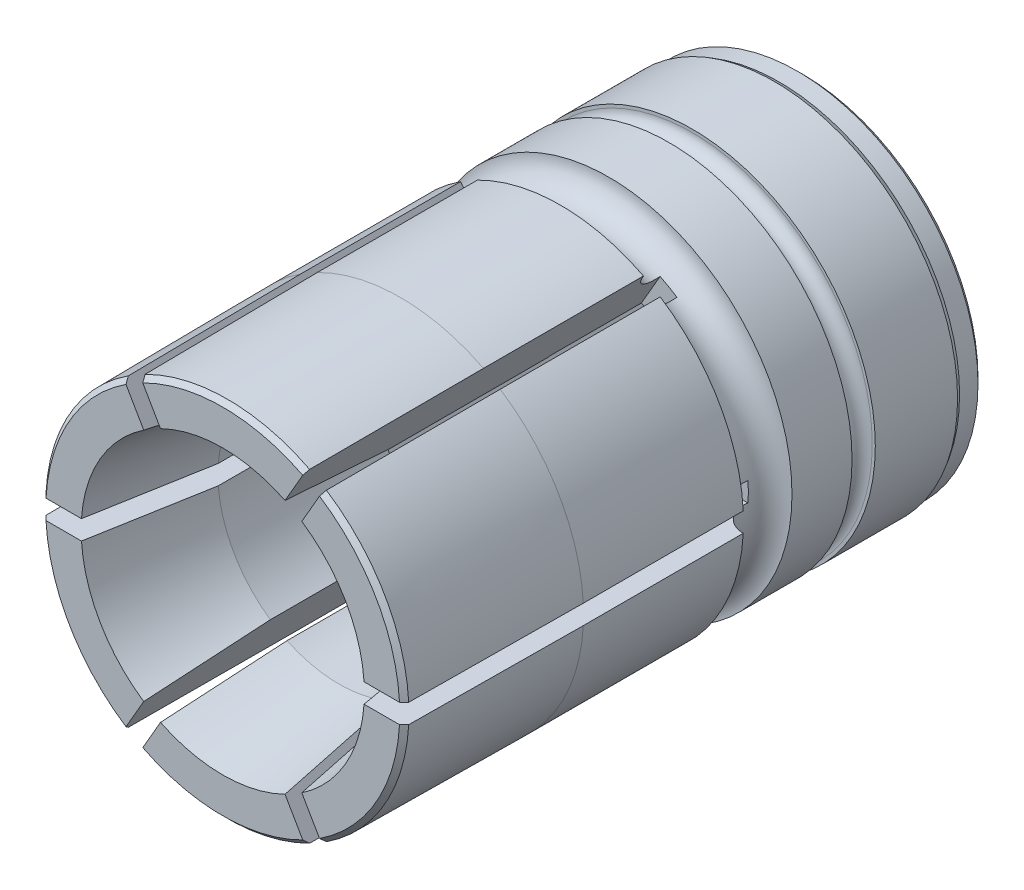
ISO-10303-21;
HEADER;
FILE_DESCRIPTION(('STEP AP214'),'2;1');
FILE_NAME('part.step','',(''),(''),'','','');
FILE_SCHEMA(('AUTOMOTIVE_DESIGN { 1 0 10303 214 1 1 1 1 }'));
ENDSEC;
DATA;
#1=APPLICATION_CONTEXT('core data for automotive mechanical design processes');
#2=APPLICATION_PROTOCOL_DEFINITION('international standard','automotive_design',2000,#1);
#3=PRODUCT_CONTEXT('',#1,'mechanical');
#4=PRODUCT('Part','Part','',(#3));
#5=PRODUCT_RELATED_PRODUCT_CATEGORY('part','',(#4));
#6=PRODUCT_DEFINITION_FORMATION('','',#4);
#7=PRODUCT_DEFINITION_CONTEXT('part definition',#1,'design');
#8=PRODUCT_DEFINITION('design','',#6,#7);
#9=PRODUCT_DEFINITION_SHAPE('','',#8);
#10=(LENGTH_UNIT() NAMED_UNIT(*) SI_UNIT(.MILLI.,.METRE.));
#11=(NAMED_UNIT(*) PLANE_ANGLE_UNIT() SI_UNIT($,.RADIAN.));
#12=(NAMED_UNIT(*) SI_UNIT($,.STERADIAN.) SOLID_ANGLE_UNIT());
#13=UNCERTAINTY_MEASURE_WITH_UNIT(LENGTH_MEASURE(1.E-05),#10,'distance_accuracy_value','');
#14=(GEOMETRIC_REPRESENTATION_CONTEXT(3) GLOBAL_UNCERTAINTY_ASSIGNED_CONTEXT((#13)) GLOBAL_UNIT_ASSIGNED_CONTEXT((#10,
#11,#12)) REPRESENTATION_CONTEXT('',''));
#15=CARTESIAN_POINT('',(0.,0.,0.));
#16=DIRECTION('',(0.,0.,1.));
#17=DIRECTION('',(1.,0.,0.));
#18=AXIS2_PLACEMENT_3D('',#15,#16,#17);
#19=CARTESIAN_POINT('',(0.,0.,19.));
#20=DIRECTION('',(0.,0.,1.));
#21=DIRECTION('',(0.,-1.,0.));
#22=AXIS2_PLACEMENT_3D('',#19,#20,#21);
#23=CYLINDRICAL_SURFACE('',#22,3.96875);
#24=CARTESIAN_POINT('',(0.,0.,10.));
#25=DIRECTION('',(0.,0.,-1.));
#26=DIRECTION('',(-1.,0.,0.));
#27=AXIS2_PLACEMENT_3D('',#24,#25,#26);
#28=CIRCLE('',#27,3.96875);
#29=CARTESIAN_POINT('',(-3.95602961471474,-0.317499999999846,10.));
#30=VERTEX_POINT('',#29);
#31=CARTESIAN_POINT('',(-2.25297787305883,-3.2672721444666,10.));
#32=VERTEX_POINT('',#31);
#33=EDGE_CURVE('E23',#30,#32,#28,.F.);
#34=ORIENTED_EDGE('',*,*,#33,.F.);
#35=DIRECTION('',(0.,0.,1.));
#36=VECTOR('',#35,1.);
#37=CARTESIAN_POINT('',(-3.95602961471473,-0.3175,19.));
#38=LINE('',#37,#36);
#39=CARTESIAN_POINT('',(-3.9560296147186,-0.3175,15.1899999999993));
#40=VERTEX_POINT('',#39);
#41=EDGE_CURVE('E557',#40,#30,#38,.F.);
#42=ORIENTED_EDGE('',*,*,#41,.F.);
#43=CARTESIAN_POINT('',(0.,0.,15.19));
#44=DIRECTION('',(0.,0.,1.));
#45=DIRECTION('',(0.,-1.,0.));
#46=AXIS2_PLACEMENT_3D('',#43,#44,#45);
#47=CIRCLE('',#46,3.96875);
#48=CARTESIAN_POINT('',(-2.25297787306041,-3.26727214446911,15.1899999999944));
#49=VERTEX_POINT('',#48);
#50=EDGE_CURVE('E568',#49,#40,#47,.F.);
#51=ORIENTED_EDGE('',*,*,#50,.F.);
#52=DIRECTION('',(0.,0.,1.));
#53=VECTOR('',#52,1.);
#54=CARTESIAN_POINT('',(-2.25297787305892,-3.26727214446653,19.));
#55=LINE('',#54,#53);
#56=EDGE_CURVE('E574',#32,#49,#55,.T.);
#57=ORIENTED_EDGE('',*,*,#56,.F.);
#58=EDGE_LOOP('',(#34,#42,#51,#57));
#59=FACE_BOUND('',#58,.T.);
#60=ADVANCED_FACE('F14',(#59),#23,.F.);
#61=CARTESIAN_POINT('',(-1.70305174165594,-3.58477214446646,10.));
#62=VERTEX_POINT('',#61);
#63=CARTESIAN_POINT('',(1.70305174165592,-3.58477214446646,10.));
#64=VERTEX_POINT('',#63);
#65=EDGE_CURVE('E1384',#62,#64,#28,.F.);
#66=ORIENTED_EDGE('',*,*,#65,.F.);
#67=DIRECTION('',(0.,0.,1.));
#68=VECTOR('',#67,1.);
#69=CARTESIAN_POINT('',(-1.7030517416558,-3.58477214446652,19.));
#70=LINE('',#69,#68);
#71=CARTESIAN_POINT('',(-1.70305174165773,-3.58477214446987,15.1899999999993));
#72=VERTEX_POINT('',#71);
#73=EDGE_CURVE('E576',#72,#62,#70,.F.);
#74=ORIENTED_EDGE('',*,*,#73,.F.);
#75=CARTESIAN_POINT('',(0.,0.,15.19));
#76=DIRECTION('',(0.,0.,1.));
#77=DIRECTION('',(0.,-1.,0.));
#78=AXIS2_PLACEMENT_3D('',#75,#76,#77);
#79=CIRCLE('',#78,3.96875);
#80=CARTESIAN_POINT('',(1.70305174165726,-3.584772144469,15.1899999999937));
#81=VERTEX_POINT('',#80);
#82=EDGE_CURVE('E478',#81,#72,#79,.F.);
#83=ORIENTED_EDGE('',*,*,#82,.F.);
#84=DIRECTION('',(0.,0.,1.));
#85=VECTOR('',#84,1.);
#86=CARTESIAN_POINT('',(1.70305174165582,-3.58477214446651,19.));
#87=LINE('',#86,#85);
#88=EDGE_CURVE('E39',#64,#81,#87,.T.);
#89=ORIENTED_EDGE('',*,*,#88,.F.);
#90=EDGE_LOOP('',(#66,#74,#83,#89));
#91=FACE_BOUND('',#90,.T.);
#92=ADVANCED_FACE('F1155',(#91),#23,.F.);
#93=CARTESIAN_POINT('',(2.25297787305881,-3.26727214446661,10.));
#94=VERTEX_POINT('',#93);
#95=CARTESIAN_POINT('',(3.95602961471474,-0.317499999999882,10.));
#96=VERTEX_POINT('',#95);
#97=EDGE_CURVE('E1386',#94,#96,#28,.F.);
#98=ORIENTED_EDGE('',*,*,#97,.F.);
#99=DIRECTION('',(0.,0.,1.));
#100=VECTOR('',#99,1.);
#101=CARTESIAN_POINT('',(2.25297787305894,-3.26727214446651,19.));
#102=LINE('',#101,#100);
#103=CARTESIAN_POINT('',(2.25297787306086,-3.26727214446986,15.1899999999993));
#104=VERTEX_POINT('',#103);
#105=EDGE_CURVE('E473',#104,#94,#102,.F.);
#106=ORIENTED_EDGE('',*,*,#105,.F.);
#107=CARTESIAN_POINT('',(0.,0.,15.19));
#108=DIRECTION('',(0.,0.,1.));
#109=DIRECTION('',(0.,-1.,0.));
#110=AXIS2_PLACEMENT_3D('',#107,#108,#109);
#111=CIRCLE('',#110,3.96875);
#112=CARTESIAN_POINT('',(3.95602961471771,-0.3175,15.1899999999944));
#113=VERTEX_POINT('',#112);
#114=EDGE_CURVE('E476',#113,#104,#111,.F.);
#115=ORIENTED_EDGE('',*,*,#114,.F.);
#116=DIRECTION('',(0.,0.,1.));
#117=VECTOR('',#116,1.);
#118=CARTESIAN_POINT('',(3.95602961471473,-0.3175,19.));
#119=LINE('',#118,#117);
#120=EDGE_CURVE('E484',#96,#113,#119,.T.);
#121=ORIENTED_EDGE('',*,*,#120,.F.);
#122=EDGE_LOOP('',(#98,#106,#115,#121));
#123=FACE_BOUND('',#122,.T.);
#124=ADVANCED_FACE('F1163',(#123),#23,.F.);
#125=CARTESIAN_POINT('',(3.95602961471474,0.317499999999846,10.));
#126=VERTEX_POINT('',#125);
#127=CARTESIAN_POINT('',(2.25297787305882,3.2672721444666,10.));
#128=VERTEX_POINT('',#127);
#129=EDGE_CURVE('E1387',#126,#128,#28,.F.);
#130=ORIENTED_EDGE('',*,*,#129,.F.);
#131=DIRECTION('',(0.,0.,1.));
#132=VECTOR('',#131,1.);
#133=CARTESIAN_POINT('',(3.95602961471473,0.3175,19.));
#134=LINE('',#133,#132);
#135=CARTESIAN_POINT('',(3.9560296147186,0.3175,15.1899999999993));
#136=VERTEX_POINT('',#135);
#137=EDGE_CURVE('E486',#136,#126,#134,.F.);
#138=ORIENTED_EDGE('',*,*,#137,.F.);
#139=CARTESIAN_POINT('',(0.,0.,15.19));
#140=DIRECTION('',(0.,0.,1.));
#141=DIRECTION('',(0.,-1.,0.));
#142=AXIS2_PLACEMENT_3D('',#139,#140,#141);
#143=CIRCLE('',#142,3.96875);
#144=CARTESIAN_POINT('',(2.25297787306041,3.26727214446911,15.1899999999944));
#145=VERTEX_POINT('',#144);
#146=EDGE_CURVE('E500',#145,#136,#143,.F.);
#147=ORIENTED_EDGE('',*,*,#146,.F.);
#148=DIRECTION('',(0.,0.,1.));
#149=VECTOR('',#148,1.);
#150=CARTESIAN_POINT('',(2.25297787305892,3.26727214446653,19.));
#151=LINE('',#150,#149);
#152=EDGE_CURVE('E507',#128,#145,#151,.T.);
#153=ORIENTED_EDGE('',*,*,#152,.F.);
#154=EDGE_LOOP('',(#130,#138,#147,#153));
#155=FACE_BOUND('',#154,.T.);
#156=ADVANCED_FACE('F1177',(#155),#23,.F.);
#157=CARTESIAN_POINT('',(1.70305174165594,3.58477214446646,10.));
#158=VERTEX_POINT('',#157);
#159=CARTESIAN_POINT('',(-1.70305174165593,3.58477214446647,10.));
#160=VERTEX_POINT('',#159);
#161=EDGE_CURVE('E1389',#158,#160,#28,.F.);
#162=ORIENTED_EDGE('',*,*,#161,.F.);
#163=DIRECTION('',(0.,0.,1.));
#164=VECTOR('',#163,1.);
#165=CARTESIAN_POINT('',(1.7030517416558,3.58477214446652,19.));
#166=LINE('',#165,#164);
#167=CARTESIAN_POINT('',(1.70305174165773,3.58477214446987,15.1899999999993));
#168=VERTEX_POINT('',#167);
#169=EDGE_CURVE('E509',#168,#158,#166,.F.);
#170=ORIENTED_EDGE('',*,*,#169,.F.);
#171=CARTESIAN_POINT('',(0.,0.,15.19));
#172=DIRECTION('',(0.,0.,1.));
#173=DIRECTION('',(0.,-1.,0.));
#174=AXIS2_PLACEMENT_3D('',#171,#172,#173);
#175=CIRCLE('',#174,3.96875);
#176=CARTESIAN_POINT('',(-1.70305174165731,3.5847721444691,15.1899999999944));
#177=VERTEX_POINT('',#176);
#178=EDGE_CURVE('E523',#177,#168,#175,.F.);
#179=ORIENTED_EDGE('',*,*,#178,.F.);
#180=DIRECTION('',(0.,0.,1.));
#181=VECTOR('',#180,1.);
#182=CARTESIAN_POINT('',(-1.70305174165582,3.58477214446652,19.));
#183=LINE('',#182,#181);
#184=EDGE_CURVE('E530',#160,#177,#183,.T.);
#185=ORIENTED_EDGE('',*,*,#184,.F.);
#186=EDGE_LOOP('',(#162,#170,#179,#185));
#187=FACE_BOUND('',#186,.T.);
#188=ADVANCED_FACE('F1168',(#187),#23,.F.);
#189=CARTESIAN_POINT('',(-2.25297787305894,3.26727214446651,10.));
#190=VERTEX_POINT('',#189);
#191=CARTESIAN_POINT('',(-3.95602961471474,0.317499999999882,10.));
#192=VERTEX_POINT('',#191);
#193=EDGE_CURVE('E429',#190,#192,#28,.F.);
#194=ORIENTED_EDGE('',*,*,#193,.F.);
#195=DIRECTION('',(0.,0.,1.));
#196=VECTOR('',#195,1.);
#197=CARTESIAN_POINT('',(-2.25297787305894,3.26727214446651,19.));
#198=LINE('',#197,#196);
#199=CARTESIAN_POINT('',(-2.25297787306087,3.26727214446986,15.1899999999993));
#200=VERTEX_POINT('',#199);
#201=EDGE_CURVE('E534',#200,#190,#198,.F.);
#202=ORIENTED_EDGE('',*,*,#201,.F.);
#203=CARTESIAN_POINT('',(0.,0.,15.19));
#204=DIRECTION('',(0.,0.,1.));
#205=DIRECTION('',(0.,-1.,0.));
#206=AXIS2_PLACEMENT_3D('',#203,#204,#205);
#207=CIRCLE('',#206,3.96875);
#208=CARTESIAN_POINT('',(-3.95602961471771,0.3175,15.1899999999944));
#209=VERTEX_POINT('',#208);
#210=EDGE_CURVE('E548',#209,#200,#207,.F.);
#211=ORIENTED_EDGE('',*,*,#210,.F.);
#212=DIRECTION('',(0.,0.,1.));
#213=VECTOR('',#212,1.);
#214=CARTESIAN_POINT('',(-3.95602961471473,0.3175,19.));
#215=LINE('',#214,#213);
#216=EDGE_CURVE('E555',#192,#209,#215,.T.);
#217=ORIENTED_EDGE('',*,*,#216,.F.);
#218=EDGE_LOOP('',(#194,#202,#211,#217));
#219=FACE_BOUND('',#218,.T.);
#220=ADVANCED_FACE('F1158',(#219),#23,.F.);
#221=CARTESIAN_POINT('',(0.,-6.9,3.619));
#222=DIRECTION('',(0.,0.,1.));
#223=DIRECTION('',(1.,0.,0.));
#224=AXIS2_PLACEMENT_3D('',#221,#222,#223);
#225=PLANE('',#224);
#226=CARTESIAN_POINT('',(0.,0.,3.619));
#227=DIRECTION('',(0.,0.,1.));
#228=DIRECTION('',(1.,0.,0.));
#229=AXIS2_PLACEMENT_3D('',#226,#227,#228);
#230=CIRCLE('',#229,5.9);
#231=CARTESIAN_POINT('',(-5.9,0.,3.619));
#232=VERTEX_POINT('',#231);
#233=CARTESIAN_POINT('',(5.9,0.,3.619));
#234=VERTEX_POINT('',#233);
#235=EDGE_CURVE('E313',#232,#234,#230,.F.);
#236=ORIENTED_EDGE('',*,*,#235,.T.);
#237=CARTESIAN_POINT('',(0.,0.,3.619));
#238=DIRECTION('',(0.,0.,1.));
#239=DIRECTION('',(-1.,0.,0.));
#240=AXIS2_PLACEMENT_3D('',#237,#238,#239);
#241=CIRCLE('',#240,5.9);
#242=EDGE_CURVE('E317',#234,#232,#241,.F.);
#243=ORIENTED_EDGE('',*,*,#242,.T.);
#244=EDGE_LOOP('',(#236,#243));
#245=FACE_BOUND('',#244,.T.);
#246=CARTESIAN_POINT('',(0.,0.,3.619));
#247=DIRECTION('',(0.,0.,1.));
#248=DIRECTION('',(1.,0.,0.));
#249=AXIS2_PLACEMENT_3D('',#246,#247,#248);
#250=CIRCLE('',#249,6.);
#251=CARTESIAN_POINT('',(6.,0.,3.619));
#252=VERTEX_POINT('',#251);
#253=EDGE_CURVE('E1241',#252,#252,#250,.F.);
#254=ORIENTED_EDGE('',*,*,#253,.F.);
#255=EDGE_LOOP('',(#254));
#256=FACE_BOUND('',#255,.T.);
#257=ADVANCED_FACE('F16',(#245,#256),#225,.T.);
#258=CARTESIAN_POINT('',(0.,0.,4.));
#259=DIRECTION('',(0.,0.,-1.));
#260=DIRECTION('',(-1.,0.,0.));
#261=AXIS2_PLACEMENT_3D('',#258,#259,#260);
#262=TOROIDAL_SURFACE('',#261,5.9,0.381);
#263=ORIENTED_EDGE('',*,*,#242,.F.);
#264=ORIENTED_EDGE('',*,*,#235,.F.);
#265=EDGE_LOOP('',(#263,#264));
#266=FACE_BOUND('',#265,.T.);
#267=CARTESIAN_POINT('',(0.,0.,4.381));
#268=DIRECTION('',(0.,0.,-1.));
#269=DIRECTION('',(1.,0.,0.));
#270=AXIS2_PLACEMENT_3D('',#267,#268,#269);
#271=CIRCLE('',#270,5.9);
#272=CARTESIAN_POINT('',(-5.9,0.,4.381));
#273=VERTEX_POINT('',#272);
#274=CARTESIAN_POINT('',(5.9,0.,4.381));
#275=VERTEX_POINT('',#274);
#276=EDGE_CURVE('E1269',#273,#275,#271,.F.);
#277=ORIENTED_EDGE('',*,*,#276,.F.);
#278=CARTESIAN_POINT('',(0.,0.,4.381));
#279=DIRECTION('',(0.,0.,-1.));
#280=DIRECTION('',(-1.,0.,0.));
#281=AXIS2_PLACEMENT_3D('',#278,#279,#280);
#282=CIRCLE('',#281,5.9);
#283=EDGE_CURVE('E303',#275,#273,#282,.F.);
#284=ORIENTED_EDGE('',*,*,#283,.F.);
#285=EDGE_LOOP('',(#277,#284));
#286=FACE_BOUND('',#285,.T.);
#287=ADVANCED_FACE('F1176',(#266,#286),#262,.F.);
#288=CARTESIAN_POINT('',(0.,0.,0.));
#289=DIRECTION('',(0.,0.,1.));
#290=DIRECTION('',(1.,0.,0.));
#291=AXIS2_PLACEMENT_3D('',#288,#289,#290);
#292=CYLINDRICAL_SURFACE('',#291,6.);
#293=ORIENTED_EDGE('',*,*,#253,.T.);
#294=EDGE_LOOP('',(#293));
#295=FACE_BOUND('',#294,.T.);
#296=CARTESIAN_POINT('',(0.,0.,0.923205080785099));
#297=DIRECTION('',(0.,0.,1.));
#298=DIRECTION('',(1.,0.,0.));
#299=AXIS2_PLACEMENT_3D('',#296,#297,#298);
#300=CIRCLE('',#299,5.99999999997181);
#301=CARTESIAN_POINT('',(5.99999999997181,0.,0.923205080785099));
#302=VERTEX_POINT('',#301);
#303=EDGE_CURVE('E1240',#302,#302,#300,.F.);
#304=ORIENTED_EDGE('',*,*,#303,.F.);
#305=EDGE_LOOP('',(#304));
#306=FACE_BOUND('',#305,.T.);
#307=ADVANCED_FACE('F1259',(#295,#306),#292,.T.);
#308=CARTESIAN_POINT('',(0.,-6.9,4.381));
#309=DIRECTION('',(0.,0.,-1.));
#310=DIRECTION('',(-1.,0.,0.));
#311=AXIS2_PLACEMENT_3D('',#308,#309,#310);
#312=PLANE('',#311);
#313=ORIENTED_EDGE('',*,*,#283,.T.);
#314=ORIENTED_EDGE('',*,*,#276,.T.);
#315=EDGE_LOOP('',(#313,#314));
#316=FACE_BOUND('',#315,.T.);
#317=CARTESIAN_POINT('',(0.,0.,4.381));
#318=DIRECTION('',(0.,0.,1.));
#319=DIRECTION('',(1.,0.,0.));
#320=AXIS2_PLACEMENT_3D('',#317,#318,#319);
#321=CIRCLE('',#320,6.);
#322=CARTESIAN_POINT('',(6.,0.,4.381));
#323=VERTEX_POINT('',#322);
#324=EDGE_CURVE('E1237',#323,#323,#321,.T.);
#325=ORIENTED_EDGE('',*,*,#324,.F.);
#326=EDGE_LOOP('',(#325));
#327=FACE_BOUND('',#326,.T.);
#328=ADVANCED_FACE('F1300',(#316,#327),#312,.T.);
#329=CARTESIAN_POINT('',(0.,0.,0.923205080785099));
#330=DIRECTION('',(0.,0.,1.));
#331=DIRECTION('',(1.,0.,0.));
#332=AXIS2_PLACEMENT_3D('',#329,#330,#331);
#333=CONICAL_SURFACE('',#332,5.99999999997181,0.523598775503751);
#334=ORIENTED_EDGE('',*,*,#303,.T.);
#335=EDGE_LOOP('',(#334));
#336=FACE_BOUND('',#335,.T.);
#337=CARTESIAN_POINT('',(0.,0.,0.769225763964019));
#338=DIRECTION('',(0.,0.,-1.));
#339=DIRECTION('',(-1.,0.,0.));
#340=AXIS2_PLACEMENT_3D('',#337,#338,#339);
#341=CIRCLE('',#340,5.9111);
#342=CARTESIAN_POINT('',(-5.9111,0.,0.769225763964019));
#343=VERTEX_POINT('',#342);
#344=EDGE_CURVE('E1236',#343,#343,#341,.T.);
#345=ORIENTED_EDGE('',*,*,#344,.F.);
#346=EDGE_LOOP('',(#345));
#347=FACE_BOUND('',#346,.T.);
#348=ADVANCED_FACE('F1296',(#336,#347),#333,.T.);
#349=CARTESIAN_POINT('',(0.,0.,0.));
#350=DIRECTION('',(0.,0.,1.));
#351=DIRECTION('',(1.,0.,0.));
#352=AXIS2_PLACEMENT_3D('',#349,#350,#351);
#353=CYLINDRICAL_SURFACE('',#352,6.);
#354=ORIENTED_EDGE('',*,*,#324,.T.);
#355=EDGE_LOOP('',(#354));
#356=FACE_BOUND('',#355,.T.);
#357=CARTESIAN_POINT('',(0.,0.,6.349125));
#358=DIRECTION('',(0.,0.,-1.));
#359=DIRECTION('',(-1.,0.,0.));
#360=AXIS2_PLACEMENT_3D('',#357,#358,#359);
#361=CIRCLE('',#360,6.);
#362=CARTESIAN_POINT('',(-6.,0.,6.349125));
#363=VERTEX_POINT('',#362);
#364=EDGE_CURVE('E1224',#363,#363,#361,.T.);
#365=ORIENTED_EDGE('',*,*,#364,.T.);
#366=EDGE_LOOP('',(#365));
#367=FACE_BOUND('',#366,.T.);
#368=ADVANCED_FACE('F1312',(#356,#367),#353,.T.);
#369=CARTESIAN_POINT('',(0.,0.,0.75));
#370=DIRECTION('',(0.,0.,-1.));
#371=DIRECTION('',(-1.,0.,0.));
#372=AXIS2_PLACEMENT_3D('',#369,#370,#371);
#373=CYLINDRICAL_SURFACE('',#372,5.9111);
#374=CARTESIAN_POINT('',(0.,0.,0.16510000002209));
#375=DIRECTION('',(0.,0.,1.));
#376=DIRECTION('',(1.,0.,0.));
#377=AXIS2_PLACEMENT_3D('',#374,#375,#376);
#378=CIRCLE('',#377,5.91109999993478);
#379=CARTESIAN_POINT('',(5.91109999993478,0.,0.16510000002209));
#380=VERTEX_POINT('',#379);
#381=EDGE_CURVE('E679',#380,#380,#378,.F.);
#382=ORIENTED_EDGE('',*,*,#381,.F.);
#383=EDGE_LOOP('',(#382));
#384=FACE_BOUND('',#383,.T.);
#385=ORIENTED_EDGE('',*,*,#344,.T.);
#386=EDGE_LOOP('',(#385));
#387=FACE_BOUND('',#386,.T.);
#388=ADVANCED_FACE('F1334',(#384,#387),#373,.T.);
#389=CARTESIAN_POINT('',(0.,0.,0.165099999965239));
#390=DIRECTION('',(0.,0.,1.));
#391=DIRECTION('',(1.,0.,0.));
#392=AXIS2_PLACEMENT_3D('',#389,#390,#391);
#393=CONICAL_SURFACE('',#392,5.91109999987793,0.785398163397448);
#394=ORIENTED_EDGE('',*,*,#381,.T.);
#395=EDGE_LOOP('',(#394));
#396=FACE_BOUND('',#395,.T.);
#397=CARTESIAN_POINT('',(0.,0.,7.51195980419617E-11));
#398=DIRECTION('',(0.,0.,1.));
#399=DIRECTION('',(1.,0.,0.));
#400=AXIS2_PLACEMENT_3D('',#397,#398,#399);
#401=CIRCLE('',#400,5.74599999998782);
#402=CARTESIAN_POINT('',(5.74599999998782,0.,7.51195980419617E-11));
#403=VERTEX_POINT('',#402);
#404=EDGE_CURVE('E1354',#403,#403,#401,.F.);
#405=ORIENTED_EDGE('',*,*,#404,.F.);
#406=EDGE_LOOP('',(#405));
#407=FACE_BOUND('',#406,.T.);
#408=ADVANCED_FACE('F1340',(#396,#407),#393,.T.);
#409=CARTESIAN_POINT('',(0.,0.,18.8494864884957));
#410=DIRECTION('',(0.,0.,-1.));
#411=DIRECTION('',(0.,1.,0.));
#412=AXIS2_PLACEMENT_3D('',#409,#410,#411);
#413=CONICAL_SURFACE('',#412,5.95051351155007,0.785398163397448);
#414=CARTESIAN_POINT('',(-3.24598161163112,-4.98720507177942,18.849486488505));
#415=CARTESIAN_POINT('',(-3.233420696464,-4.96544892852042,18.8745725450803));
#416=CARTESIAN_POINT('',(-3.22085966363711,-4.9436925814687,18.8996583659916));
#417=CARTESIAN_POINT('',(-3.19573736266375,-4.9001794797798,18.9498295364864));
#418=CARTESIAN_POINT('',(-3.18317609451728,-4.87842272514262,18.9749148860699));
#419=CARTESIAN_POINT('',(-3.17061470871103,-4.85666576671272,18.9999999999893));
#420=B_SPLINE_CURVE_WITH_KNOTS('',3,(#414,#415,#416,#417,#418,#419),.UNSPECIFIED.,.F.,.F.,(4,2,
4),(0.,0.106507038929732,0.213014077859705),.UNSPECIFIED.);
#421=CARTESIAN_POINT('',(-3.24598161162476,-4.98720507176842,18.8494864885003));
#422=VERTEX_POINT('',#421);
#423=CARTESIAN_POINT('',(-3.17061470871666,-4.85666576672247,18.9999999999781));
#424=VERTEX_POINT('',#423);
#425=EDGE_CURVE('E999',#422,#424,#420,.T.);
#426=ORIENTED_EDGE('',*,*,#425,.T.);
#427=CARTESIAN_POINT('',(0.,0.,18.9999999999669));
#428=DIRECTION('',(0.,0.,-1.));
#429=DIRECTION('',(0.,1.,0.));
#430=AXIS2_PLACEMENT_3D('',#427,#428,#429);
#431=CIRCLE('',#430,5.80000000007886);
#432=CARTESIAN_POINT('',(-5.79130328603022,-0.3175,18.9999999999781));
#433=VERTEX_POINT('',#432);
#434=EDGE_CURVE('E669',#424,#433,#431,.T.);
#435=ORIENTED_EDGE('',*,*,#434,.T.);
#436=CARTESIAN_POINT('',(-5.79130328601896,-0.3175,18.9999999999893));
#437=CARTESIAN_POINT('',(-5.81642605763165,-0.3175,18.9749148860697));
#438=CARTESIAN_POINT('',(-5.84154859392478,-0.3175,18.949829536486));
#439=CARTESIAN_POINT('',(-5.89179319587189,-0.3175,18.8996583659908));
#440=CARTESIAN_POINT('',(-5.91691526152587,-0.3175,18.8745725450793));
#441=CARTESIAN_POINT('',(-5.94203709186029,-0.3175,18.8494864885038));
#442=B_SPLINE_CURVE_WITH_KNOTS('',3,(#436,#437,#438,#439,#440,#441),.UNSPECIFIED.,.F.,.F.,(4,2,
4),(0.,0.106507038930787,0.213014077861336),.UNSPECIFIED.);
#443=CARTESIAN_POINT('',(-5.942037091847,-0.3175,18.8494864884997));
#444=VERTEX_POINT('',#443);
#445=EDGE_CURVE('E1003',#433,#444,#442,.T.);
#446=ORIENTED_EDGE('',*,*,#445,.T.);
#447=CARTESIAN_POINT('',(0.,0.,18.8494864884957));
#448=DIRECTION('',(0.,0.,-1.));
#449=DIRECTION('',(1.,0.,0.));
#450=AXIS2_PLACEMENT_3D('',#447,#448,#449);
#451=CIRCLE('',#450,5.95051351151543);
#452=EDGE_CURVE('E663',#422,#444,#451,.T.);
#453=ORIENTED_EDGE('',*,*,#452,.F.);
#454=EDGE_LOOP('',(#426,#435,#446,#453));
#455=FACE_BOUND('',#454,.T.);
#456=ADVANCED_FACE('F1018',(#455),#413,.T.);
#457=CARTESIAN_POINT('',(0.,0.,18.8494864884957));
#458=DIRECTION('',(0.,0.,-1.));
#459=DIRECTION('',(0.,1.,0.));
#460=AXIS2_PLACEMENT_3D('',#457,#458,#459);
#461=CONICAL_SURFACE('',#460,5.95051351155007,0.785398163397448);
#462=CARTESIAN_POINT('',(-5.94203709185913,0.3175,18.849486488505));
#463=CARTESIAN_POINT('',(-5.9169152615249,0.3175,18.8745725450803));
#464=CARTESIAN_POINT('',(-5.89179319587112,0.3175,18.8996583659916));
#465=CARTESIAN_POINT('',(-5.8415485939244,0.3175,18.9498295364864));
#466=CARTESIAN_POINT('',(-5.81642605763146,0.3175,18.9749148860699));
#467=CARTESIAN_POINT('',(-5.79130328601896,0.3175,18.9999999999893));
#468=B_SPLINE_CURVE_WITH_KNOTS('',3,(#462,#463,#464,#465,#466,#467),.UNSPECIFIED.,.F.,.F.,(4,2,
4),(0.,0.106507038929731,0.213014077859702),.UNSPECIFIED.);
#469=CARTESIAN_POINT('',(-5.94203709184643,0.317499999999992,18.8494864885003));
#470=VERTEX_POINT('',#469);
#471=CARTESIAN_POINT('',(-5.79130328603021,0.3175,18.9999999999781));
#472=VERTEX_POINT('',#471);
#473=EDGE_CURVE('E986',#470,#472,#468,.T.);
#474=ORIENTED_EDGE('',*,*,#473,.T.);
#475=CARTESIAN_POINT('',(0.,0.,18.9999999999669));
#476=DIRECTION('',(0.,0.,-1.));
#477=DIRECTION('',(0.,1.,0.));
#478=AXIS2_PLACEMENT_3D('',#475,#476,#477);
#479=CIRCLE('',#478,5.80000000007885);
#480=CARTESIAN_POINT('',(-3.17061470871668,4.85666576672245,18.9999999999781));
#481=VERTEX_POINT('',#480);
#482=EDGE_CURVE('E655',#472,#481,#479,.T.);
#483=ORIENTED_EDGE('',*,*,#482,.T.);
#484=CARTESIAN_POINT('',(-3.17061470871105,4.85666576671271,18.9999999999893));
#485=CARTESIAN_POINT('',(-3.18317609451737,4.87842272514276,18.9749148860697));
#486=CARTESIAN_POINT('',(-3.19573736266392,4.90017947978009,18.9498295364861));
#487=CARTESIAN_POINT('',(-3.22085966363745,4.94369258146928,18.8996583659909));
#488=CARTESIAN_POINT('',(-3.23342069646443,4.96544892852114,18.8745725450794));
#489=CARTESIAN_POINT('',(-3.24598161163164,4.98720507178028,18.849486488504));
#490=B_SPLINE_CURVE_WITH_KNOTS('',3,(#484,#485,#486,#487,#488,#489),.UNSPECIFIED.,.F.,.F.,(4,2,
4),(0.,0.10650703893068,0.21301407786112),.UNSPECIFIED.);
#491=CARTESIAN_POINT('',(-3.24598161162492,4.98720507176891,18.8494864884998));
#492=VERTEX_POINT('',#491);
#493=EDGE_CURVE('E958',#481,#492,#490,.T.);
#494=ORIENTED_EDGE('',*,*,#493,.T.);
#495=CARTESIAN_POINT('',(0.,0.,18.8494864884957));
#496=DIRECTION('',(0.,0.,-1.));
#497=DIRECTION('',(1.,0.,0.));
#498=AXIS2_PLACEMENT_3D('',#495,#496,#497);
#499=CIRCLE('',#498,5.95051351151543);
#500=EDGE_CURVE('E647',#470,#492,#499,.T.);
#501=ORIENTED_EDGE('',*,*,#500,.F.);
#502=EDGE_LOOP('',(#474,#483,#494,#501));
#503=FACE_BOUND('',#502,.T.);
#504=ADVANCED_FACE('F884',(#503),#461,.T.);
#505=CARTESIAN_POINT('',(0.,0.,18.8494864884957));
#506=DIRECTION('',(0.,0.,-1.));
#507=DIRECTION('',(0.,1.,0.));
#508=AXIS2_PLACEMENT_3D('',#505,#506,#507);
#509=CONICAL_SURFACE('',#508,5.95051351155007,0.785398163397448);
#510=CARTESIAN_POINT('',(-2.69605548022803,5.30470507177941,18.849486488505));
#511=CARTESIAN_POINT('',(-2.68349456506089,5.28294892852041,18.8745725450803));
#512=CARTESIAN_POINT('',(-2.67093353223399,5.2611925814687,18.8996583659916));
#513=CARTESIAN_POINT('',(-2.64581123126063,5.2176794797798,18.9498295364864));
#514=CARTESIAN_POINT('',(-2.63324996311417,5.19592272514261,18.9749148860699));
#515=CARTESIAN_POINT('',(-2.62068857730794,5.17416576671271,18.9999999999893));
#516=B_SPLINE_CURVE_WITH_KNOTS('',3,(#510,#511,#512,#513,#514,#515),.UNSPECIFIED.,.F.,.F.,(4,2,
4),(0.,0.106507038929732,0.213014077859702),.UNSPECIFIED.);
#517=CARTESIAN_POINT('',(-2.69605548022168,5.30470507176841,18.8494864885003));
#518=VERTEX_POINT('',#517);
#519=CARTESIAN_POINT('',(-2.62068857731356,5.17416576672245,18.9999999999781));
#520=VERTEX_POINT('',#519);
#521=EDGE_CURVE('E889',#518,#520,#516,.T.);
#522=ORIENTED_EDGE('',*,*,#521,.T.);
#523=CARTESIAN_POINT('',(0.,0.,18.9999999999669));
#524=DIRECTION('',(0.,0.,-1.));
#525=DIRECTION('',(0.,1.,0.));
#526=AXIS2_PLACEMENT_3D('',#523,#524,#525);
#527=CIRCLE('',#526,5.80000000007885);
#528=CARTESIAN_POINT('',(2.62068857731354,5.17416576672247,18.9999999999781));
#529=VERTEX_POINT('',#528);
#530=EDGE_CURVE('E643',#520,#529,#527,.T.);
#531=ORIENTED_EDGE('',*,*,#530,.T.);
#532=CARTESIAN_POINT('',(2.62068857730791,5.17416576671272,18.9999999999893));
#533=CARTESIAN_POINT('',(2.63324996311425,5.19592272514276,18.9749148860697));
#534=CARTESIAN_POINT('',(2.64581123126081,5.21767947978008,18.9498295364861));
#535=CARTESIAN_POINT('',(2.67093353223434,5.26119258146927,18.8996583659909));
#536=CARTESIAN_POINT('',(2.68349456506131,5.28294892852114,18.8745725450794));
#537=CARTESIAN_POINT('',(2.6960554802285,5.30470507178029,18.849486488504));
#538=B_SPLINE_CURVE_WITH_KNOTS('',3,(#532,#533,#534,#535,#536,#537),.UNSPECIFIED.,.F.,.F.,(4,2,
4),(0.,0.106507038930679,0.213014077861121),.UNSPECIFIED.);
#539=CARTESIAN_POINT('',(2.69605548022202,5.30470507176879,18.8494864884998));
#540=VERTEX_POINT('',#539);
#541=EDGE_CURVE('E894',#529,#540,#538,.T.);
#542=ORIENTED_EDGE('',*,*,#541,.T.);
#543=CARTESIAN_POINT('',(0.,0.,18.8494864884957));
#544=DIRECTION('',(0.,0.,-1.));
#545=DIRECTION('',(1.,0.,0.));
#546=AXIS2_PLACEMENT_3D('',#543,#544,#545);
#547=CIRCLE('',#546,5.95051351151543);
#548=EDGE_CURVE('E635',#518,#540,#547,.T.);
#549=ORIENTED_EDGE('',*,*,#548,.F.);
#550=EDGE_LOOP('',(#522,#531,#542,#549));
#551=FACE_BOUND('',#550,.T.);
#552=ADVANCED_FACE('F878',(#551),#509,.T.);
#553=CARTESIAN_POINT('',(0.,0.,18.8494864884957));
#554=DIRECTION('',(0.,0.,-1.));
#555=DIRECTION('',(0.,1.,0.));
#556=AXIS2_PLACEMENT_3D('',#553,#554,#555);
#557=CONICAL_SURFACE('',#556,5.95051351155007,0.785398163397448);
#558=CARTESIAN_POINT('',(3.24598161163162,4.98720507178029,18.849486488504));
#559=CARTESIAN_POINT('',(3.23342069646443,4.96544892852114,18.8745725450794));
#560=CARTESIAN_POINT('',(3.22085966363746,4.94369258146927,18.8996583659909));
#561=CARTESIAN_POINT('',(3.19573736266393,4.90017947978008,18.9498295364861));
#562=CARTESIAN_POINT('',(3.18317609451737,4.87842272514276,18.9749148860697));
#563=CARTESIAN_POINT('',(3.17061470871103,4.85666576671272,18.9999999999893));
#564=B_SPLINE_CURVE_WITH_KNOTS('',3,(#558,#559,#560,#561,#562,#563),.UNSPECIFIED.,.F.,.F.,(4,2,
4),(0.,0.106507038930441,0.213014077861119),.UNSPECIFIED.);
#565=CARTESIAN_POINT('',(3.24598161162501,4.98720507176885,18.8494864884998));
#566=VERTEX_POINT('',#565);
#567=CARTESIAN_POINT('',(3.17061470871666,4.85666576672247,18.9999999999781));
#568=VERTEX_POINT('',#567);
#569=EDGE_CURVE('E856',#566,#568,#564,.T.);
#570=ORIENTED_EDGE('',*,*,#569,.T.);
#571=CARTESIAN_POINT('',(0.,0.,18.9999999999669));
#572=DIRECTION('',(0.,0.,-1.));
#573=DIRECTION('',(0.,1.,0.));
#574=AXIS2_PLACEMENT_3D('',#571,#572,#573);
#575=CIRCLE('',#574,5.80000000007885);
#576=CARTESIAN_POINT('',(5.79130328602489,0.3175,18.9999999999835));
#577=VERTEX_POINT('',#576);
#578=EDGE_CURVE('E628',#568,#577,#575,.T.);
#579=ORIENTED_EDGE('',*,*,#578,.T.);
#580=CARTESIAN_POINT('',(5.79130328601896,0.3175,18.9999999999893));
#581=CARTESIAN_POINT('',(5.81642605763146,0.3175,18.9749148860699));
#582=CARTESIAN_POINT('',(5.8415485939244,0.3175,18.9498295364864));
#583=CARTESIAN_POINT('',(5.89179319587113,0.3175,18.8996583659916));
#584=CARTESIAN_POINT('',(5.91691526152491,0.3175,18.8745725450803));
#585=CARTESIAN_POINT('',(5.94203709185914,0.3175,18.849486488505));
#586=B_SPLINE_CURVE_WITH_KNOTS('',3,(#580,#581,#582,#583,#584,#585),.UNSPECIFIED.,.F.,.F.,(4,2,
4),(0.,0.106507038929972,0.213014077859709),.UNSPECIFIED.);
#587=CARTESIAN_POINT('',(5.94203709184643,0.317499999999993,18.8494864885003));
#588=VERTEX_POINT('',#587);
#589=EDGE_CURVE('E865',#577,#588,#586,.T.);
#590=ORIENTED_EDGE('',*,*,#589,.T.);
#591=CARTESIAN_POINT('',(0.,0.,18.8494864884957));
#592=DIRECTION('',(0.,0.,-1.));
#593=DIRECTION('',(1.,0.,0.));
#594=AXIS2_PLACEMENT_3D('',#591,#592,#593);
#595=CIRCLE('',#594,5.95051351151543);
#596=EDGE_CURVE('E622',#566,#588,#595,.T.);
#597=ORIENTED_EDGE('',*,*,#596,.F.);
#598=EDGE_LOOP('',(#570,#579,#590,#597));
#599=FACE_BOUND('',#598,.T.);
#600=ADVANCED_FACE('F874',(#599),#557,.T.);
#601=CARTESIAN_POINT('',(0.,0.,18.8494864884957));
#602=DIRECTION('',(0.,0.,-1.));
#603=DIRECTION('',(0.,1.,0.));
#604=AXIS2_PLACEMENT_3D('',#601,#602,#603);
#605=CONICAL_SURFACE('',#604,5.95051351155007,0.785398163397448);
#606=CARTESIAN_POINT('',(5.94203709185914,-0.3175,18.849486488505));
#607=CARTESIAN_POINT('',(5.91691526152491,-0.3175,18.8745725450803));
#608=CARTESIAN_POINT('',(5.89179319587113,-0.3175,18.8996583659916));
#609=CARTESIAN_POINT('',(5.8415485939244,-0.3175,18.9498295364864));
#610=CARTESIAN_POINT('',(5.81642605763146,-0.3175,18.9749148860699));
#611=CARTESIAN_POINT('',(5.79130328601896,-0.3175,18.9999999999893));
#612=B_SPLINE_CURVE_WITH_KNOTS('',3,(#606,#607,#608,#609,#610,#611),.UNSPECIFIED.,.F.,.F.,(4,2,
4),(0.,0.106507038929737,0.213014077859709),.UNSPECIFIED.);
#613=CARTESIAN_POINT('',(5.94203709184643,-0.3175,18.8494864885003));
#614=VERTEX_POINT('',#613);
#615=CARTESIAN_POINT('',(5.79130328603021,-0.3175,18.9999999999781));
#616=VERTEX_POINT('',#615);
#617=EDGE_CURVE('E855',#614,#616,#612,.T.);
#618=ORIENTED_EDGE('',*,*,#617,.T.);
#619=CARTESIAN_POINT('',(0.,0.,18.9999999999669));
#620=DIRECTION('',(0.,0.,-1.));
#621=DIRECTION('',(0.,1.,0.));
#622=AXIS2_PLACEMENT_3D('',#619,#620,#621);
#623=CIRCLE('',#622,5.80000000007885);
#624=CARTESIAN_POINT('',(3.17061470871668,-4.85666576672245,18.9999999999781));
#625=VERTEX_POINT('',#624);
#626=EDGE_CURVE('E618',#616,#625,#623,.T.);
#627=ORIENTED_EDGE('',*,*,#626,.T.);
#628=CARTESIAN_POINT('',(3.17061470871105,-4.85666576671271,18.9999999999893));
#629=CARTESIAN_POINT('',(3.1831760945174,-4.87842272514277,18.9749148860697));
#630=CARTESIAN_POINT('',(3.19573736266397,-4.90017947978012,18.949829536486));
#631=CARTESIAN_POINT('',(3.22085966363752,-4.94369258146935,18.8996583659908));
#632=CARTESIAN_POINT('',(3.23342069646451,-4.96544892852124,18.8745725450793));
#633=CARTESIAN_POINT('',(3.24598161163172,-4.98720507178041,18.8494864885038));
#634=B_SPLINE_CURVE_WITH_KNOTS('',3,(#628,#629,#630,#631,#632,#633),.UNSPECIFIED.,.F.,.F.,(4,2,
4),(0.,0.106507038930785,0.213014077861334),.UNSPECIFIED.);
#635=CARTESIAN_POINT('',(3.24598161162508,-4.9872050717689,18.8494864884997));
#636=VERTEX_POINT('',#635);
#637=EDGE_CURVE('E848',#625,#636,#634,.T.);
#638=ORIENTED_EDGE('',*,*,#637,.T.);
#639=CARTESIAN_POINT('',(0.,0.,18.8494864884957));
#640=DIRECTION('',(0.,0.,-1.));
#641=DIRECTION('',(1.,0.,0.));
#642=AXIS2_PLACEMENT_3D('',#639,#640,#641);
#643=CIRCLE('',#642,5.95051351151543);
#644=EDGE_CURVE('E612',#614,#636,#643,.T.);
#645=ORIENTED_EDGE('',*,*,#644,.F.);
#646=EDGE_LOOP('',(#618,#627,#638,#645));
#647=FACE_BOUND('',#646,.T.);
#648=ADVANCED_FACE('F688',(#647),#605,.T.);
#649=CARTESIAN_POINT('',(0.,0.,7.142875));
#650=DIRECTION('',(0.,0.,-1.));
#651=DIRECTION('',(-1.,0.,0.));
#652=AXIS2_PLACEMENT_3D('',#649,#650,#651);
#653=TOROIDAL_SURFACE('',#652,6.,0.79375);
#654=ORIENTED_EDGE('',*,*,#364,.F.);
#655=EDGE_LOOP('',(#654));
#656=FACE_BOUND('',#655,.T.);
#657=CARTESIAN_POINT('',(2.72083372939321,-5.34762225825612,7.936625));
#658=CARTESIAN_POINT('',(2.69844698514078,-5.30884727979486,7.93666265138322));
#659=CARTESIAN_POINT('',(2.67606584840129,-5.27008201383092,7.93284950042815));
#660=CARTESIAN_POINT('',(2.63195127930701,-5.1936733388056,7.91780025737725));
#661=CARTESIAN_POINT('',(2.61021741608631,-5.1560291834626,7.90656922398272));
#662=CARTESIAN_POINT('',(2.56799148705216,-5.08289172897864,7.87695502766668));
#663=CARTESIAN_POINT('',(2.54750002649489,-5.04739947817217,7.85856841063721));
#664=CARTESIAN_POINT('',(2.50835700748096,-4.97960178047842,7.81517983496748));
#665=CARTESIAN_POINT('',(2.48970499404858,-4.94729554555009,7.79017951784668));
#666=CARTESIAN_POINT('',(2.45477300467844,-4.88679156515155,7.73427357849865));
#667=CARTESIAN_POINT('',(2.43849221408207,-4.85859240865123,7.70336999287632));
#668=CARTESIAN_POINT('',(2.40876019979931,-4.80709504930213,7.63652955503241));
#669=CARTESIAN_POINT('',(2.39530898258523,-4.78379685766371,7.60059269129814));
#670=CARTESIAN_POINT('',(2.37163421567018,-4.74279095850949,7.52473403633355));
#671=CARTESIAN_POINT('',(2.36140750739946,-4.7250777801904,7.48481619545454));
#672=CARTESIAN_POINT('',(2.34446524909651,-4.69573292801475,7.40217501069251));
#673=CARTESIAN_POINT('',(2.33774626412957,-4.68409530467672,7.35945445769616));
#674=CARTESIAN_POINT('',(2.32653490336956,-4.6646766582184,7.25914146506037));
#675=CARTESIAN_POINT('',(2.32332134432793,-4.65911061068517,7.20094287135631));
#676=CARTESIAN_POINT('',(2.32331490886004,-4.6590994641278,7.11890917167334));
#677=CARTESIAN_POINT('',(2.32385964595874,-4.66004297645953,7.09496561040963));
#678=CARTESIAN_POINT('',(2.32602925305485,-4.66380084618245,7.04729010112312));
#679=CARTESIAN_POINT('',(2.3276534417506,-4.66661402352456,7.02355802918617));
#680=CARTESIAN_POINT('',(2.32981116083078,-4.6703513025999,7.));
#681=B_SPLINE_CURVE_WITH_KNOTS('',3,(#657,#658,#659,#660,#661,#662,#663,#664,#665,#666,#667,
#668,#669,#670,#671,#672,#673,#674,#675,#676,#677,#678,#679,#680),.UNSPECIFIED.,.F.,.F.,(4,2,2,
2,2,2,2,2,2,2,2,4),(0.,0.134142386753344,0.268193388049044,0.402309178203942,0.536391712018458,
0.67042807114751,0.804464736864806,0.938369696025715,1.07214328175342,1.24617974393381,
1.31800824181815,1.38979144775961),.UNSPECIFIED.);
#682=CARTESIAN_POINT('',(2.72083372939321,-5.34762225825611,7.936625));
#683=VERTEX_POINT('',#682);
#684=CARTESIAN_POINT('',(2.32981116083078,-4.6703513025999,7.));
#685=VERTEX_POINT('',#684);
#686=EDGE_CURVE('E697',#683,#685,#681,.T.);
#687=ORIENTED_EDGE('',*,*,#686,.F.);
#688=CARTESIAN_POINT('',(0.,0.,7.936625));
#689=DIRECTION('',(0.,0.,1.));
#690=DIRECTION('',(1.,0.,0.));
#691=AXIS2_PLACEMENT_3D('',#688,#689,#690);
#692=CIRCLE('',#691,6.);
#693=CARTESIAN_POINT('',(-2.72083372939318,-5.34762225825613,7.936625));
#694=VERTEX_POINT('',#693);
#695=EDGE_CURVE('E603',#694,#683,#692,.T.);
#696=ORIENTED_EDGE('',*,*,#695,.F.);
#697=CARTESIAN_POINT('',(-2.32981116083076,-4.67035130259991,7.));
#698=CARTESIAN_POINT('',(-2.32765341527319,-4.66661397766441,7.0235372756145));
#699=CARTESIAN_POINT('',(-2.32603049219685,-4.66380299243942,7.04725909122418));
#700=CARTESIAN_POINT('',(-2.32386091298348,-4.66004517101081,7.09494151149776));
#701=CARTESIAN_POINT('',(-2.32331618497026,-4.6591016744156,7.11890246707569));
#702=CARTESIAN_POINT('',(-2.32331791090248,-4.65910466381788,7.18740556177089));
#703=CARTESIAN_POINT('',(-2.3252007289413,-4.66236580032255,7.23197607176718));
#704=CARTESIAN_POINT('',(-2.33268362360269,-4.67532655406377,7.31986657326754));
#705=CARTESIAN_POINT('',(-2.33828671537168,-4.68503139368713,7.36318552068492));
#706=CARTESIAN_POINT('',(-2.35304100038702,-4.71058656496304,7.44727699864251));
#707=CARTESIAN_POINT('',(-2.36218758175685,-4.72642890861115,7.48805275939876));
#708=CARTESIAN_POINT('',(-2.38378652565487,-4.76383937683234,7.56602667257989));
#709=CARTESIAN_POINT('',(-2.39624449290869,-4.78541720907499,7.60321861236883));
#710=CARTESIAN_POINT('',(-2.42411519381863,-4.83369067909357,7.6729278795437));
#711=CARTESIAN_POINT('',(-2.43953055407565,-4.86039086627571,7.7054410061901));
#712=CARTESIAN_POINT('',(-2.47284181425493,-4.91808766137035,7.76478529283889));
#713=CARTESIAN_POINT('',(-2.49073351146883,-4.94907698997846,7.7916258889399));
#714=CARTESIAN_POINT('',(-2.52856105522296,-5.01459621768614,7.83900704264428));
#715=CARTESIAN_POINT('',(-2.54850247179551,-5.0491357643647,7.85952979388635));
#716=CARTESIAN_POINT('',(-2.58982126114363,-5.1207020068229,7.89358929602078));
#717=CARTESIAN_POINT('',(-2.611197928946,-5.15772748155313,7.9071294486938));
#718=CARTESIAN_POINT('',(-2.64739122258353,-5.22041610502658,7.92351487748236));
#719=CARTESIAN_POINT('',(-2.66198221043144,-5.24568843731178,7.92842829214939));
#720=CARTESIAN_POINT('',(-2.69132469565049,-5.29651111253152,7.93498284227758));
#721=CARTESIAN_POINT('',(-2.70607592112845,-5.32206098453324,7.93662884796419));
#722=CARTESIAN_POINT('',(-2.72083372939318,-5.34762225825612,7.936625));
#723=B_SPLINE_CURVE_WITH_KNOTS('',3,(#697,#698,#699,#700,#701,#702,#703,#704,#705,#706,#707,
#708,#709,#710,#711,#712,#713,#714,#715,#716,#717,#718,#719,#720,#721,#722),.UNSPECIFIED.,.F.,
.F.,(4,2,2,2,2,2,2,2,2,2,2,2,4),(0.,0.0717417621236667,0.143611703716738,0.277114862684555,
0.41072635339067,0.544164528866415,0.677830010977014,0.811614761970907,0.945175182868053,
1.07910865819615,1.21297682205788,1.30158438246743,1.39005976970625),.UNSPECIFIED.);
#724=CARTESIAN_POINT('',(-2.32981116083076,-4.67035130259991,7.));
#725=VERTEX_POINT('',#724);
#726=EDGE_CURVE('E792',#725,#694,#723,.T.);
#727=ORIENTED_EDGE('',*,*,#726,.F.);
#728=CARTESIAN_POINT('',(0.,0.,7.));
#729=DIRECTION('',(0.,0.,-1.));
#730=DIRECTION('',(-1.,0.,0.));
#731=AXIS2_PLACEMENT_3D('',#728,#729,#730);
#732=CIRCLE('',#731,5.21921462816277);
#733=CARTESIAN_POINT('',(-2.87973729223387,-4.35285130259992,7.));
#734=VERTEX_POINT('',#733);
#735=EDGE_CURVE('E1222',#734,#725,#732,.F.);
#736=ORIENTED_EDGE('',*,*,#735,.F.);
#737=CARTESIAN_POINT('',(-3.2707598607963,-5.03012225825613,7.936625));
#738=CARTESIAN_POINT('',(-3.24837311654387,-4.99134727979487,7.93666265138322));
#739=CARTESIAN_POINT('',(-3.22599197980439,-4.95258201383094,7.93284950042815));
#740=CARTESIAN_POINT('',(-3.1818774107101,-4.87617333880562,7.91780025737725));
#741=CARTESIAN_POINT('',(-3.16014354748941,-4.83852918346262,7.90656922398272));
#742=CARTESIAN_POINT('',(-3.11791761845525,-4.76539172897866,7.87695502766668));
#743=CARTESIAN_POINT('',(-3.09742615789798,-4.72989947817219,7.85856841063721));
#744=CARTESIAN_POINT('',(-3.05828313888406,-4.66210178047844,7.81517983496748));
#745=CARTESIAN_POINT('',(-3.03963112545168,-4.6297955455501,7.79017951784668));
#746=CARTESIAN_POINT('',(-3.00469913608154,-4.56929156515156,7.73427357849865));
#747=CARTESIAN_POINT('',(-2.98841834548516,-4.54109240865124,7.70336999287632));
#748=CARTESIAN_POINT('',(-2.9586863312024,-4.48959504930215,7.63652955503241));
#749=CARTESIAN_POINT('',(-2.94523511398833,-4.46629685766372,7.60059269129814));
#750=CARTESIAN_POINT('',(-2.92156034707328,-4.4252909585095,7.52473403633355));
#751=CARTESIAN_POINT('',(-2.91133363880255,-4.40757778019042,7.48481619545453));
#752=CARTESIAN_POINT('',(-2.89439138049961,-4.37823292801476,7.40217501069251));
#753=CARTESIAN_POINT('',(-2.88767239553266,-4.36659530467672,7.35945445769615));
#754=CARTESIAN_POINT('',(-2.87646103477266,-4.34717665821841,7.25914146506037));
#755=CARTESIAN_POINT('',(-2.87324747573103,-4.34161061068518,7.20094287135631));
#756=CARTESIAN_POINT('',(-2.87324104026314,-4.34159946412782,7.11890917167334));
#757=CARTESIAN_POINT('',(-2.87378577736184,-4.34254297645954,7.09496561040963));
#758=CARTESIAN_POINT('',(-2.87595538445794,-4.34630084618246,7.04729010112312));
#759=CARTESIAN_POINT('',(-2.87757957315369,-4.34911402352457,7.02355802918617));
#760=CARTESIAN_POINT('',(-2.87973729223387,-4.35285130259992,7.));
#761=B_SPLINE_CURVE_WITH_KNOTS('',3,(#737,#738,#739,#740,#741,#742,#743,#744,#745,#746,#747,
#748,#749,#750,#751,#752,#753,#754,#755,#756,#757,#758,#759,#760),.UNSPECIFIED.,.F.,.F.,(4,2,2,
2,2,2,2,2,2,2,2,4),(0.,0.134142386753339,0.268193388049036,0.402309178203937,0.536391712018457,
0.670428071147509,0.804464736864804,0.938369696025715,1.07214328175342,1.2461797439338,
1.31800824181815,1.38979144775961),.UNSPECIFIED.);
#762=CARTESIAN_POINT('',(-3.2707598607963,-5.03012225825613,7.936625));
#763=VERTEX_POINT('',#762);
#764=EDGE_CURVE('E770',#763,#734,#761,.T.);
#765=ORIENTED_EDGE('',*,*,#764,.F.);
#766=CARTESIAN_POINT('',(0.,0.,7.936625));
#767=DIRECTION('',(0.,0.,1.));
#768=DIRECTION('',(1.,0.,0.));
#769=AXIS2_PLACEMENT_3D('',#766,#767,#768);
#770=CIRCLE('',#769,6.);
#771=CARTESIAN_POINT('',(-5.99159359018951,-0.3175,7.936625));
#772=VERTEX_POINT('',#771);
#773=EDGE_CURVE('E659',#772,#763,#770,.T.);
#774=ORIENTED_EDGE('',*,*,#773,.F.);
#775=CARTESIAN_POINT('',(-5.20954845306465,-0.3175,7.));
#776=CARTESIAN_POINT('',(-5.20523296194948,-0.3175,7.02353727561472));
#777=CARTESIAN_POINT('',(-5.20198711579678,-0.3175,7.04725909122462));
#778=CARTESIAN_POINT('',(-5.19764795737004,-0.3175,7.09494151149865));
#779=CARTESIAN_POINT('',(-5.19655850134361,-0.3175,7.11890246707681));
#780=CARTESIAN_POINT('',(-5.19656195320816,-0.3175,7.18740556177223));
#781=CARTESIAN_POINT('',(-5.2003275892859,-0.317499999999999,7.23197607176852));
#782=CARTESIAN_POINT('',(-5.21529337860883,-0.317500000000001,7.31986657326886));
#783=CARTESIAN_POINT('',(-5.22649956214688,-0.317500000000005,7.36318552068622));
#784=CARTESIAN_POINT('',(-5.2560081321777,-0.317500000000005,7.44727699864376));
#785=CARTESIAN_POINT('',(-5.27430129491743,-0.317500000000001,7.48805275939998));
#786=CARTESIAN_POINT('',(-5.31749918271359,-0.317499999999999,7.56602667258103));
#787=CARTESIAN_POINT('',(-5.3424151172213,-0.3175,7.60321861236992));
#788=CARTESIAN_POINT('',(-5.3981565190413,-0.3175,7.6729278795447));
#789=CARTESIAN_POINT('',(-5.4289872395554,-0.3175,7.70544100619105));
#790=CARTESIAN_POINT('',(-5.49560975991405,-0.3175,7.76478529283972));
#791=CARTESIAN_POINT('',(-5.53139315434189,-0.3175,7.79162588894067));
#792=CARTESIAN_POINT('',(-5.60704824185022,-0.3175,7.83900704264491));
#793=CARTESIAN_POINT('',(-5.64693107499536,-0.3175,7.85952979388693));
#794=CARTESIAN_POINT('',(-5.72956865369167,-0.3175,7.89358929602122));
#795=CARTESIAN_POINT('',(-5.77232198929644,-0.3175,7.90712944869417));
#796=CARTESIAN_POINT('',(-5.8447085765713,-0.3175,7.92351487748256));
#797=CARTESIAN_POINT('',(-5.87389055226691,-0.3175,7.92842829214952));
#798=CARTESIAN_POINT('',(-5.93257552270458,-0.3175,7.93498284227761));
#799=CARTESIAN_POINT('',(-5.96207797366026,-0.3175,7.93662884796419));
#800=CARTESIAN_POINT('',(-5.9915935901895,-0.3175,7.936625));
#801=B_SPLINE_CURVE_WITH_KNOTS('',3,(#775,#776,#777,#778,#779,#780,#781,#782,#783,#784,#785,
#786,#787,#788,#789,#790,#791,#792,#793,#794,#795,#796,#797,#798,#799,#800),.UNSPECIFIED.,.F.,
.F.,(4,2,2,2,2,2,2,2,2,2,2,2,4),(0.,0.0717417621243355,0.143611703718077,0.277114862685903,
0.410726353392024,0.544164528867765,0.677830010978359,0.811614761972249,0.945175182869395,
1.07910865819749,1.21297682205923,1.30158438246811,1.39005976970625),.UNSPECIFIED.);
#802=CARTESIAN_POINT('',(-5.20954845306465,-0.3175,7.));
#803=VERTEX_POINT('',#802);
#804=EDGE_CURVE('E762',#803,#772,#801,.T.);
#805=ORIENTED_EDGE('',*,*,#804,.F.);
#806=CARTESIAN_POINT('',(0.,0.,7.));
#807=DIRECTION('',(0.,0.,-1.));
#808=DIRECTION('',(-1.,0.,0.));
#809=AXIS2_PLACEMENT_3D('',#806,#807,#808);
#810=CIRCLE('',#809,5.21921462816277);
#811=CARTESIAN_POINT('',(-5.20954845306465,0.3175,7.));
#812=VERTEX_POINT('',#811);
#813=EDGE_CURVE('E295',#812,#803,#810,.F.);
#814=ORIENTED_EDGE('',*,*,#813,.F.);
#815=CARTESIAN_POINT('',(-5.99159359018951,0.3175,7.936625));
#816=CARTESIAN_POINT('',(-5.94682010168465,0.3175,7.93666265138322));
#817=CARTESIAN_POINT('',(-5.90205782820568,0.3175,7.93284950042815));
#818=CARTESIAN_POINT('',(-5.8138286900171,0.3175,7.91780025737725));
#819=CARTESIAN_POINT('',(-5.77036096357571,0.3175,7.90656922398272));
#820=CARTESIAN_POINT('',(-5.68590910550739,0.3175,7.87695502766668));
#821=CARTESIAN_POINT('',(-5.64492618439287,0.3175,7.85856841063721));
#822=CARTESIAN_POINT('',(-5.56664014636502,0.3175,7.81517983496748));
#823=CARTESIAN_POINT('',(-5.52933611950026,0.3175,7.79017951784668));
#824=CARTESIAN_POINT('',(-5.45947214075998,0.3175,7.73427357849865));
#825=CARTESIAN_POINT('',(-5.42691055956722,0.3175,7.70336999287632));
#826=CARTESIAN_POINT('',(-5.36744653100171,0.3175,7.63652955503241));
#827=CARTESIAN_POINT('',(-5.34054409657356,0.3175,7.60059269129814));
#828=CARTESIAN_POINT('',(-5.29319456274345,0.3175,7.52473403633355));
#829=CARTESIAN_POINT('',(-5.272741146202,0.3175,7.48481619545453));
#830=CARTESIAN_POINT('',(-5.23885662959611,0.3175,7.40217501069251));
#831=CARTESIAN_POINT('',(-5.22541865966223,0.3175,7.35945445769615));
#832=CARTESIAN_POINT('',(-5.20299593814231,0.3175,7.25914146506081));
#833=CARTESIAN_POINT('',(-5.19656882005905,0.3175,7.2009428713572));
#834=CARTESIAN_POINT('',(-5.19655594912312,0.3175,7.11890917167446));
#835=CARTESIAN_POINT('',(-5.19764542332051,0.3175,7.09496561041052));
#836=CARTESIAN_POINT('',(-5.20198463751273,0.3175,7.04729010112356));
#837=CARTESIAN_POINT('',(-5.20523301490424,0.3175,7.02355802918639));
#838=CARTESIAN_POINT('',(-5.20954845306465,0.3175,7.));
#839=B_SPLINE_CURVE_WITH_KNOTS('',3,(#815,#816,#817,#818,#819,#820,#821,#822,#823,#824,#825,
#826,#827,#828,#829,#830,#831,#832,#833,#834,#835,#836,#837,#838),.UNSPECIFIED.,.F.,.F.,(4,2,2,
2,2,2,2,2,2,2,2,4),(0.,0.13414238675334,0.268193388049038,0.402309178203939,0.536391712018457,
0.670428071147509,0.804464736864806,0.938369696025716,1.07214328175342,1.24617974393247,
1.31800824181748,1.38979144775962),.UNSPECIFIED.);
#840=CARTESIAN_POINT('',(-5.99159359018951,0.3175,7.936625));
#841=VERTEX_POINT('',#840);
#842=EDGE_CURVE('E717',#841,#812,#839,.T.);
#843=ORIENTED_EDGE('',*,*,#842,.F.);
#844=CARTESIAN_POINT('',(0.,0.,7.936625));
#845=DIRECTION('',(0.,0.,1.));
#846=DIRECTION('',(1.,0.,0.));
#847=AXIS2_PLACEMENT_3D('',#844,#845,#846);
#848=CIRCLE('',#847,6.);
#849=CARTESIAN_POINT('',(-3.27075986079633,5.03012225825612,7.936625));
#850=VERTEX_POINT('',#849);
#851=EDGE_CURVE('E650',#850,#841,#848,.T.);
#852=ORIENTED_EDGE('',*,*,#851,.F.);
#853=CARTESIAN_POINT('',(-2.87973729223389,4.3528513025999,7.));
#854=CARTESIAN_POINT('',(-2.87757954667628,4.34911397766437,7.02353727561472));
#855=CARTESIAN_POINT('',(-2.87595662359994,4.34630299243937,7.04725909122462));
#856=CARTESIAN_POINT('',(-2.87378704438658,4.34254517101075,7.09494151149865));
#857=CARTESIAN_POINT('',(-2.87324231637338,4.34160167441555,7.11890246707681));
#858=CARTESIAN_POINT('',(-2.87324404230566,4.34160466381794,7.18740556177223));
#859=CARTESIAN_POINT('',(-2.8751268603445,4.34486580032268,7.23197607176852));
#860=CARTESIAN_POINT('',(-2.88260975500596,4.35782655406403,7.31986657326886));
#861=CARTESIAN_POINT('',(-2.88821284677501,4.36753139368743,7.36318552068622));
#862=CARTESIAN_POINT('',(-2.90296713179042,4.39308656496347,7.44727699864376));
#863=CARTESIAN_POINT('',(-2.91211371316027,4.40892890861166,7.48805275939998));
#864=CARTESIAN_POINT('',(-2.93371265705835,4.44633937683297,7.56602667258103));
#865=CARTESIAN_POINT('',(-2.94617062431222,4.46791720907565,7.60321861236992));
#866=CARTESIAN_POINT('',(-2.97404132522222,4.51619067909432,7.6729278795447));
#867=CARTESIAN_POINT('',(-2.98945668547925,4.54289086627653,7.70544100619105));
#868=CARTESIAN_POINT('',(-3.02276794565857,4.60058766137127,7.76478529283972));
#869=CARTESIAN_POINT('',(-3.04065964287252,4.6315769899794,7.79162588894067));
#870=CARTESIAN_POINT('',(-3.07848718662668,4.69709621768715,7.83900704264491));
#871=CARTESIAN_POINT('',(-3.09842860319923,4.73163576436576,7.85952979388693));
#872=CARTESIAN_POINT('',(-3.13974739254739,4.80320200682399,7.89358929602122));
#873=CARTESIAN_POINT('',(-3.1611240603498,4.84022748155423,7.90712944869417));
#874=CARTESIAN_POINT('',(-3.19731735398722,4.90291610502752,7.92351487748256));
#875=CARTESIAN_POINT('',(-3.21190834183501,4.92818843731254,7.92842829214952));
#876=CARTESIAN_POINT('',(-3.24125082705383,4.97901111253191,7.93498284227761));
#877=CARTESIAN_POINT('',(-3.25600205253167,5.00456098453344,7.93662884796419));
#878=CARTESIAN_POINT('',(-3.27075986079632,5.0301222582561,7.936625));
#879=B_SPLINE_CURVE_WITH_KNOTS('',3,(#853,#854,#855,#856,#857,#858,#859,#860,#861,#862,#863,
#864,#865,#866,#867,#868,#869,#870,#871,#872,#873,#874,#875,#876,#877,#878),.UNSPECIFIED.,.F.,
.F.,(4,2,2,2,2,2,2,2,2,2,2,2,4),(0.,0.0717417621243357,0.143611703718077,0.277114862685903,
0.410726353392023,0.544164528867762,0.677830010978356,0.811614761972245,0.945175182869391,
1.07910865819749,1.21297682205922,1.3015843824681,1.39005976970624),.UNSPECIFIED.);
#880=CARTESIAN_POINT('',(-2.8797372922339,4.3528513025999,7.));
#881=VERTEX_POINT('',#880);
#882=EDGE_CURVE('E708',#881,#850,#879,.T.);
#883=ORIENTED_EDGE('',*,*,#882,.F.);
#884=CARTESIAN_POINT('',(0.,0.,7.));
#885=DIRECTION('',(0.,0.,-1.));
#886=DIRECTION('',(-1.,0.,0.));
#887=AXIS2_PLACEMENT_3D('',#884,#885,#886);
#888=CIRCLE('',#887,5.21921462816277);
#889=CARTESIAN_POINT('',(-2.32981116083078,4.6703513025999,7.));
#890=VERTEX_POINT('',#889);
#891=EDGE_CURVE('E1230',#890,#881,#888,.F.);
#892=ORIENTED_EDGE('',*,*,#891,.F.);
#893=CARTESIAN_POINT('',(-2.72083372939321,5.34762225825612,7.936625));
#894=CARTESIAN_POINT('',(-2.69844698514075,5.30884727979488,7.93666265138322));
#895=CARTESIAN_POINT('',(-2.67606584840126,5.27008201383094,7.93284950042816));
#896=CARTESIAN_POINT('',(-2.63195127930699,5.19367333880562,7.91780025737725));
#897=CARTESIAN_POINT('',(-2.61021741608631,5.15602918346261,7.90656922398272));
#898=CARTESIAN_POINT('',(-2.56799148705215,5.08289172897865,7.87695502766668));
#899=CARTESIAN_POINT('',(-2.54750002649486,5.04739947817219,7.85856841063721));
#900=CARTESIAN_POINT('',(-2.50835700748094,4.97960178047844,7.81517983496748));
#901=CARTESIAN_POINT('',(-2.48970499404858,4.94729554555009,7.79017951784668));
#902=CARTESIAN_POINT('',(-2.45477300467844,4.88679156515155,7.73427357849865));
#903=CARTESIAN_POINT('',(-2.43849221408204,4.85859240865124,7.70336999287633));
#904=CARTESIAN_POINT('',(-2.40876019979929,4.80709504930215,7.63652955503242));
#905=CARTESIAN_POINT('',(-2.39530898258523,4.78379685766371,7.60059269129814));
#906=CARTESIAN_POINT('',(-2.37163421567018,4.74279095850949,7.52473403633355));
#907=CARTESIAN_POINT('',(-2.36140750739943,4.72507778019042,7.48481619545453));
#908=CARTESIAN_POINT('',(-2.34446524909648,4.69573292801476,7.40217501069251));
#909=CARTESIAN_POINT('',(-2.33774626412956,4.68409530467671,7.35945445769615));
#910=CARTESIAN_POINT('',(-2.32653490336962,4.66467665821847,7.25914146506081));
#911=CARTESIAN_POINT('',(-2.32332134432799,4.65911061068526,7.2009428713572));
#912=CARTESIAN_POINT('',(-2.32331490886,4.65909946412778,7.11890917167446));
#913=CARTESIAN_POINT('',(-2.32385964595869,4.66004297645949,7.09496561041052));
#914=CARTESIAN_POINT('',(-2.32602925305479,4.66380084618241,7.04729010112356));
#915=CARTESIAN_POINT('',(-2.32765344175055,4.66661402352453,7.02355802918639));
#916=CARTESIAN_POINT('',(-2.32981116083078,4.6703513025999,7.));
#917=B_SPLINE_CURVE_WITH_KNOTS('',3,(#893,#894,#895,#896,#897,#898,#899,#900,#901,#902,#903,
#904,#905,#906,#907,#908,#909,#910,#911,#912,#913,#914,#915,#916),.UNSPECIFIED.,.F.,.F.,(4,2,2,
2,2,2,2,2,2,2,2,4),(0.,0.134142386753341,0.268193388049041,0.402309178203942,0.53639171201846,
0.670428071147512,0.804464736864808,0.938369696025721,1.07214328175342,1.24617974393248,
1.31800824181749,1.38979144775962),.UNSPECIFIED.);
#918=CARTESIAN_POINT('',(-2.72083372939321,5.34762225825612,7.936625));
#919=VERTEX_POINT('',#918);
#920=EDGE_CURVE('E735',#919,#890,#917,.T.);
#921=ORIENTED_EDGE('',*,*,#920,.F.);
#922=CARTESIAN_POINT('',(0.,0.,7.936625));
#923=DIRECTION('',(0.,0.,1.));
#924=DIRECTION('',(1.,0.,0.));
#925=AXIS2_PLACEMENT_3D('',#922,#923,#924);
#926=CIRCLE('',#925,6.);
#927=CARTESIAN_POINT('',(2.72083372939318,5.34762225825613,7.936625));
#928=VERTEX_POINT('',#927);
#929=EDGE_CURVE('E638',#928,#919,#926,.T.);
#930=ORIENTED_EDGE('',*,*,#929,.F.);
#931=CARTESIAN_POINT('',(2.32981116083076,4.67035130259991,7.));
#932=CARTESIAN_POINT('',(2.32765341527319,4.66661397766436,7.02353727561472));
#933=CARTESIAN_POINT('',(2.32603049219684,4.66380299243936,7.04725909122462));
#934=CARTESIAN_POINT('',(2.32386091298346,4.66004517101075,7.09494151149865));
#935=CARTESIAN_POINT('',(2.32331618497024,4.65910167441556,7.11890246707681));
#936=CARTESIAN_POINT('',(2.32331791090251,4.65910466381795,7.18740556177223));
#937=CARTESIAN_POINT('',(2.32520072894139,4.66236580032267,7.23197607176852));
#938=CARTESIAN_POINT('',(2.33268362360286,4.67532655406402,7.31986657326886));
#939=CARTESIAN_POINT('',(2.33828671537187,4.68503139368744,7.36318552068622));
#940=CARTESIAN_POINT('',(2.35304100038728,4.71058656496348,7.44727699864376));
#941=CARTESIAN_POINT('',(2.36218758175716,4.72642890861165,7.48805275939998));
#942=CARTESIAN_POINT('',(2.38378652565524,4.76383937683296,7.56602667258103));
#943=CARTESIAN_POINT('',(2.39624449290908,4.78541720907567,7.60321861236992));
#944=CARTESIAN_POINT('',(2.42411519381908,4.83369067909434,7.6729278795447));
#945=CARTESIAN_POINT('',(2.43953055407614,4.86039086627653,7.70544100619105));
#946=CARTESIAN_POINT('',(2.47284181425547,4.91808766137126,7.76478529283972));
#947=CARTESIAN_POINT('',(2.49073351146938,4.94907698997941,7.79162588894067));
#948=CARTESIAN_POINT('',(2.52856105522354,5.01459621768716,7.83900704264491));
#949=CARTESIAN_POINT('',(2.54850247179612,5.04913576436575,7.85952979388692));
#950=CARTESIAN_POINT('',(2.58982126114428,5.12070200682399,7.89358929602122));
#951=CARTESIAN_POINT('',(2.61119792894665,5.15772748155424,7.90712944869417));
#952=CARTESIAN_POINT('',(2.64739122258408,5.22041610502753,7.92351487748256));
#953=CARTESIAN_POINT('',(2.66198221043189,5.24568843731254,7.92842829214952));
#954=CARTESIAN_POINT('',(2.69132469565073,5.2965111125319,7.93498284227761));
#955=CARTESIAN_POINT('',(2.70607592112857,5.32206098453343,7.93662884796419));
#956=CARTESIAN_POINT('',(2.72083372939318,5.34762225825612,7.936625));
#957=B_SPLINE_CURVE_WITH_KNOTS('',3,(#931,#932,#933,#934,#935,#936,#937,#938,#939,#940,#941,
#942,#943,#944,#945,#946,#947,#948,#949,#950,#951,#952,#953,#954,#955,#956),.UNSPECIFIED.,.F.,
.F.,(4,2,2,2,2,2,2,2,2,2,2,2,4),(0.,0.0717417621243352,0.143611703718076,0.277114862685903,
0.410726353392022,0.544164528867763,0.677830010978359,0.811614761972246,0.945175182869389,
1.07910865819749,1.21297682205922,1.3015843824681,1.39005976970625),.UNSPECIFIED.);
#958=CARTESIAN_POINT('',(2.32981116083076,4.67035130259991,7.));
#959=VERTEX_POINT('',#958);
#960=EDGE_CURVE('E726',#959,#928,#957,.T.);
#961=ORIENTED_EDGE('',*,*,#960,.F.);
#962=CARTESIAN_POINT('',(0.,0.,7.));
#963=DIRECTION('',(0.,0.,-1.));
#964=DIRECTION('',(-1.,0.,0.));
#965=AXIS2_PLACEMENT_3D('',#962,#963,#964);
#966=CIRCLE('',#965,5.21921462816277);
#967=CARTESIAN_POINT('',(2.87973729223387,4.35285130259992,7.));
#968=VERTEX_POINT('',#967);
#969=EDGE_CURVE('E1233',#968,#959,#966,.F.);
#970=ORIENTED_EDGE('',*,*,#969,.F.);
#971=CARTESIAN_POINT('',(3.27075986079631,5.03012225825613,7.936625));
#972=CARTESIAN_POINT('',(3.2483731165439,4.99134727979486,7.93666265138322));
#973=CARTESIAN_POINT('',(3.22599197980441,4.95258201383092,7.93284950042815));
#974=CARTESIAN_POINT('',(3.18187741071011,4.87617333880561,7.91780025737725));
#975=CARTESIAN_POINT('',(3.1601435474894,4.83852918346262,7.90656922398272));
#976=CARTESIAN_POINT('',(3.11791761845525,4.76539172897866,7.87695502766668));
#977=CARTESIAN_POINT('',(3.097426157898,4.72989947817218,7.85856841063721));
#978=CARTESIAN_POINT('',(3.05828313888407,4.66210178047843,7.81517983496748));
#979=CARTESIAN_POINT('',(3.03963112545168,4.6297955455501,7.79017951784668));
#980=CARTESIAN_POINT('',(3.00469913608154,4.56929156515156,7.73427357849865));
#981=CARTESIAN_POINT('',(2.98841834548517,4.54109240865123,7.70336999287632));
#982=CARTESIAN_POINT('',(2.95868633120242,4.48959504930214,7.63652955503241));
#983=CARTESIAN_POINT('',(2.94523511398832,4.46629685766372,7.60059269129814));
#984=CARTESIAN_POINT('',(2.92156034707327,4.4252909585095,7.52473403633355));
#985=CARTESIAN_POINT('',(2.91133363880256,4.40757778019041,7.48481619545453));
#986=CARTESIAN_POINT('',(2.89439138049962,4.37823292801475,7.40217501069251));
#987=CARTESIAN_POINT('',(2.88767239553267,4.36659530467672,7.35945445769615));
#988=CARTESIAN_POINT('',(2.8764610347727,4.34717665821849,7.25914146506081));
#989=CARTESIAN_POINT('',(2.87324747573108,4.34161061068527,7.2009428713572));
#990=CARTESIAN_POINT('',(2.87324104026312,4.34159946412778,7.11890917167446));
#991=CARTESIAN_POINT('',(2.87378577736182,4.34254297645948,7.09496561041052));
#992=CARTESIAN_POINT('',(2.87595538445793,4.3463008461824,7.04729010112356));
#993=CARTESIAN_POINT('',(2.87757957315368,4.34911402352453,7.02355802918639));
#994=CARTESIAN_POINT('',(2.87973729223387,4.35285130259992,7.));
#995=B_SPLINE_CURVE_WITH_KNOTS('',3,(#971,#972,#973,#974,#975,#976,#977,#978,#979,#980,#981,
#982,#983,#984,#985,#986,#987,#988,#989,#990,#991,#992,#993,#994),.UNSPECIFIED.,.F.,.F.,(4,2,2,
2,2,2,2,2,2,2,2,4),(0.,0.134142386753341,0.268193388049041,0.402309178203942,0.53639171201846,
0.670428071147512,0.804464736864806,0.938369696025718,1.07214328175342,1.24617974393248,
1.31800824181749,1.38979144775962),.UNSPECIFIED.);
#996=CARTESIAN_POINT('',(3.2707598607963,5.03012225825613,7.936625));
#997=VERTEX_POINT('',#996);
#998=EDGE_CURVE('E753',#997,#968,#995,.T.);
#999=ORIENTED_EDGE('',*,*,#998,.F.);
#1000=CARTESIAN_POINT('',(0.,0.,7.936625));
#1001=DIRECTION('',(0.,0.,1.));
#1002=DIRECTION('',(1.,0.,0.));
#1003=AXIS2_PLACEMENT_3D('',#1000,#1001,#1002);
#1004=CIRCLE('',#1003,6.);
#1005=CARTESIAN_POINT('',(5.99159359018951,0.3175,7.936625));
#1006=VERTEX_POINT('',#1005);
#1007=EDGE_CURVE('E623',#1006,#997,#1004,.T.);
#1008=ORIENTED_EDGE('',*,*,#1007,.F.);
#1009=CARTESIAN_POINT('',(5.20954845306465,0.3175,7.));
#1010=CARTESIAN_POINT('',(5.20523296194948,0.3175,7.02353727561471));
#1011=CARTESIAN_POINT('',(5.20198711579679,0.3175,7.04725909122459));
#1012=CARTESIAN_POINT('',(5.19764795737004,0.3175,7.0949415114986));
#1013=CARTESIAN_POINT('',(5.19655850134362,0.3175,7.11890246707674));
#1014=CARTESIAN_POINT('',(5.19656195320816,0.3175,7.18740556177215));
#1015=CARTESIAN_POINT('',(5.20032758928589,0.3175,7.23197607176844));
#1016=CARTESIAN_POINT('',(5.21529337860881,0.3175,7.31986657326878));
#1017=CARTESIAN_POINT('',(5.22649956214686,0.3175,7.36318552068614));
#1018=CARTESIAN_POINT('',(5.25600813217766,0.3175,7.44727699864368));
#1019=CARTESIAN_POINT('',(5.27430129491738,0.3175,7.4880527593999));
#1020=CARTESIAN_POINT('',(5.31749918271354,0.3175,7.56602667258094));
#1021=CARTESIAN_POINT('',(5.34241511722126,0.3175,7.60321861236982));
#1022=CARTESIAN_POINT('',(5.39815651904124,0.3175,7.67292787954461));
#1023=CARTESIAN_POINT('',(5.42898723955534,0.3175,7.70544100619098));
#1024=CARTESIAN_POINT('',(5.49560975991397,0.3175,7.76478529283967));
#1025=CARTESIAN_POINT('',(5.53139315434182,0.3175,7.79162588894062));
#1026=CARTESIAN_POINT('',(5.60704824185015,0.3175,7.83900704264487));
#1027=CARTESIAN_POINT('',(5.64693107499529,0.3175,7.85952979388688));
#1028=CARTESIAN_POINT('',(5.7295686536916,0.3175,7.8935892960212));
#1029=CARTESIAN_POINT('',(5.77232198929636,0.3175,7.90712944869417));
#1030=CARTESIAN_POINT('',(5.84470857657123,0.3175,7.92351487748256));
#1031=CARTESIAN_POINT('',(5.87389055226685,0.3175,7.92842829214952));
#1032=CARTESIAN_POINT('',(5.93257552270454,0.3175,7.9349828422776));
#1033=CARTESIAN_POINT('',(5.96207797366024,0.3175,7.93662884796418));
#1034=CARTESIAN_POINT('',(5.99159359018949,0.3175,7.936625));
#1035=B_SPLINE_CURVE_WITH_KNOTS('',3,(#1009,#1010,#1011,#1012,#1013,#1014,#1015,#1016,#1017,
#1018,#1019,#1020,#1021,#1022,#1023,#1024,#1025,#1026,#1027,#1028,#1029,#1030,#1031,#1032,#1033,
#1034),.UNSPECIFIED.,.F.,.F.,(4,2,2,2,2,2,2,2,2,2,2,2,4),(0.,0.0717417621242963,
0.143611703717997,0.277114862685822,0.410726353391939,0.544164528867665,0.677830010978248,
0.81161476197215,0.945175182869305,1.07910865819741,1.21297682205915,1.30158438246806,
1.39005976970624),.UNSPECIFIED.);
#1036=CARTESIAN_POINT('',(5.20954845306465,0.3175,7.));
#1037=VERTEX_POINT('',#1036);
#1038=EDGE_CURVE('E744',#1037,#1006,#1035,.T.);
#1039=ORIENTED_EDGE('',*,*,#1038,.F.);
#1040=CARTESIAN_POINT('',(0.,0.,7.));
#1041=DIRECTION('',(0.,0.,-1.));
#1042=DIRECTION('',(-1.,0.,0.));
#1043=AXIS2_PLACEMENT_3D('',#1040,#1041,#1042);
#1044=CIRCLE('',#1043,5.21921462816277);
#1045=CARTESIAN_POINT('',(5.20954845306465,-0.3175,7.));
#1046=VERTEX_POINT('',#1045);
#1047=EDGE_CURVE('E1227',#1046,#1037,#1044,.F.);
#1048=ORIENTED_EDGE('',*,*,#1047,.F.);
#1049=CARTESIAN_POINT('',(5.99159359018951,-0.3175,7.936625));
#1050=CARTESIAN_POINT('',(5.94682010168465,-0.3175,7.93666265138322));
#1051=CARTESIAN_POINT('',(5.90205782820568,-0.3175,7.93284950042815));
#1052=CARTESIAN_POINT('',(5.8138286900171,-0.3175,7.91780025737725));
#1053=CARTESIAN_POINT('',(5.77036096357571,-0.3175,7.90656922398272));
#1054=CARTESIAN_POINT('',(5.68590910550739,-0.3175,7.87695502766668));
#1055=CARTESIAN_POINT('',(5.64492618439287,-0.3175,7.85856841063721));
#1056=CARTESIAN_POINT('',(5.56664014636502,-0.3175,7.81517983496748));
#1057=CARTESIAN_POINT('',(5.52933611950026,-0.3175,7.79017951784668));
#1058=CARTESIAN_POINT('',(5.45947214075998,-0.3175,7.73427357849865));
#1059=CARTESIAN_POINT('',(5.42691055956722,-0.3175,7.70336999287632));
#1060=CARTESIAN_POINT('',(5.36744653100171,-0.3175,7.63652955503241));
#1061=CARTESIAN_POINT('',(5.34054409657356,-0.3175,7.60059269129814));
#1062=CARTESIAN_POINT('',(5.29319456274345,-0.3175,7.52473403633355));
#1063=CARTESIAN_POINT('',(5.272741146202,-0.3175,7.48481619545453));
#1064=CARTESIAN_POINT('',(5.23885662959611,-0.3175,7.40217501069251));
#1065=CARTESIAN_POINT('',(5.22541865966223,-0.317499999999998,7.35945445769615));
#1066=CARTESIAN_POINT('',(5.2029959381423,-0.317500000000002,7.25914146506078));
#1067=CARTESIAN_POINT('',(5.19656882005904,-0.317500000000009,7.20094287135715));
#1068=CARTESIAN_POINT('',(5.19655594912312,-0.317500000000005,7.11890917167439));
#1069=CARTESIAN_POINT('',(5.19764542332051,-0.317500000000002,7.09496561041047));
#1070=CARTESIAN_POINT('',(5.20198463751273,-0.317499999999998,7.04729010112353));
#1071=CARTESIAN_POINT('',(5.20523301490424,-0.317499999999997,7.02355802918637));
#1072=CARTESIAN_POINT('',(5.20954845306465,-0.3175,7.));
#1073=B_SPLINE_CURVE_WITH_KNOTS('',3,(#1049,#1050,#1051,#1052,#1053,#1054,#1055,#1056,#1057,
#1058,#1059,#1060,#1061,#1062,#1063,#1064,#1065,#1066,#1067,#1068,#1069,#1070,#1071,#1072),
.UNSPECIFIED.,.F.,.F.,(4,2,2,2,2,2,2,2,2,2,2,4),(0.,0.13414238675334,0.268193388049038,
0.402309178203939,0.536391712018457,0.670428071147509,0.804464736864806,0.938369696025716,
1.07214328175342,1.24617974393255,1.31800824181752,1.38979144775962),.UNSPECIFIED.);
#1074=CARTESIAN_POINT('',(5.99159359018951,-0.3175,7.936625));
#1075=VERTEX_POINT('',#1074);
#1076=EDGE_CURVE('E785',#1075,#1046,#1073,.T.);
#1077=ORIENTED_EDGE('',*,*,#1076,.F.);
#1078=CARTESIAN_POINT('',(0.,0.,7.936625));
#1079=DIRECTION('',(0.,0.,1.));
#1080=DIRECTION('',(1.,0.,0.));
#1081=AXIS2_PLACEMENT_3D('',#1078,#1079,#1080);
#1082=CIRCLE('',#1081,6.);
#1083=CARTESIAN_POINT('',(3.27075986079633,-5.03012225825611,7.936625));
#1084=VERTEX_POINT('',#1083);
#1085=EDGE_CURVE('E609',#1084,#1075,#1082,.T.);
#1086=ORIENTED_EDGE('',*,*,#1085,.F.);
#1087=CARTESIAN_POINT('',(2.8797372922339,-4.3528513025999,7.));
#1088=CARTESIAN_POINT('',(2.87757954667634,-4.34911397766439,7.0235372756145));
#1089=CARTESIAN_POINT('',(2.8759566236,-4.3463029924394,7.04725909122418));
#1090=CARTESIAN_POINT('',(2.87378704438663,-4.34254517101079,7.09494151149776));
#1091=CARTESIAN_POINT('',(2.8732423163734,-4.34160167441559,7.11890246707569));
#1092=CARTESIAN_POINT('',(2.87324404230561,-4.34160466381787,7.18740556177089));
#1093=CARTESIAN_POINT('',(2.87512686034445,-4.34486580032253,7.23197607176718));
#1094=CARTESIAN_POINT('',(2.88260975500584,-4.35782655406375,7.31986657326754));
#1095=CARTESIAN_POINT('',(2.88821284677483,-4.36753139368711,7.36318552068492));
#1096=CARTESIAN_POINT('',(2.90296713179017,-4.39308656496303,7.44727699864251));
#1097=CARTESIAN_POINT('',(2.91211371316,-4.40892890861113,7.48805275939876));
#1098=CARTESIAN_POINT('',(2.93371265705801,-4.44633937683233,7.56602667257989));
#1099=CARTESIAN_POINT('',(2.94617062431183,-4.46791720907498,7.60321861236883));
#1100=CARTESIAN_POINT('',(2.97404132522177,-4.51619067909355,7.6729278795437));
#1101=CARTESIAN_POINT('',(2.9894566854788,-4.5428908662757,7.7054410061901));
#1102=CARTESIAN_POINT('',(3.02276794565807,-4.60058766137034,7.76478529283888));
#1103=CARTESIAN_POINT('',(3.04065964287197,-4.63157698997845,7.7916258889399));
#1104=CARTESIAN_POINT('',(3.07848718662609,-4.69709621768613,7.83900704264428));
#1105=CARTESIAN_POINT('',(3.09842860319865,-4.73163576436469,7.85952979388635));
#1106=CARTESIAN_POINT('',(3.13974739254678,-4.80320200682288,7.89358929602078));
#1107=CARTESIAN_POINT('',(3.16112406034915,-4.84022748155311,7.9071294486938));
#1108=CARTESIAN_POINT('',(3.19731735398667,-4.90291610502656,7.92351487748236));
#1109=CARTESIAN_POINT('',(3.21190834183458,-4.92818843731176,7.92842829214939));
#1110=CARTESIAN_POINT('',(3.24125082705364,-4.9790111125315,7.93498284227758));
#1111=CARTESIAN_POINT('',(3.25600205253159,-5.00456098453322,7.93662884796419));
#1112=CARTESIAN_POINT('',(3.27075986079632,-5.0301222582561,7.936625));
#1113=B_SPLINE_CURVE_WITH_KNOTS('',3,(#1087,#1088,#1089,#1090,#1091,#1092,#1093,#1094,#1095,
#1096,#1097,#1098,#1099,#1100,#1101,#1102,#1103,#1104,#1105,#1106,#1107,#1108,#1109,#1110,#1111,
#1112),.UNSPECIFIED.,.F.,.F.,(4,2,2,2,2,2,2,2,2,2,2,2,4),(0.,0.0717417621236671,
0.143611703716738,0.277114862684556,0.410726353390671,0.544164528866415,0.677830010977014,
0.811614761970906,0.945175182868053,1.07910865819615,1.21297682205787,1.30158438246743,
1.39005976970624),.UNSPECIFIED.);
#1114=CARTESIAN_POINT('',(2.8797372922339,-4.3528513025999,7.));
#1115=VERTEX_POINT('',#1114);
#1116=EDGE_CURVE('E777',#1115,#1084,#1113,.T.);
#1117=ORIENTED_EDGE('',*,*,#1116,.F.);
#1118=CARTESIAN_POINT('',(0.,0.,7.));
#1119=DIRECTION('',(0.,0.,-1.));
#1120=DIRECTION('',(-1.,0.,0.));
#1121=AXIS2_PLACEMENT_3D('',#1118,#1119,#1120);
#1122=CIRCLE('',#1121,5.21921462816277);
#1123=EDGE_CURVE('E1213',#685,#1115,#1122,.F.);
#1124=ORIENTED_EDGE('',*,*,#1123,.F.);
#1125=EDGE_LOOP('',(#687,#696,#727,#736,#765,#774,#805,#814,#843,#852,#883,#892,#921,#930,#961,
#970,#999,#1008,#1039,#1048,#1077,#1086,#1117,#1124));
#1126=FACE_BOUND('',#1125,.T.);
#1127=ADVANCED_FACE('F682',(#656,#1126),#653,.F.);
#1128=CARTESIAN_POINT('',(0.,0.,18.8494864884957));
#1129=DIRECTION('',(0.,0.,-1.));
#1130=DIRECTION('',(0.,1.,0.));
#1131=AXIS2_PLACEMENT_3D('',#1128,#1129,#1130);
#1132=CONICAL_SURFACE('',#1131,5.95051351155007,0.785398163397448);
#1133=CARTESIAN_POINT('',(2.69605548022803,-5.30470507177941,18.849486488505));
#1134=CARTESIAN_POINT('',(2.68349456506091,-5.28294892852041,18.8745725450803));
#1135=CARTESIAN_POINT('',(2.67093353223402,-5.26119258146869,18.8996583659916));
#1136=CARTESIAN_POINT('',(2.64581123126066,-5.21767947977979,18.9498295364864));
#1137=CARTESIAN_POINT('',(2.63324996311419,-5.19592272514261,18.9749148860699));
#1138=CARTESIAN_POINT('',(2.62068857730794,-5.17416576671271,18.9999999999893));
#1139=B_SPLINE_CURVE_WITH_KNOTS('',3,(#1133,#1134,#1135,#1136,#1137,#1138),.UNSPECIFIED.,.F.,
.F.,(4,2,4),(0.,0.106507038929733,0.213014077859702),.UNSPECIFIED.);
#1140=CARTESIAN_POINT('',(2.69605548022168,-5.3047050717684,18.8494864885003));
#1141=VERTEX_POINT('',#1140);
#1142=CARTESIAN_POINT('',(2.62068857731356,-5.17416576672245,18.9999999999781));
#1143=VERTEX_POINT('',#1142);
#1144=EDGE_CURVE('E1204',#1141,#1143,#1139,.T.);
#1145=ORIENTED_EDGE('',*,*,#1144,.T.);
#1146=CARTESIAN_POINT('',(0.,0.,18.9999999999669));
#1147=DIRECTION('',(0.,0.,-1.));
#1148=DIRECTION('',(0.,1.,0.));
#1149=AXIS2_PLACEMENT_3D('',#1146,#1147,#1148);
#1150=CIRCLE('',#1149,5.80000000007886);
#1151=CARTESIAN_POINT('',(-2.62068857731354,-5.17416576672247,18.9999999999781));
#1152=VERTEX_POINT('',#1151);
#1153=EDGE_CURVE('E605',#1143,#1152,#1150,.T.);
#1154=ORIENTED_EDGE('',*,*,#1153,.T.);
#1155=CARTESIAN_POINT('',(-2.62068857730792,-5.17416576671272,18.9999999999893));
#1156=CARTESIAN_POINT('',(-2.63324996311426,-5.19592272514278,18.9749148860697));
#1157=CARTESIAN_POINT('',(-2.64581123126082,-5.21767947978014,18.949829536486));
#1158=CARTESIAN_POINT('',(-2.67093353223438,-5.26119258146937,18.8996583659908));
#1159=CARTESIAN_POINT('',(-2.68349456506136,-5.28294892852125,18.8745725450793));
#1160=CARTESIAN_POINT('',(-2.69605548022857,-5.30470507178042,18.8494864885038));
#1161=B_SPLINE_CURVE_WITH_KNOTS('',3,(#1155,#1156,#1157,#1158,#1159,#1160),.UNSPECIFIED.,.F.,
.F.,(4,2,4),(0.,0.106507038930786,0.213014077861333),.UNSPECIFIED.);
#1162=CARTESIAN_POINT('',(-2.69605548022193,-5.30470507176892,18.8494864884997));
#1163=VERTEX_POINT('',#1162);
#1164=EDGE_CURVE('E1215',#1152,#1163,#1161,.T.);
#1165=ORIENTED_EDGE('',*,*,#1164,.T.);
#1166=CARTESIAN_POINT('',(0.,0.,18.8494864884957));
#1167=DIRECTION('',(0.,0.,-1.));
#1168=DIRECTION('',(1.,0.,0.));
#1169=AXIS2_PLACEMENT_3D('',#1166,#1167,#1168);
#1170=CIRCLE('',#1169,5.95051351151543);
#1171=EDGE_CURVE('E599',#1141,#1163,#1170,.T.);
#1172=ORIENTED_EDGE('',*,*,#1171,.F.);
#1173=EDGE_LOOP('',(#1145,#1154,#1165,#1172));
#1174=FACE_BOUND('',#1173,.T.);
#1175=ADVANCED_FACE('F687',(#1174),#1132,.T.);
#1176=CARTESIAN_POINT('',(0.,0.,0.));
#1177=DIRECTION('',(0.,0.,-1.));
#1178=DIRECTION('',(-1.,0.,0.));
#1179=AXIS2_PLACEMENT_3D('',#1176,#1177,#1178);
#1180=PLANE('',#1179);
#1181=CARTESIAN_POINT('',(0.,0.,0.));
#1182=DIRECTION('',(0.,0.,-1.));
#1183=DIRECTION('',(-1.,0.,0.));
#1184=AXIS2_PLACEMENT_3D('',#1181,#1182,#1183);
#1185=CIRCLE('',#1184,4.);
#1186=CARTESIAN_POINT('',(-4.,0.,0.));
#1187=VERTEX_POINT('',#1186);
#1188=EDGE_CURVE('E1532',#1187,#1187,#1185,.T.);
#1189=ORIENTED_EDGE('',*,*,#1188,.F.);
#1190=EDGE_LOOP('',(#1189));
#1191=FACE_BOUND('',#1190,.T.);
#1192=ORIENTED_EDGE('',*,*,#404,.T.);
#1193=EDGE_LOOP('',(#1192));
#1194=FACE_BOUND('',#1193,.T.);
#1195=ADVANCED_FACE('F1603',(#1191,#1194),#1180,.T.);
#1196=CARTESIAN_POINT('',(0.,0.,19.));
#1197=DIRECTION('',(0.,0.,-1.));
#1198=DIRECTION('',(-1.,0.,0.));
#1199=AXIS2_PLACEMENT_3D('',#1196,#1197,#1198);
#1200=PLANE('',#1199);
#1201=CARTESIAN_POINT('',(0.,0.,19.0000000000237));
#1202=DIRECTION('',(0.,0.,1.));
#1203=DIRECTION('',(1.,0.,0.));
#1204=AXIS2_PLACEMENT_3D('',#1201,#1202,#1203);
#1205=CIRCLE('',#1204,4.64055579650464);
#1206=CARTESIAN_POINT('',(-2.58980387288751,-3.85067188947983,19.0000000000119));
#1207=VERTEX_POINT('',#1206);
#1208=CARTESIAN_POINT('',(-4.62968161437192,-0.3175,19.0000000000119));
#1209=VERTEX_POINT('',#1208);
#1210=EDGE_CURVE('E1040',#1207,#1209,#1205,.F.);
#1211=ORIENTED_EDGE('',*,*,#1210,.T.);
#1212=DIRECTION('',(-1.,0.,0.));
#1213=VECTOR('',#1212,1.);
#1214=CARTESIAN_POINT('',(0.,-0.3175,19.));
#1215=LINE('',#1214,#1213);
#1216=EDGE_CURVE('E667',#433,#1209,#1215,.F.);
#1217=ORIENTED_EDGE('',*,*,#1216,.F.);
#1218=ORIENTED_EDGE('',*,*,#434,.F.);
#1219=DIRECTION('',(0.5,0.86602540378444,0.));
#1220=VECTOR('',#1219,1.);
#1221=CARTESIAN_POINT('',(-3.29996306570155,-5.08070369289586,19.));
#1222=LINE('',#1221,#1220);
#1223=EDGE_CURVE('E580',#1207,#424,#1222,.F.);
#1224=ORIENTED_EDGE('',*,*,#1223,.F.);
#1225=EDGE_LOOP('',(#1211,#1217,#1218,#1224));
#1226=FACE_BOUND('',#1225,.T.);
#1227=ADVANCED_FACE('F1127',(#1226),#1200,.F.);
#1228=CARTESIAN_POINT('',(0.,0.,13.1788965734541));
#1229=DIRECTION('',(0.,0.,-1.));
#1230=DIRECTION('',(-1.,0.,0.));
#1231=AXIS2_PLACEMENT_3D('',#1228,#1229,#1230);
#1232=CONICAL_SURFACE('',#1231,5.99999999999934,0.008726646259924);
#1233=DIRECTION('',(0.00436944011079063,0.00756809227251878,0.999961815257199));
#1234=VECTOR('',#1233,1.);
#1235=CARTESIAN_POINT('',(-3.27075986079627,-5.03012225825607,13.1788965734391));
#1236=LINE('',#1235,#1234);
#1237=CARTESIAN_POINT('',(-3.27075986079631,-5.03012225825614,13.1788965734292));
#1238=VERTEX_POINT('',#1237);
#1239=EDGE_CURVE('E672',#422,#1238,#1236,.F.);
#1240=ORIENTED_EDGE('',*,*,#1239,.F.);
#1241=ORIENTED_EDGE('',*,*,#452,.T.);
#1242=CARTESIAN_POINT('',(-5.94203709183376,-0.3175,18.849486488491));
#1243=CARTESIAN_POINT('',(-5.95029660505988,-0.3175,17.9043881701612));
#1244=CARTESIAN_POINT('',(-5.95855606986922,-0.3175,16.9592898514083));
#1245=CARTESIAN_POINT('',(-5.9750749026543,-0.3175,15.0690932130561));
#1246=CARTESIAN_POINT('',(-5.98333427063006,-0.3175,14.1239948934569));
#1247=CARTESIAN_POINT('',(-5.99159359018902,-0.3175,13.1788965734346));
#1248=B_SPLINE_CURVE_WITH_KNOTS('',3,(#1242,#1243,#1244,#1245,#1246,#1247),.UNSPECIFIED.,.F.,
.F.,(4,2,4),(0.,2.83540322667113,5.67080645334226),.UNSPECIFIED.);
#1249=CARTESIAN_POINT('',(-5.9915935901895,-0.3175,13.1788965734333));
#1250=VERTEX_POINT('',#1249);
#1251=EDGE_CURVE('E571',#444,#1250,#1248,.T.);
#1252=ORIENTED_EDGE('',*,*,#1251,.T.);
#1253=CARTESIAN_POINT('',(0.,0.,13.1788965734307));
#1254=DIRECTION('',(0.,0.,1.));
#1255=DIRECTION('',(1.,0.,0.));
#1256=AXIS2_PLACEMENT_3D('',#1253,#1254,#1255);
#1257=CIRCLE('',#1256,6.);
#1258=EDGE_CURVE('E662',#1238,#1250,#1257,.F.);
#1259=ORIENTED_EDGE('',*,*,#1258,.F.);
#1260=EDGE_LOOP('',(#1240,#1241,#1252,#1259));
#1261=FACE_BOUND('',#1260,.T.);
#1262=ADVANCED_FACE('F1122',(#1261),#1232,.T.);
#1263=CARTESIAN_POINT('',(0.,0.,0.));
#1264=DIRECTION('',(0.,0.,1.));
#1265=DIRECTION('',(1.,0.,0.));
#1266=AXIS2_PLACEMENT_3D('',#1263,#1264,#1265);
#1267=CYLINDRICAL_SURFACE('',#1266,6.);
#1268=DIRECTION('',(0.,0.,1.));
#1269=VECTOR('',#1268,1.);
#1270=CARTESIAN_POINT('',(-3.2707598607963,-5.03012225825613,7.));
#1271=LINE('',#1270,#1269);
#1272=EDGE_CURVE('E581',#1238,#763,#1271,.F.);
#1273=ORIENTED_EDGE('',*,*,#1272,.F.);
#1274=ORIENTED_EDGE('',*,*,#1258,.T.);
#1275=DIRECTION('',(0.,0.,1.));
#1276=VECTOR('',#1275,1.);
#1277=CARTESIAN_POINT('',(-5.99159359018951,-0.3175,7.));
#1278=LINE('',#1277,#1276);
#1279=EDGE_CURVE('E565',#1250,#772,#1278,.F.);
#1280=ORIENTED_EDGE('',*,*,#1279,.T.);
#1281=ORIENTED_EDGE('',*,*,#773,.T.);
#1282=EDGE_LOOP('',(#1273,#1274,#1280,#1281));
#1283=FACE_BOUND('',#1282,.T.);
#1284=ADVANCED_FACE('F1118',(#1283),#1267,.T.);
#1285=CARTESIAN_POINT('',(0.,0.,19.));
#1286=DIRECTION('',(0.,0.,-1.));
#1287=DIRECTION('',(-1.,0.,0.));
#1288=AXIS2_PLACEMENT_3D('',#1285,#1286,#1287);
#1289=PLANE('',#1288);
#1290=ORIENTED_EDGE('',*,*,#482,.F.);
#1291=DIRECTION('',(1.,0.,0.));
#1292=VECTOR('',#1291,1.);
#1293=CARTESIAN_POINT('',(-6.05,0.3175,19.));
#1294=LINE('',#1293,#1292);
#1295=CARTESIAN_POINT('',(-4.62968161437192,0.3175,19.0000000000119));
#1296=VERTEX_POINT('',#1295);
#1297=EDGE_CURVE('E559',#1296,#472,#1294,.F.);
#1298=ORIENTED_EDGE('',*,*,#1297,.F.);
#1299=CARTESIAN_POINT('',(0.,0.,19.0000000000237));
#1300=DIRECTION('',(0.,0.,1.));
#1301=DIRECTION('',(1.,0.,0.));
#1302=AXIS2_PLACEMENT_3D('',#1299,#1300,#1301);
#1303=CIRCLE('',#1302,4.64055579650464);
#1304=CARTESIAN_POINT('',(-2.58980387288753,3.85067188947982,19.0000000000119));
#1305=VERTEX_POINT('',#1304);
#1306=EDGE_CURVE('E552',#1296,#1305,#1303,.F.);
#1307=ORIENTED_EDGE('',*,*,#1306,.T.);
#1308=DIRECTION('',(0.5,-0.866025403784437,0.));
#1309=VECTOR('',#1308,1.);
#1310=CARTESIAN_POINT('',(-3.17061470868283,4.85666576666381,19.));
#1311=LINE('',#1310,#1309);
#1312=EDGE_CURVE('E653',#481,#1305,#1311,.T.);
#1313=ORIENTED_EDGE('',*,*,#1312,.F.);
#1314=EDGE_LOOP('',(#1290,#1298,#1307,#1313));
#1315=FACE_BOUND('',#1314,.T.);
#1316=ADVANCED_FACE('F1114',(#1315),#1289,.F.);
#1317=CARTESIAN_POINT('',(0.,0.,0.));
#1318=DIRECTION('',(0.,0.,1.));
#1319=DIRECTION('',(1.,0.,0.));
#1320=AXIS2_PLACEMENT_3D('',#1317,#1318,#1319);
#1321=CYLINDRICAL_SURFACE('',#1320,6.);
#1322=DIRECTION('',(0.,0.,1.));
#1323=VECTOR('',#1322,1.);
#1324=CARTESIAN_POINT('',(-5.99159359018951,0.3175,7.));
#1325=LINE('',#1324,#1323);
#1326=CARTESIAN_POINT('',(-5.99159359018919,0.317499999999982,13.1788965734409));
#1327=VERTEX_POINT('',#1326);
#1328=EDGE_CURVE('E560',#1327,#841,#1325,.F.);
#1329=ORIENTED_EDGE('',*,*,#1328,.F.);
#1330=CARTESIAN_POINT('',(0.,0.,13.1788965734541));
#1331=DIRECTION('',(0.,0.,-1.));
#1332=DIRECTION('',(1.,0.,0.));
#1333=AXIS2_PLACEMENT_3D('',#1330,#1331,#1332);
#1334=CIRCLE('',#1333,5.99999999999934);
#1335=CARTESIAN_POINT('',(-3.27075986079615,5.03012225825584,13.1788965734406));
#1336=VERTEX_POINT('',#1335);
#1337=EDGE_CURVE('E645',#1336,#1327,#1334,.F.);
#1338=ORIENTED_EDGE('',*,*,#1337,.F.);
#1339=DIRECTION('',(0.,0.,1.));
#1340=VECTOR('',#1339,1.);
#1341=CARTESIAN_POINT('',(-3.27075986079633,5.03012225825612,7.));
#1342=LINE('',#1341,#1340);
#1343=EDGE_CURVE('E549',#850,#1336,#1342,.T.);
#1344=ORIENTED_EDGE('',*,*,#1343,.F.);
#1345=ORIENTED_EDGE('',*,*,#851,.T.);
#1346=EDGE_LOOP('',(#1329,#1338,#1344,#1345));
#1347=FACE_BOUND('',#1346,.T.);
#1348=ADVANCED_FACE('F1110',(#1347),#1321,.T.);
#1349=CARTESIAN_POINT('',(0.,0.,13.1788965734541));
#1350=DIRECTION('',(0.,0.,-1.));
#1351=DIRECTION('',(-1.,0.,0.));
#1352=AXIS2_PLACEMENT_3D('',#1349,#1350,#1351);
#1353=CONICAL_SURFACE('',#1352,5.99999999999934,0.008726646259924);
#1354=ORIENTED_EDGE('',*,*,#1337,.T.);
#1355=DIRECTION('',(0.0087388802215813,0.,0.999961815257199));
#1356=VECTOR('',#1355,1.);
#1357=CARTESIAN_POINT('',(-5.99159359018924,0.3175,13.1788965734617));
#1358=LINE('',#1357,#1356);
#1359=EDGE_CURVE('E658',#470,#1327,#1358,.F.);
#1360=ORIENTED_EDGE('',*,*,#1359,.F.);
#1361=ORIENTED_EDGE('',*,*,#500,.T.);
#1362=DIRECTION('',(-0.00436944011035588,0.00756809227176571,-0.999961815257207));
#1363=VECTOR('',#1362,1.);
#1364=CARTESIAN_POINT('',(-3.24598161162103,4.9872050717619,18.8494864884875));
#1365=LINE('',#1364,#1363);
#1366=EDGE_CURVE('E551',#1336,#492,#1365,.F.);
#1367=ORIENTED_EDGE('',*,*,#1366,.F.);
#1368=EDGE_LOOP('',(#1354,#1360,#1361,#1367));
#1369=FACE_BOUND('',#1368,.T.);
#1370=ADVANCED_FACE('F1106',(#1369),#1353,.T.);
#1371=CARTESIAN_POINT('',(0.,0.,19.));
#1372=DIRECTION('',(0.,0.,-1.));
#1373=DIRECTION('',(-1.,0.,0.));
#1374=AXIS2_PLACEMENT_3D('',#1371,#1372,#1373);
#1375=PLANE('',#1374);
#1376=ORIENTED_EDGE('',*,*,#530,.F.);
#1377=DIRECTION('',(-0.5,0.866025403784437,0.));
#1378=VECTOR('',#1377,1.);
#1379=CARTESIAN_POINT('',(3.29996306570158,-5.08070369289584,19.));
#1380=LINE('',#1379,#1378);
#1381=CARTESIAN_POINT('',(-2.03987774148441,4.16817188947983,19.0000000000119));
#1382=VERTEX_POINT('',#1381);
#1383=EDGE_CURVE('E538',#520,#1382,#1380,.F.);
#1384=ORIENTED_EDGE('',*,*,#1383,.T.);
#1385=CARTESIAN_POINT('',(0.,0.,19.0000000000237));
#1386=DIRECTION('',(0.,0.,1.));
#1387=DIRECTION('',(1.,0.,0.));
#1388=AXIS2_PLACEMENT_3D('',#1385,#1386,#1387);
#1389=CIRCLE('',#1388,4.64055579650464);
#1390=CARTESIAN_POINT('',(2.03987774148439,4.16817188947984,19.0000000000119));
#1391=VERTEX_POINT('',#1390);
#1392=EDGE_CURVE('E527',#1382,#1391,#1389,.F.);
#1393=ORIENTED_EDGE('',*,*,#1392,.T.);
#1394=DIRECTION('',(-0.5,-0.866025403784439,0.));
#1395=VECTOR('',#1394,1.);
#1396=CARTESIAN_POINT('',(2.62068857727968,5.17416576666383,19.));
#1397=LINE('',#1396,#1395);
#1398=EDGE_CURVE('E641',#529,#1391,#1397,.T.);
#1399=ORIENTED_EDGE('',*,*,#1398,.F.);
#1400=EDGE_LOOP('',(#1376,#1384,#1393,#1399));
#1401=FACE_BOUND('',#1400,.T.);
#1402=ADVANCED_FACE('F1102',(#1401),#1375,.F.);
#1403=CARTESIAN_POINT('',(0.,0.,0.));
#1404=DIRECTION('',(0.,0.,1.));
#1405=DIRECTION('',(1.,0.,0.));
#1406=AXIS2_PLACEMENT_3D('',#1403,#1404,#1405);
#1407=CYLINDRICAL_SURFACE('',#1406,6.);
#1408=DIRECTION('',(0.,0.,1.));
#1409=VECTOR('',#1408,1.);
#1410=CARTESIAN_POINT('',(-2.72083372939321,5.34762225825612,7.));
#1411=LINE('',#1410,#1409);
#1412=CARTESIAN_POINT('',(-2.72083372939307,5.34762225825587,13.1788965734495));
#1413=VERTEX_POINT('',#1412);
#1414=EDGE_CURVE('E539',#919,#1413,#1411,.T.);
#1415=ORIENTED_EDGE('',*,*,#1414,.T.);
#1416=CARTESIAN_POINT('',(0.,0.,13.1788965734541));
#1417=DIRECTION('',(0.,0.,-1.));
#1418=DIRECTION('',(1.,0.,0.));
#1419=AXIS2_PLACEMENT_3D('',#1416,#1417,#1418);
#1420=CIRCLE('',#1419,5.99999999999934);
#1421=CARTESIAN_POINT('',(2.72083372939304,5.34762225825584,13.1788965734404));
#1422=VERTEX_POINT('',#1421);
#1423=EDGE_CURVE('E633',#1422,#1413,#1420,.F.);
#1424=ORIENTED_EDGE('',*,*,#1423,.F.);
#1425=DIRECTION('',(0.,0.,1.));
#1426=VECTOR('',#1425,1.);
#1427=CARTESIAN_POINT('',(2.72083372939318,5.34762225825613,7.));
#1428=LINE('',#1427,#1426);
#1429=EDGE_CURVE('E524',#928,#1422,#1428,.T.);
#1430=ORIENTED_EDGE('',*,*,#1429,.F.);
#1431=ORIENTED_EDGE('',*,*,#929,.T.);
#1432=EDGE_LOOP('',(#1415,#1424,#1430,#1431));
#1433=FACE_BOUND('',#1432,.T.);
#1434=ADVANCED_FACE('F1098',(#1433),#1407,.T.);
#1435=CARTESIAN_POINT('',(0.,0.,13.1788965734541));
#1436=DIRECTION('',(0.,0.,-1.));
#1437=DIRECTION('',(-1.,0.,0.));
#1438=AXIS2_PLACEMENT_3D('',#1435,#1436,#1437);
#1439=CONICAL_SURFACE('',#1438,5.99999999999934,0.008726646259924);
#1440=DIRECTION('',(0.00436944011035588,0.00756809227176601,-0.999961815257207));
#1441=VECTOR('',#1440,1.);
#1442=CARTESIAN_POINT('',(2.69605548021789,5.30470507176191,18.8494864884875));
#1443=LINE('',#1442,#1441);
#1444=EDGE_CURVE('E526',#1422,#540,#1443,.F.);
#1445=ORIENTED_EDGE('',*,*,#1444,.F.);
#1446=ORIENTED_EDGE('',*,*,#1423,.T.);
#1447=CARTESIAN_POINT('',(-2.72083372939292,5.34762225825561,13.1788965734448));
#1448=CARTESIAN_POINT('',(-2.71670406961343,5.3404694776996,14.1239948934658));
#1449=CARTESIAN_POINT('',(-2.71257438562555,5.33331665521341,15.0690932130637));
#1450=CARTESIAN_POINT('',(-2.70431496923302,5.31901092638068,16.9592898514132));
#1451=CARTESIAN_POINT('',(-2.70018523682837,5.31185802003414,17.9043881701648));
#1452=CARTESIAN_POINT('',(-2.69605548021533,5.30470507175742,18.8494864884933));
#1453=B_SPLINE_CURVE_WITH_KNOTS('',3,(#1447,#1448,#1449,#1450,#1451,#1452),.UNSPECIFIED.,.F.,
.F.,(4,2,4),(0.,2.8354032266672,5.6708064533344),.UNSPECIFIED.);
#1454=EDGE_CURVE('E542',#1413,#518,#1453,.T.);
#1455=ORIENTED_EDGE('',*,*,#1454,.T.);
#1456=ORIENTED_EDGE('',*,*,#548,.T.);
#1457=EDGE_LOOP('',(#1445,#1446,#1455,#1456));
#1458=FACE_BOUND('',#1457,.T.);
#1459=ADVANCED_FACE('F1093',(#1458),#1439,.T.);
#1460=CARTESIAN_POINT('',(0.,0.,19.));
#1461=DIRECTION('',(0.,0.,-1.));
#1462=DIRECTION('',(-1.,0.,0.));
#1463=AXIS2_PLACEMENT_3D('',#1460,#1461,#1462);
#1464=PLANE('',#1463);
#1465=DIRECTION('',(0.5,0.86602540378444,0.));
#1466=VECTOR('',#1465,1.);
#1467=CARTESIAN_POINT('',(-2.75003693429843,-5.39820369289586,19.));
#1468=LINE('',#1467,#1466);
#1469=CARTESIAN_POINT('',(2.58980387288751,3.85067188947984,19.0000000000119));
#1470=VERTEX_POINT('',#1469);
#1471=EDGE_CURVE('E513',#568,#1470,#1468,.F.);
#1472=ORIENTED_EDGE('',*,*,#1471,.T.);
#1473=CARTESIAN_POINT('',(0.,0.,19.0000000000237));
#1474=DIRECTION('',(0.,0.,1.));
#1475=DIRECTION('',(1.,0.,0.));
#1476=AXIS2_PLACEMENT_3D('',#1473,#1474,#1475);
#1477=CIRCLE('',#1476,4.64055579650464);
#1478=CARTESIAN_POINT('',(4.62968161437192,0.3175,19.0000000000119));
#1479=VERTEX_POINT('',#1478);
#1480=EDGE_CURVE('E512',#1470,#1479,#1477,.F.);
#1481=ORIENTED_EDGE('',*,*,#1480,.T.);
#1482=DIRECTION('',(-1.,0.,0.));
#1483=VECTOR('',#1482,1.);
#1484=CARTESIAN_POINT('',(0.,0.3175,19.));
#1485=LINE('',#1484,#1483);
#1486=EDGE_CURVE('E631',#577,#1479,#1485,.T.);
#1487=ORIENTED_EDGE('',*,*,#1486,.F.);
#1488=ORIENTED_EDGE('',*,*,#578,.F.);
#1489=EDGE_LOOP('',(#1472,#1481,#1487,#1488));
#1490=FACE_BOUND('',#1489,.T.);
#1491=ADVANCED_FACE('F1090',(#1490),#1464,.F.);
#1492=CARTESIAN_POINT('',(0.,0.,0.));
#1493=DIRECTION('',(0.,0.,1.));
#1494=DIRECTION('',(1.,0.,0.));
#1495=AXIS2_PLACEMENT_3D('',#1492,#1493,#1494);
#1496=CYLINDRICAL_SURFACE('',#1495,6.);
#1497=DIRECTION('',(0.,0.,1.));
#1498=VECTOR('',#1497,1.);
#1499=CARTESIAN_POINT('',(3.2707598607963,5.03012225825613,7.));
#1500=LINE('',#1499,#1498);
#1501=CARTESIAN_POINT('',(3.2707598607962,5.03012225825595,13.1788965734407));
#1502=VERTEX_POINT('',#1501);
#1503=EDGE_CURVE('E514',#997,#1502,#1500,.T.);
#1504=ORIENTED_EDGE('',*,*,#1503,.T.);
#1505=CARTESIAN_POINT('',(0.,0.,13.1788965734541));
#1506=DIRECTION('',(0.,0.,-1.));
#1507=DIRECTION('',(1.,0.,0.));
#1508=AXIS2_PLACEMENT_3D('',#1505,#1506,#1507);
#1509=CIRCLE('',#1508,5.99999999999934);
#1510=CARTESIAN_POINT('',(5.9915935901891,0.317499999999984,13.1788965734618));
#1511=VERTEX_POINT('',#1510);
#1512=EDGE_CURVE('E620',#1511,#1502,#1509,.F.);
#1513=ORIENTED_EDGE('',*,*,#1512,.F.);
#1514=DIRECTION('',(0.,0.,1.));
#1515=VECTOR('',#1514,1.);
#1516=CARTESIAN_POINT('',(5.99159359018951,0.3175,7.));
#1517=LINE('',#1516,#1515);
#1518=EDGE_CURVE('E501',#1006,#1511,#1517,.T.);
#1519=ORIENTED_EDGE('',*,*,#1518,.F.);
#1520=ORIENTED_EDGE('',*,*,#1007,.T.);
#1521=EDGE_LOOP('',(#1504,#1513,#1519,#1520));
#1522=FACE_BOUND('',#1521,.T.);
#1523=ADVANCED_FACE('F1086',(#1522),#1496,.T.);
#1524=CARTESIAN_POINT('',(0.,0.,13.1788965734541));
#1525=DIRECTION('',(0.,0.,-1.));
#1526=DIRECTION('',(-1.,0.,0.));
#1527=AXIS2_PLACEMENT_3D('',#1524,#1525,#1526);
#1528=CONICAL_SURFACE('',#1527,5.99999999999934,0.008726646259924);
#1529=ORIENTED_EDGE('',*,*,#596,.T.);
#1530=DIRECTION('',(0.00873888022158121,0.,-0.999961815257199));
#1531=VECTOR('',#1530,1.);
#1532=CARTESIAN_POINT('',(5.94203709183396,0.3175,18.84948648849));
#1533=LINE('',#1532,#1531);
#1534=EDGE_CURVE('E503',#1511,#588,#1533,.F.);
#1535=ORIENTED_EDGE('',*,*,#1534,.F.);
#1536=ORIENTED_EDGE('',*,*,#1512,.T.);
#1537=CARTESIAN_POINT('',(3.27075986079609,5.03012225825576,13.1788965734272));
#1538=CARTESIAN_POINT('',(3.26663020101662,5.02296947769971,14.1239948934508));
#1539=CARTESIAN_POINT('',(3.26250051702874,5.01581665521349,15.0690932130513));
#1540=CARTESIAN_POINT('',(3.25424110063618,5.00151092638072,16.959289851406));
#1541=CARTESIAN_POINT('',(3.25011136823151,4.99435802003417,17.9043881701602));
#1542=CARTESIAN_POINT('',(3.24598161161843,4.98720507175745,18.8494864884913));
#1543=B_SPLINE_CURVE_WITH_KNOTS('',3,(#1537,#1538,#1539,#1540,#1541,#1542),.UNSPECIFIED.,.F.,
.F.,(4,2,4),(0.,2.83540322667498,5.67080645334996),.UNSPECIFIED.);
#1544=EDGE_CURVE('E517',#1502,#566,#1543,.T.);
#1545=ORIENTED_EDGE('',*,*,#1544,.T.);
#1546=EDGE_LOOP('',(#1529,#1535,#1536,#1545));
#1547=FACE_BOUND('',#1546,.T.);
#1548=ADVANCED_FACE('F1081',(#1547),#1528,.T.);
#1549=CARTESIAN_POINT('',(0.,0.,19.));
#1550=DIRECTION('',(0.,0.,-1.));
#1551=DIRECTION('',(-1.,0.,0.));
#1552=AXIS2_PLACEMENT_3D('',#1549,#1550,#1551);
#1553=PLANE('',#1552);
#1554=DIRECTION('',(-0.5,0.866025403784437,0.));
#1555=VECTOR('',#1554,1.);
#1556=CARTESIAN_POINT('',(3.17061470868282,-4.85666576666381,19.));
#1557=LINE('',#1556,#1555);
#1558=CARTESIAN_POINT('',(2.58980387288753,-3.85067188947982,19.0000000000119));
#1559=VERTEX_POINT('',#1558);
#1560=EDGE_CURVE('E616',#625,#1559,#1557,.T.);
#1561=ORIENTED_EDGE('',*,*,#1560,.F.);
#1562=ORIENTED_EDGE('',*,*,#626,.F.);
#1563=DIRECTION('',(1.,0.,0.));
#1564=VECTOR('',#1563,1.);
#1565=CARTESIAN_POINT('',(-6.05,-0.3175,19.));
#1566=LINE('',#1565,#1564);
#1567=CARTESIAN_POINT('',(4.62968161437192,-0.3175,19.0000000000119));
#1568=VERTEX_POINT('',#1567);
#1569=EDGE_CURVE('E490',#616,#1568,#1566,.F.);
#1570=ORIENTED_EDGE('',*,*,#1569,.T.);
#1571=CARTESIAN_POINT('',(0.,0.,19.0000000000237));
#1572=DIRECTION('',(0.,0.,1.));
#1573=DIRECTION('',(1.,0.,0.));
#1574=AXIS2_PLACEMENT_3D('',#1571,#1572,#1573);
#1575=CIRCLE('',#1574,4.64055579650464);
#1576=EDGE_CURVE('E824',#1568,#1559,#1575,.F.);
#1577=ORIENTED_EDGE('',*,*,#1576,.T.);
#1578=EDGE_LOOP('',(#1561,#1562,#1570,#1577));
#1579=FACE_BOUND('',#1578,.T.);
#1580=ADVANCED_FACE('F1077',(#1579),#1553,.F.);
#1581=CARTESIAN_POINT('',(0.,0.,13.1788965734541));
#1582=DIRECTION('',(0.,0.,-1.));
#1583=DIRECTION('',(-1.,0.,0.));
#1584=AXIS2_PLACEMENT_3D('',#1581,#1582,#1583);
#1585=CONICAL_SURFACE('',#1584,5.99999999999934,0.008726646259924);
#1586=CARTESIAN_POINT('',(3.24598161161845,-4.98720507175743,18.849486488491));
#1587=CARTESIAN_POINT('',(3.25011136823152,-4.99435802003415,17.9043881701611));
#1588=CARTESIAN_POINT('',(3.25424110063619,-5.00151092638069,16.9592898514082));
#1589=CARTESIAN_POINT('',(3.26250051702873,-5.01581665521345,15.0690932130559));
#1590=CARTESIAN_POINT('',(3.2666302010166,-5.02296947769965,14.1239948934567));
#1591=CARTESIAN_POINT('',(3.27075986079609,-5.03012225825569,13.1788965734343));
#1592=B_SPLINE_CURVE_WITH_KNOTS('',3,(#1586,#1587,#1588,#1589,#1590,#1591),.UNSPECIFIED.,.F.,
.F.,(4,2,4),(0.,2.83540322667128,5.67080645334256),.UNSPECIFIED.);
#1593=CARTESIAN_POINT('',(3.27075986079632,-5.0301222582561,13.1788965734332));
#1594=VERTEX_POINT('',#1593);
#1595=EDGE_CURVE('E481',#636,#1594,#1592,.T.);
#1596=ORIENTED_EDGE('',*,*,#1595,.T.);
#1597=CARTESIAN_POINT('',(0.,0.,13.1788965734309));
#1598=DIRECTION('',(0.,0.,1.));
#1599=DIRECTION('',(1.,0.,0.));
#1600=AXIS2_PLACEMENT_3D('',#1597,#1598,#1599);
#1601=CIRCLE('',#1600,6.);
#1602=CARTESIAN_POINT('',(5.99159359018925,-0.3175,13.1788965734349));
#1603=VERTEX_POINT('',#1602);
#1604=EDGE_CURVE('E608',#1603,#1594,#1601,.F.);
#1605=ORIENTED_EDGE('',*,*,#1604,.F.);
#1606=CARTESIAN_POINT('',(5.99159359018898,-0.3175,13.1788965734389));
#1607=CARTESIAN_POINT('',(5.98333427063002,-0.3175,14.1239948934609));
#1608=CARTESIAN_POINT('',(5.97507490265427,-0.3175,15.0690932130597));
#1609=CARTESIAN_POINT('',(5.95855606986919,-0.3175,16.9592898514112));
#1610=CARTESIAN_POINT('',(5.95029660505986,-0.3175,17.9043881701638));
#1611=CARTESIAN_POINT('',(5.94203709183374,-0.3175,18.8494864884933));
#1612=B_SPLINE_CURVE_WITH_KNOTS('',3,(#1606,#1607,#1608,#1609,#1610,#1611),.UNSPECIFIED.,.F.,
.F.,(4,2,4),(0.,2.83540322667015,5.6708064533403),.UNSPECIFIED.);
#1613=EDGE_CURVE('E494',#1603,#614,#1612,.T.);
#1614=ORIENTED_EDGE('',*,*,#1613,.T.);
#1615=ORIENTED_EDGE('',*,*,#644,.T.);
#1616=EDGE_LOOP('',(#1596,#1605,#1614,#1615));
#1617=FACE_BOUND('',#1616,.T.);
#1618=ADVANCED_FACE('F1072',(#1617),#1585,.T.);
#1619=CARTESIAN_POINT('',(0.,0.,0.));
#1620=DIRECTION('',(0.,0.,1.));
#1621=DIRECTION('',(1.,0.,0.));
#1622=AXIS2_PLACEMENT_3D('',#1619,#1620,#1621);
#1623=CYLINDRICAL_SURFACE('',#1622,6.);
#1624=DIRECTION('',(0.,0.,1.));
#1625=VECTOR('',#1624,1.);
#1626=CARTESIAN_POINT('',(5.99159359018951,-0.3175,7.));
#1627=LINE('',#1626,#1625);
#1628=EDGE_CURVE('E491',#1075,#1603,#1627,.T.);
#1629=ORIENTED_EDGE('',*,*,#1628,.T.);
#1630=ORIENTED_EDGE('',*,*,#1604,.T.);
#1631=DIRECTION('',(0.,0.,1.));
#1632=VECTOR('',#1631,1.);
#1633=CARTESIAN_POINT('',(3.27075986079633,-5.03012225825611,7.));
#1634=LINE('',#1633,#1632);
#1635=EDGE_CURVE('E472',#1594,#1084,#1634,.F.);
#1636=ORIENTED_EDGE('',*,*,#1635,.T.);
#1637=ORIENTED_EDGE('',*,*,#1085,.T.);
#1638=EDGE_LOOP('',(#1629,#1630,#1636,#1637));
#1639=FACE_BOUND('',#1638,.T.);
#1640=ADVANCED_FACE('F1069',(#1639),#1623,.T.);
#1641=CARTESIAN_POINT('',(0.,0.,0.));
#1642=DIRECTION('',(0.,0.,1.));
#1643=DIRECTION('',(1.,0.,0.));
#1644=AXIS2_PLACEMENT_3D('',#1641,#1642,#1643);
#1645=CYLINDRICAL_SURFACE('',#1644,6.);
#1646=DIRECTION('',(0.,0.,1.));
#1647=VECTOR('',#1646,1.);
#1648=CARTESIAN_POINT('',(2.72083372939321,-5.34762225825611,7.));
#1649=LINE('',#1648,#1647);
#1650=CARTESIAN_POINT('',(2.72083372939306,-5.34762225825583,13.1788965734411));
#1651=VERTEX_POINT('',#1650);
#1652=EDGE_CURVE('E467',#1651,#683,#1649,.F.);
#1653=ORIENTED_EDGE('',*,*,#1652,.F.);
#1654=CARTESIAN_POINT('',(0.,0.,13.1788965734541));
#1655=DIRECTION('',(0.,0.,-1.));
#1656=DIRECTION('',(1.,0.,0.));
#1657=AXIS2_PLACEMENT_3D('',#1654,#1655,#1656);
#1658=CIRCLE('',#1657,5.99999999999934);
#1659=CARTESIAN_POINT('',(-2.72083372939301,-5.34762225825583,13.178896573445));
#1660=VERTEX_POINT('',#1659);
#1661=EDGE_CURVE('E602',#1660,#1651,#1658,.F.);
#1662=ORIENTED_EDGE('',*,*,#1661,.F.);
#1663=DIRECTION('',(0.,0.,1.));
#1664=VECTOR('',#1663,1.);
#1665=CARTESIAN_POINT('',(-2.72083372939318,-5.34762225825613,7.));
#1666=LINE('',#1665,#1664);
#1667=EDGE_CURVE('E586',#1660,#694,#1666,.F.);
#1668=ORIENTED_EDGE('',*,*,#1667,.T.);
#1669=ORIENTED_EDGE('',*,*,#695,.T.);
#1670=EDGE_LOOP('',(#1653,#1662,#1668,#1669));
#1671=FACE_BOUND('',#1670,.T.);
#1672=ADVANCED_FACE('F1065',(#1671),#1645,.T.);
#1673=CARTESIAN_POINT('',(0.,0.,13.1788965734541));
#1674=DIRECTION('',(0.,0.,-1.));
#1675=DIRECTION('',(-1.,0.,0.));
#1676=AXIS2_PLACEMENT_3D('',#1673,#1674,#1675);
#1677=CONICAL_SURFACE('',#1676,5.99999999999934,0.008726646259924);
#1678=ORIENTED_EDGE('',*,*,#1661,.T.);
#1679=DIRECTION('',(-0.00436944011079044,0.00756809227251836,0.999961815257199));
#1680=VECTOR('',#1679,1.);
#1681=CARTESIAN_POINT('',(2.72083372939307,-5.34762225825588,13.1788965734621));
#1682=LINE('',#1681,#1680);
#1683=EDGE_CURVE('E598',#1141,#1651,#1682,.F.);
#1684=ORIENTED_EDGE('',*,*,#1683,.F.);
#1685=ORIENTED_EDGE('',*,*,#1171,.T.);
#1686=CARTESIAN_POINT('',(-2.69605548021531,-5.30470507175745,18.849486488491));
#1687=CARTESIAN_POINT('',(-2.70018523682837,-5.31185802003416,17.9043881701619));
#1688=CARTESIAN_POINT('',(-2.70431496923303,-5.3190109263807,16.9592898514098));
#1689=CARTESIAN_POINT('',(-2.71257438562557,-5.33331665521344,15.0690932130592));
#1690=CARTESIAN_POINT('',(-2.71670406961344,-5.34046947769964,14.1239948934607));
#1691=CARTESIAN_POINT('',(-2.72083372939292,-5.34762225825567,13.1788965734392));
#1692=B_SPLINE_CURVE_WITH_KNOTS('',3,(#1686,#1687,#1688,#1689,#1690,#1691),.UNSPECIFIED.,.F.,
.F.,(4,2,4),(0.,2.83540322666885,5.6708064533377),.UNSPECIFIED.);
#1693=EDGE_CURVE('E592',#1163,#1660,#1692,.T.);
#1694=ORIENTED_EDGE('',*,*,#1693,.T.);
#1695=EDGE_LOOP('',(#1678,#1684,#1685,#1694));
#1696=FACE_BOUND('',#1695,.T.);
#1697=ADVANCED_FACE('F1060',(#1696),#1677,.T.);
#1698=CARTESIAN_POINT('',(0.,0.,19.));
#1699=DIRECTION('',(0.,0.,-1.));
#1700=DIRECTION('',(-1.,0.,0.));
#1701=AXIS2_PLACEMENT_3D('',#1698,#1699,#1700);
#1702=PLANE('',#1701);
#1703=DIRECTION('',(0.5,0.86602540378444,0.));
#1704=VECTOR('',#1703,1.);
#1705=CARTESIAN_POINT('',(-2.75003693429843,-5.39820369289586,19.));
#1706=LINE('',#1705,#1704);
#1707=CARTESIAN_POINT('',(-2.03987774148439,-4.16817188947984,19.0000000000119));
#1708=VERTEX_POINT('',#1707);
#1709=EDGE_CURVE('E673',#1708,#1152,#1706,.F.);
#1710=ORIENTED_EDGE('',*,*,#1709,.T.);
#1711=ORIENTED_EDGE('',*,*,#1153,.F.);
#1712=DIRECTION('',(-0.5,0.866025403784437,0.));
#1713=VECTOR('',#1712,1.);
#1714=CARTESIAN_POINT('',(2.75003693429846,-5.39820369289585,19.));
#1715=LINE('',#1714,#1713);
#1716=CARTESIAN_POINT('',(2.03987774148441,-4.16817188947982,19.0000000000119));
#1717=VERTEX_POINT('',#1716);
#1718=EDGE_CURVE('E466',#1717,#1143,#1715,.F.);
#1719=ORIENTED_EDGE('',*,*,#1718,.F.);
#1720=CARTESIAN_POINT('',(0.,0.,19.0000000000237));
#1721=DIRECTION('',(0.,0.,1.));
#1722=DIRECTION('',(1.,0.,0.));
#1723=AXIS2_PLACEMENT_3D('',#1720,#1721,#1722);
#1724=CIRCLE('',#1723,4.64055579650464);
#1725=EDGE_CURVE('E589',#1717,#1708,#1724,.F.);
#1726=ORIENTED_EDGE('',*,*,#1725,.T.);
#1727=EDGE_LOOP('',(#1710,#1711,#1719,#1726));
#1728=FACE_BOUND('',#1727,.T.);
#1729=ADVANCED_FACE('F1064',(#1728),#1702,.F.);
#1730=CARTESIAN_POINT('',(-2.75003693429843,-5.39820369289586,7.));
#1731=DIRECTION('',(0.86602540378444,-0.5,0.));
#1732=DIRECTION('',(0.5,0.86602540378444,0.));
#1733=AXIS2_PLACEMENT_3D('',#1730,#1731,#1732);
#1734=PLANE('',#1733);
#1735=DIRECTION('',(0.5,0.866025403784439,0.));
#1736=VECTOR('',#1735,1.);
#1737=CARTESIAN_POINT('',(-2.75003693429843,-5.39820369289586,10.));
#1738=LINE('',#1737,#1736);
#1739=CARTESIAN_POINT('',(-1.71872658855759,-3.61192177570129,10.));
#1740=VERTEX_POINT('',#1739);
#1741=EDGE_CURVE('E1520',#1740,#62,#1738,.T.);
#1742=ORIENTED_EDGE('',*,*,#1741,.F.);
#1743=DIRECTION('',(0.,0.,-1.));
#1744=VECTOR('',#1743,1.);
#1745=CARTESIAN_POINT('',(-1.71872658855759,-3.6119217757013,10.));
#1746=LINE('',#1745,#1744);
#1747=CARTESIAN_POINT('',(-1.7187265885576,-3.61192177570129,7.));
#1748=VERTEX_POINT('',#1747);
#1749=EDGE_CURVE('E461',#1740,#1748,#1746,.T.);
#1750=ORIENTED_EDGE('',*,*,#1749,.T.);
#1751=DIRECTION('',(-0.5,-0.86602540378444,0.));
#1752=VECTOR('',#1751,1.);
#1753=CARTESIAN_POINT('',(-1.7030517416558,-3.58477214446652,7.));
#1754=LINE('',#1753,#1752);
#1755=EDGE_CURVE('E584',#1748,#725,#1754,.T.);
#1756=ORIENTED_EDGE('',*,*,#1755,.T.);
#1757=ORIENTED_EDGE('',*,*,#726,.T.);
#1758=ORIENTED_EDGE('',*,*,#1667,.F.);
#1759=ORIENTED_EDGE('',*,*,#1693,.F.);
#1760=ORIENTED_EDGE('',*,*,#1164,.F.);
#1761=ORIENTED_EDGE('',*,*,#1709,.F.);
#1762=CARTESIAN_POINT('',(-1.70305174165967,-3.58477214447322,15.1899999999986));
#1763=CARTESIAN_POINT('',(-1.75921278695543,-3.68204592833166,15.8249917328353));
#1764=CARTESIAN_POINT('',(-1.81536214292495,-3.77929946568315,16.4599875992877));
#1765=CARTESIAN_POINT('',(-1.92763747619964,-3.97376604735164,17.7299875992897));
#1766=CARTESIAN_POINT('',(-1.98376345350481,-4.07097909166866,18.3649917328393));
#1767=CARTESIAN_POINT('',(-2.03987774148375,-4.16817188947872,19.0000000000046));
#1768=B_SPLINE_CURVE_WITH_KNOTS('',3,(#1762,#1763,#1764,#1765,#1766,#1767),.UNSPECIFIED.,.F.,
.F.,(4,2,4),(0.,1.93454820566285,3.86909641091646),.UNSPECIFIED.);
#1769=EDGE_CURVE('E676',#72,#1708,#1768,.T.);
#1770=ORIENTED_EDGE('',*,*,#1769,.F.);
#1771=ORIENTED_EDGE('',*,*,#73,.T.);
#1772=EDGE_LOOP('',(#1742,#1750,#1756,#1757,#1758,#1759,#1760,#1761,#1770,#1771));
#1773=FACE_BOUND('',#1772,.T.);
#1774=ADVANCED_FACE('F1057',(#1773),#1734,.F.);
#1775=CARTESIAN_POINT('',(-3.025,-5.23945369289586,7.));
#1776=DIRECTION('',(0.,0.,-1.));
#1777=DIRECTION('',(-1.,0.,0.));
#1778=AXIS2_PLACEMENT_3D('',#1775,#1776,#1777);
#1779=PLANE('',#1778);
#1780=ORIENTED_EDGE('',*,*,#1755,.F.);
#1781=CARTESIAN_POINT('',(0.,0.,7.));
#1782=DIRECTION('',(0.,0.,-1.));
#1783=DIRECTION('',(-1.,0.,0.));
#1784=AXIS2_PLACEMENT_3D('',#1781,#1782,#1783);
#1785=CIRCLE('',#1784,4.);
#1786=CARTESIAN_POINT('',(-2.26865271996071,-3.2944217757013,7.));
#1787=VERTEX_POINT('',#1786);
#1788=EDGE_CURVE('E325',#1748,#1787,#1785,.T.);
#1789=ORIENTED_EDGE('',*,*,#1788,.T.);
#1790=DIRECTION('',(0.5,0.86602540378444,0.));
#1791=VECTOR('',#1790,1.);
#1792=CARTESIAN_POINT('',(-3.29996306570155,-5.08070369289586,7.));
#1793=LINE('',#1792,#1791);
#1794=EDGE_CURVE('E577',#734,#1787,#1793,.T.);
#1795=ORIENTED_EDGE('',*,*,#1794,.F.);
#1796=ORIENTED_EDGE('',*,*,#735,.T.);
#1797=EDGE_LOOP('',(#1780,#1789,#1795,#1796));
#1798=FACE_BOUND('',#1797,.T.);
#1799=ADVANCED_FACE('F1027',(#1798),#1779,.F.);
#1800=CARTESIAN_POINT('',(-3.29996306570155,-5.08070369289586,7.));
#1801=DIRECTION('',(0.86602540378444,-0.5,0.));
#1802=DIRECTION('',(0.5,0.86602540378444,0.));
#1803=AXIS2_PLACEMENT_3D('',#1800,#1801,#1802);
#1804=PLANE('',#1803);
#1805=DIRECTION('',(0.,0.,-1.));
#1806=VECTOR('',#1805,1.);
#1807=CARTESIAN_POINT('',(-2.26865271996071,-3.2944217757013,10.));
#1808=LINE('',#1807,#1806);
#1809=CARTESIAN_POINT('',(-2.26865271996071,-3.2944217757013,10.));
#1810=VERTEX_POINT('',#1809);
#1811=EDGE_CURVE('E458',#1810,#1787,#1808,.T.);
#1812=ORIENTED_EDGE('',*,*,#1811,.F.);
#1813=DIRECTION('',(0.5,0.866025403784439,0.));
#1814=VECTOR('',#1813,1.);
#1815=CARTESIAN_POINT('',(-3.29996306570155,-5.08070369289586,10.));
#1816=LINE('',#1815,#1814);
#1817=EDGE_CURVE('E1515',#1810,#32,#1816,.T.);
#1818=ORIENTED_EDGE('',*,*,#1817,.T.);
#1819=ORIENTED_EDGE('',*,*,#56,.T.);
#1820=CARTESIAN_POINT('',(-2.2529778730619,-3.26727214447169,15.1899999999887));
#1821=CARTESIAN_POINT('',(-2.30913891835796,-3.36454592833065,15.8249917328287));
#1822=CARTESIAN_POINT('',(-2.36528827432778,-3.46179946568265,16.4599875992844));
#1823=CARTESIAN_POINT('',(-2.47756360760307,-3.65626604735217,17.7299875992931));
#1824=CARTESIAN_POINT('',(-2.53368958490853,-3.7534790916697,18.3649917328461));
#1825=CARTESIAN_POINT('',(-2.58980387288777,-3.85067188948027,19.0000000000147));
#1826=B_SPLINE_CURVE_WITH_KNOTS('',3,(#1820,#1821,#1822,#1823,#1824,#1825),.UNSPECIFIED.,.F.,
.F.,(4,2,4),(0.,1.93454820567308,3.86909641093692),.UNSPECIFIED.);
#1827=EDGE_CURVE('E1032',#49,#1207,#1826,.T.);
#1828=ORIENTED_EDGE('',*,*,#1827,.T.);
#1829=ORIENTED_EDGE('',*,*,#1223,.T.);
#1830=ORIENTED_EDGE('',*,*,#425,.F.);
#1831=ORIENTED_EDGE('',*,*,#1239,.T.);
#1832=ORIENTED_EDGE('',*,*,#1272,.T.);
#1833=ORIENTED_EDGE('',*,*,#764,.T.);
#1834=ORIENTED_EDGE('',*,*,#1794,.T.);
#1835=EDGE_LOOP('',(#1812,#1818,#1819,#1828,#1829,#1830,#1831,#1832,#1833,#1834));
#1836=FACE_BOUND('',#1835,.T.);
#1837=ADVANCED_FACE('F1021',(#1836),#1804,.T.);
#1838=CARTESIAN_POINT('',(0.,0.,18.99999999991));
#1839=DIRECTION('',(0.,0.,1.));
#1840=DIRECTION('',(1.,0.,0.));
#1841=AXIS2_PLACEMENT_3D('',#1838,#1839,#1840);
#1842=CONICAL_SURFACE('',#1841,4.64055579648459,0.174532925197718);
#1843=ORIENTED_EDGE('',*,*,#1827,.F.);
#1844=ORIENTED_EDGE('',*,*,#50,.T.);
#1845=CARTESIAN_POINT('',(-3.95602961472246,-0.3175,15.1899999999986));
#1846=CARTESIAN_POINT('',(-4.06835170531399,-0.3175,15.8249917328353));
#1847=CARTESIAN_POINT('',(-4.18065041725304,-0.3175,16.4599875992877));
#1848=CARTESIAN_POINT('',(-4.40520108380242,-0.3175,17.7299875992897));
#1849=CARTESIAN_POINT('',(-4.51745303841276,-0.3175,18.3649917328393));
#1850=CARTESIAN_POINT('',(-4.62968161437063,-0.3175,19.0000000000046));
#1851=B_SPLINE_CURVE_WITH_KNOTS('',3,(#1845,#1846,#1847,#1848,#1849,#1850),.UNSPECIFIED.,.F.,
.F.,(4,2,4),(0.,1.93454820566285,3.86909641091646),.UNSPECIFIED.);
#1852=EDGE_CURVE('E1134',#40,#1209,#1851,.T.);
#1853=ORIENTED_EDGE('',*,*,#1852,.T.);
#1854=ORIENTED_EDGE('',*,*,#1210,.F.);
#1855=EDGE_LOOP('',(#1843,#1844,#1853,#1854));
#1856=FACE_BOUND('',#1855,.T.);
#1857=ADVANCED_FACE('F1026',(#1856),#1842,.F.);
#1858=CARTESIAN_POINT('',(-6.05,-0.3175,7.));
#1859=DIRECTION('',(0.,-1.,0.));
#1860=DIRECTION('',(1.,0.,0.));
#1861=AXIS2_PLACEMENT_3D('',#1858,#1859,#1860);
#1862=PLANE('',#1861);
#1863=DIRECTION('',(1.,0.,0.));
#1864=VECTOR('',#1863,1.);
#1865=CARTESIAN_POINT('',(-6.05,-0.3175,10.));
#1866=LINE('',#1865,#1864);
#1867=CARTESIAN_POINT('',(-3.98737930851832,-0.3175,10.));
#1868=VERTEX_POINT('',#1867);
#1869=EDGE_CURVE('E1518',#1868,#30,#1866,.T.);
#1870=ORIENTED_EDGE('',*,*,#1869,.F.);
#1871=DIRECTION('',(0.,0.,-1.));
#1872=VECTOR('',#1871,1.);
#1873=CARTESIAN_POINT('',(-3.98737930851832,-0.3175,10.));
#1874=LINE('',#1873,#1872);
#1875=CARTESIAN_POINT('',(-3.98737930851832,-0.3175,7.));
#1876=VERTEX_POINT('',#1875);
#1877=EDGE_CURVE('E450',#1868,#1876,#1874,.T.);
#1878=ORIENTED_EDGE('',*,*,#1877,.T.);
#1879=DIRECTION('',(-1.,0.,0.));
#1880=VECTOR('',#1879,1.);
#1881=CARTESIAN_POINT('',(-6.05,-0.3175,7.));
#1882=LINE('',#1881,#1880);
#1883=EDGE_CURVE('E563',#1876,#803,#1882,.T.);
#1884=ORIENTED_EDGE('',*,*,#1883,.T.);
#1885=ORIENTED_EDGE('',*,*,#804,.T.);
#1886=ORIENTED_EDGE('',*,*,#1279,.F.);
#1887=ORIENTED_EDGE('',*,*,#1251,.F.);
#1888=ORIENTED_EDGE('',*,*,#445,.F.);
#1889=ORIENTED_EDGE('',*,*,#1216,.T.);
#1890=ORIENTED_EDGE('',*,*,#1852,.F.);
#1891=ORIENTED_EDGE('',*,*,#41,.T.);
#1892=EDGE_LOOP('',(#1870,#1878,#1884,#1885,#1886,#1887,#1888,#1889,#1890,#1891));
#1893=FACE_BOUND('',#1892,.T.);
#1894=ADVANCED_FACE('F1139',(#1893),#1862,.F.);
#1895=CARTESIAN_POINT('',(-6.05,0.,7.));
#1896=DIRECTION('',(0.,0.,-1.));
#1897=DIRECTION('',(-1.,0.,0.));
#1898=AXIS2_PLACEMENT_3D('',#1895,#1896,#1897);
#1899=PLANE('',#1898);
#1900=ORIENTED_EDGE('',*,*,#1883,.F.);
#1901=CARTESIAN_POINT('',(0.,0.,7.));
#1902=DIRECTION('',(0.,0.,-1.));
#1903=DIRECTION('',(-1.,0.,0.));
#1904=AXIS2_PLACEMENT_3D('',#1901,#1902,#1903);
#1905=CIRCLE('',#1904,4.);
#1906=CARTESIAN_POINT('',(-3.98737930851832,0.3175,7.));
#1907=VERTEX_POINT('',#1906);
#1908=EDGE_CURVE('E448',#1876,#1907,#1905,.T.);
#1909=ORIENTED_EDGE('',*,*,#1908,.T.);
#1910=DIRECTION('',(1.,0.,0.));
#1911=VECTOR('',#1910,1.);
#1912=CARTESIAN_POINT('',(-6.05,0.3175,7.));
#1913=LINE('',#1912,#1911);
#1914=EDGE_CURVE('E447',#812,#1907,#1913,.T.);
#1915=ORIENTED_EDGE('',*,*,#1914,.F.);
#1916=ORIENTED_EDGE('',*,*,#813,.T.);
#1917=EDGE_LOOP('',(#1900,#1909,#1915,#1916));
#1918=FACE_BOUND('',#1917,.T.);
#1919=ADVANCED_FACE('F983',(#1918),#1899,.F.);
#1920=CARTESIAN_POINT('',(-6.05,0.3175,7.));
#1921=DIRECTION('',(0.,-1.,0.));
#1922=DIRECTION('',(1.,0.,0.));
#1923=AXIS2_PLACEMENT_3D('',#1920,#1921,#1922);
#1924=PLANE('',#1923);
#1925=DIRECTION('',(0.,0.,-1.));
#1926=VECTOR('',#1925,1.);
#1927=CARTESIAN_POINT('',(-3.98737930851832,0.3175,10.));
#1928=LINE('',#1927,#1926);
#1929=CARTESIAN_POINT('',(-3.98737930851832,0.3175,10.));
#1930=VERTEX_POINT('',#1929);
#1931=EDGE_CURVE('E437',#1930,#1907,#1928,.T.);
#1932=ORIENTED_EDGE('',*,*,#1931,.F.);
#1933=DIRECTION('',(1.,0.,0.));
#1934=VECTOR('',#1933,1.);
#1935=CARTESIAN_POINT('',(-6.05,0.3175,10.));
#1936=LINE('',#1935,#1934);
#1937=EDGE_CURVE('E425',#1930,#192,#1936,.T.);
#1938=ORIENTED_EDGE('',*,*,#1937,.T.);
#1939=ORIENTED_EDGE('',*,*,#216,.T.);
#1940=CARTESIAN_POINT('',(-3.9560296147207,0.3175,15.1899999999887));
#1941=CARTESIAN_POINT('',(-4.06835170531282,0.3175,15.8249917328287));
#1942=CARTESIAN_POINT('',(-4.18065041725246,0.3175,16.4599875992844));
#1943=CARTESIAN_POINT('',(-4.40520108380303,0.3175,17.7299875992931));
#1944=CARTESIAN_POINT('',(-4.51745303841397,0.3175,18.3649917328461));
#1945=CARTESIAN_POINT('',(-4.62968161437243,0.3175,19.0000000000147));
#1946=B_SPLINE_CURVE_WITH_KNOTS('',3,(#1940,#1941,#1942,#1943,#1944,#1945),.UNSPECIFIED.,.F.,
.F.,(4,2,4),(0.,1.93454820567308,3.86909641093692),.UNSPECIFIED.);
#1947=EDGE_CURVE('E972',#209,#1296,#1946,.T.);
#1948=ORIENTED_EDGE('',*,*,#1947,.T.);
#1949=ORIENTED_EDGE('',*,*,#1297,.T.);
#1950=ORIENTED_EDGE('',*,*,#473,.F.);
#1951=ORIENTED_EDGE('',*,*,#1359,.T.);
#1952=ORIENTED_EDGE('',*,*,#1328,.T.);
#1953=ORIENTED_EDGE('',*,*,#842,.T.);
#1954=ORIENTED_EDGE('',*,*,#1914,.T.);
#1955=EDGE_LOOP('',(#1932,#1938,#1939,#1948,#1949,#1950,#1951,#1952,#1953,#1954));
#1956=FACE_BOUND('',#1955,.T.);
#1957=ADVANCED_FACE('F445',(#1956),#1924,.T.);
#1958=CARTESIAN_POINT('',(0.,0.,18.99999999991));
#1959=DIRECTION('',(0.,0.,1.));
#1960=DIRECTION('',(1.,0.,0.));
#1961=AXIS2_PLACEMENT_3D('',#1958,#1959,#1960);
#1962=CONICAL_SURFACE('',#1961,4.64055579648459,0.174532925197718);
#1963=CARTESIAN_POINT('',(-2.58980387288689,3.85067188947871,19.0000000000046));
#1964=CARTESIAN_POINT('',(-2.53368958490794,3.75347909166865,18.3649917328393));
#1965=CARTESIAN_POINT('',(-2.47756360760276,3.65626604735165,17.7299875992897));
#1966=CARTESIAN_POINT('',(-2.36528827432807,3.46179946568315,16.4599875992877));
#1967=CARTESIAN_POINT('',(-2.30913891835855,3.36454592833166,15.8249917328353));
#1968=CARTESIAN_POINT('',(-2.2529778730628,3.26727214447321,15.1899999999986));
#1969=B_SPLINE_CURVE_WITH_KNOTS('',3,(#1963,#1964,#1965,#1966,#1967,#1968),.UNSPECIFIED.,.F.,
.F.,(4,2,4),(0.,1.93454820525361,3.86909641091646),.UNSPECIFIED.);
#1970=EDGE_CURVE('E545',#1305,#200,#1969,.T.);
#1971=ORIENTED_EDGE('',*,*,#1970,.F.);
#1972=ORIENTED_EDGE('',*,*,#1306,.F.);
#1973=ORIENTED_EDGE('',*,*,#1947,.F.);
#1974=ORIENTED_EDGE('',*,*,#210,.T.);
#1975=EDGE_LOOP('',(#1971,#1972,#1973,#1974));
#1976=FACE_BOUND('',#1975,.T.);
#1977=ADVANCED_FACE('F953',(#1976),#1962,.F.);
#1978=CARTESIAN_POINT('',(2.75003693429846,-5.39820369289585,7.));
#1979=DIRECTION('',(0.866025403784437,0.5,0.));
#1980=DIRECTION('',(-0.5,0.866025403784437,0.));
#1981=AXIS2_PLACEMENT_3D('',#1978,#1979,#1980);
#1982=PLANE('',#1981);
#1983=DIRECTION('',(0.,0.,-1.));
#1984=VECTOR('',#1983,1.);
#1985=CARTESIAN_POINT('',(-2.26865271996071,3.29442177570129,10.));
#1986=LINE('',#1985,#1984);
#1987=CARTESIAN_POINT('',(-2.26865271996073,3.29442177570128,7.));
#1988=VERTEX_POINT('',#1987);
#1989=CARTESIAN_POINT('',(-2.26865271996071,3.2944217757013,10.));
#1990=VERTEX_POINT('',#1989);
#1991=EDGE_CURVE('E440',#1988,#1990,#1986,.F.);
#1992=ORIENTED_EDGE('',*,*,#1991,.F.);
#1993=DIRECTION('',(-0.5,0.866025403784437,0.));
#1994=VECTOR('',#1993,1.);
#1995=CARTESIAN_POINT('',(-2.25297787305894,3.26727214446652,7.));
#1996=LINE('',#1995,#1994);
#1997=EDGE_CURVE('E543',#1988,#881,#1996,.T.);
#1998=ORIENTED_EDGE('',*,*,#1997,.T.);
#1999=ORIENTED_EDGE('',*,*,#882,.T.);
#2000=ORIENTED_EDGE('',*,*,#1343,.T.);
#2001=ORIENTED_EDGE('',*,*,#1366,.T.);
#2002=ORIENTED_EDGE('',*,*,#493,.F.);
#2003=ORIENTED_EDGE('',*,*,#1312,.T.);
#2004=ORIENTED_EDGE('',*,*,#1970,.T.);
#2005=ORIENTED_EDGE('',*,*,#201,.T.);
#2006=DIRECTION('',(-0.5,0.866025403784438,0.));
#2007=VECTOR('',#2006,1.);
#2008=CARTESIAN_POINT('',(2.75003693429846,-5.39820369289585,10.));
#2009=LINE('',#2008,#2007);
#2010=EDGE_CURVE('E30',#190,#1990,#2009,.T.);
#2011=ORIENTED_EDGE('',*,*,#2010,.T.);
#2012=EDGE_LOOP('',(#1992,#1998,#1999,#2000,#2001,#2002,#2003,#2004,#2005,#2011));
#2013=FACE_BOUND('',#2012,.T.);
#2014=ADVANCED_FACE('F948',(#2013),#1982,.T.);
#2015=CARTESIAN_POINT('',(-3.025,-5.23945369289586,7.));
#2016=DIRECTION('',(0.,0.,-1.));
#2017=DIRECTION('',(-1.,0.,0.));
#2018=AXIS2_PLACEMENT_3D('',#2015,#2016,#2017);
#2019=PLANE('',#2018);
#2020=ORIENTED_EDGE('',*,*,#1997,.F.);
#2021=CARTESIAN_POINT('',(0.,0.,7.));
#2022=DIRECTION('',(0.,0.,-1.));
#2023=DIRECTION('',(-1.,0.,0.));
#2024=AXIS2_PLACEMENT_3D('',#2021,#2022,#2023);
#2025=CIRCLE('',#2024,4.);
#2026=CARTESIAN_POINT('',(-1.71872658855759,3.61192177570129,7.));
#2027=VERTEX_POINT('',#2026);
#2028=EDGE_CURVE('E452',#1988,#2027,#2025,.T.);
#2029=ORIENTED_EDGE('',*,*,#2028,.T.);
#2030=DIRECTION('',(-0.5,0.866025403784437,0.));
#2031=VECTOR('',#2030,1.);
#2032=CARTESIAN_POINT('',(3.29996306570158,-5.08070369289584,7.));
#2033=LINE('',#2032,#2031);
#2034=EDGE_CURVE('E535',#2027,#890,#2033,.T.);
#2035=ORIENTED_EDGE('',*,*,#2034,.T.);
#2036=ORIENTED_EDGE('',*,*,#891,.T.);
#2037=EDGE_LOOP('',(#2020,#2029,#2035,#2036));
#2038=FACE_BOUND('',#2037,.T.);
#2039=ADVANCED_FACE('F942',(#2038),#2019,.F.);
#2040=CARTESIAN_POINT('',(3.29996306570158,-5.08070369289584,7.));
#2041=DIRECTION('',(0.866025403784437,0.5,0.));
#2042=DIRECTION('',(-0.5,0.866025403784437,0.));
#2043=AXIS2_PLACEMENT_3D('',#2040,#2041,#2042);
#2044=PLANE('',#2043);
#2045=ORIENTED_EDGE('',*,*,#2034,.F.);
#2046=DIRECTION('',(0.,0.,-1.));
#2047=VECTOR('',#2046,1.);
#2048=CARTESIAN_POINT('',(-1.71872658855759,3.61192177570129,10.));
#2049=LINE('',#2048,#2047);
#2050=CARTESIAN_POINT('',(-1.71872658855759,3.61192177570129,10.));
#2051=VERTEX_POINT('',#2050);
#2052=EDGE_CURVE('E1490',#2027,#2051,#2049,.F.);
#2053=ORIENTED_EDGE('',*,*,#2052,.T.);
#2054=DIRECTION('',(-0.5,0.866025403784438,0.));
#2055=VECTOR('',#2054,1.);
#2056=CARTESIAN_POINT('',(3.29996306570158,-5.08070369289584,10.));
#2057=LINE('',#2056,#2055);
#2058=EDGE_CURVE('E1528',#160,#2051,#2057,.T.);
#2059=ORIENTED_EDGE('',*,*,#2058,.F.);
#2060=ORIENTED_EDGE('',*,*,#184,.T.);
#2061=CARTESIAN_POINT('',(-1.7030517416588,3.58477214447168,15.1899999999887));
#2062=CARTESIAN_POINT('',(-1.75921278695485,3.68204592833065,15.8249917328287));
#2063=CARTESIAN_POINT('',(-1.81536214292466,3.77929946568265,16.4599875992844));
#2064=CARTESIAN_POINT('',(-1.92763747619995,3.97376604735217,17.7299875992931));
#2065=CARTESIAN_POINT('',(-1.98376345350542,4.07097909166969,18.3649917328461));
#2066=CARTESIAN_POINT('',(-2.03987774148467,4.16817188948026,19.0000000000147));
#2067=B_SPLINE_CURVE_WITH_KNOTS('',3,(#2061,#2062,#2063,#2064,#2065,#2066),.UNSPECIFIED.,.F.,
.F.,(4,2,4),(0.,1.93454820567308,3.86909641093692),.UNSPECIFIED.);
#2068=EDGE_CURVE('E537',#177,#1382,#2067,.T.);
#2069=ORIENTED_EDGE('',*,*,#2068,.T.);
#2070=ORIENTED_EDGE('',*,*,#1383,.F.);
#2071=ORIENTED_EDGE('',*,*,#521,.F.);
#2072=ORIENTED_EDGE('',*,*,#1454,.F.);
#2073=ORIENTED_EDGE('',*,*,#1414,.F.);
#2074=ORIENTED_EDGE('',*,*,#920,.T.);
#2075=EDGE_LOOP('',(#2045,#2053,#2059,#2060,#2069,#2070,#2071,#2072,#2073,#2074));
#2076=FACE_BOUND('',#2075,.T.);
#2077=ADVANCED_FACE('F938',(#2076),#2044,.F.);
#2078=CARTESIAN_POINT('',(0.,0.,18.99999999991));
#2079=DIRECTION('',(0.,0.,1.));
#2080=DIRECTION('',(1.,0.,0.));
#2081=AXIS2_PLACEMENT_3D('',#2078,#2079,#2080);
#2082=CONICAL_SURFACE('',#2081,4.64055579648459,0.174532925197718);
#2083=CARTESIAN_POINT('',(2.03987774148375,4.16817188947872,19.0000000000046));
#2084=CARTESIAN_POINT('',(1.98376345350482,4.07097909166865,18.3649917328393));
#2085=CARTESIAN_POINT('',(1.92763747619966,3.97376604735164,17.7299875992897));
#2086=CARTESIAN_POINT('',(1.81536214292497,3.77929946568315,16.4599875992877));
#2087=CARTESIAN_POINT('',(1.75921278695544,3.68204592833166,15.8249917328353));
#2088=CARTESIAN_POINT('',(1.70305174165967,3.58477214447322,15.1899999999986));
#2089=B_SPLINE_CURVE_WITH_KNOTS('',3,(#2083,#2084,#2085,#2086,#2087,#2088),.UNSPECIFIED.,.F.,
.F.,(4,2,4),(0.,1.93454820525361,3.86909641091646),.UNSPECIFIED.);
#2090=EDGE_CURVE('E520',#1391,#168,#2089,.T.);
#2091=ORIENTED_EDGE('',*,*,#2090,.F.);
#2092=ORIENTED_EDGE('',*,*,#1392,.F.);
#2093=ORIENTED_EDGE('',*,*,#2068,.F.);
#2094=ORIENTED_EDGE('',*,*,#178,.T.);
#2095=EDGE_LOOP('',(#2091,#2092,#2093,#2094));
#2096=FACE_BOUND('',#2095,.T.);
#2097=ADVANCED_FACE('F904',(#2096),#2082,.F.);
#2098=CARTESIAN_POINT('',(-3.29996306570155,-5.08070369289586,7.));
#2099=DIRECTION('',(0.86602540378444,-0.5,0.));
#2100=DIRECTION('',(0.5,0.86602540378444,0.));
#2101=AXIS2_PLACEMENT_3D('',#2098,#2099,#2100);
#2102=PLANE('',#2101);
#2103=DIRECTION('',(0.,0.,-1.));
#2104=VECTOR('',#2103,1.);
#2105=CARTESIAN_POINT('',(1.71872658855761,3.61192177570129,10.));
#2106=LINE('',#2105,#2104);
#2107=CARTESIAN_POINT('',(1.7187265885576,3.61192177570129,7.));
#2108=VERTEX_POINT('',#2107);
#2109=CARTESIAN_POINT('',(1.71872658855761,3.61192177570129,10.));
#2110=VERTEX_POINT('',#2109);
#2111=EDGE_CURVE('E1493',#2108,#2110,#2106,.F.);
#2112=ORIENTED_EDGE('',*,*,#2111,.F.);
#2113=DIRECTION('',(0.5,0.866025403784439,0.));
#2114=VECTOR('',#2113,1.);
#2115=CARTESIAN_POINT('',(1.7030517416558,3.58477214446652,7.));
#2116=LINE('',#2115,#2114);
#2117=EDGE_CURVE('E518',#2108,#959,#2116,.T.);
#2118=ORIENTED_EDGE('',*,*,#2117,.T.);
#2119=ORIENTED_EDGE('',*,*,#960,.T.);
#2120=ORIENTED_EDGE('',*,*,#1429,.T.);
#2121=ORIENTED_EDGE('',*,*,#1444,.T.);
#2122=ORIENTED_EDGE('',*,*,#541,.F.);
#2123=ORIENTED_EDGE('',*,*,#1398,.T.);
#2124=ORIENTED_EDGE('',*,*,#2090,.T.);
#2125=ORIENTED_EDGE('',*,*,#169,.T.);
#2126=DIRECTION('',(0.5,0.866025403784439,0.));
#2127=VECTOR('',#2126,1.);
#2128=CARTESIAN_POINT('',(-3.29996306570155,-5.08070369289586,10.));
#2129=LINE('',#2128,#2127);
#2130=EDGE_CURVE('E433',#158,#2110,#2129,.T.);
#2131=ORIENTED_EDGE('',*,*,#2130,.T.);
#2132=EDGE_LOOP('',(#2112,#2118,#2119,#2120,#2121,#2122,#2123,#2124,#2125,#2131));
#2133=FACE_BOUND('',#2132,.T.);
#2134=ADVANCED_FACE('F899',(#2133),#2102,.T.);
#2135=CARTESIAN_POINT('',(-3.025,-5.23945369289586,7.));
#2136=DIRECTION('',(0.,0.,-1.));
#2137=DIRECTION('',(-1.,0.,0.));
#2138=AXIS2_PLACEMENT_3D('',#2135,#2136,#2137);
#2139=PLANE('',#2138);
#2140=ORIENTED_EDGE('',*,*,#2117,.F.);
#2141=CARTESIAN_POINT('',(0.,0.,7.));
#2142=DIRECTION('',(0.,0.,-1.));
#2143=DIRECTION('',(-1.,0.,0.));
#2144=AXIS2_PLACEMENT_3D('',#2141,#2142,#2143);
#2145=CIRCLE('',#2144,4.);
#2146=CARTESIAN_POINT('',(2.26865271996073,3.29442177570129,7.));
#2147=VERTEX_POINT('',#2146);
#2148=EDGE_CURVE('E1497',#2108,#2147,#2145,.T.);
#2149=ORIENTED_EDGE('',*,*,#2148,.T.);
#2150=DIRECTION('',(0.5,0.86602540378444,0.));
#2151=VECTOR('',#2150,1.);
#2152=CARTESIAN_POINT('',(-2.75003693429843,-5.39820369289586,7.));
#2153=LINE('',#2152,#2151);
#2154=EDGE_CURVE('E510',#2147,#968,#2153,.T.);
#2155=ORIENTED_EDGE('',*,*,#2154,.T.);
#2156=ORIENTED_EDGE('',*,*,#969,.T.);
#2157=EDGE_LOOP('',(#2140,#2149,#2155,#2156));
#2158=FACE_BOUND('',#2157,.T.);
#2159=ADVANCED_FACE('F903',(#2158),#2139,.F.);
#2160=CARTESIAN_POINT('',(-2.75003693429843,-5.39820369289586,7.));
#2161=DIRECTION('',(0.86602540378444,-0.5,0.));
#2162=DIRECTION('',(0.5,0.86602540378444,0.));
#2163=AXIS2_PLACEMENT_3D('',#2160,#2161,#2162);
#2164=PLANE('',#2163);
#2165=ORIENTED_EDGE('',*,*,#2154,.F.);
#2166=DIRECTION('',(0.,0.,-1.));
#2167=VECTOR('',#2166,1.);
#2168=CARTESIAN_POINT('',(2.26865271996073,3.29442177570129,10.));
#2169=LINE('',#2168,#2167);
#2170=CARTESIAN_POINT('',(2.26865271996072,3.29442177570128,10.));
#2171=VERTEX_POINT('',#2170);
#2172=EDGE_CURVE('E1425',#2147,#2171,#2169,.F.);
#2173=ORIENTED_EDGE('',*,*,#2172,.T.);
#2174=DIRECTION('',(0.5,0.866025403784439,0.));
#2175=VECTOR('',#2174,1.);
#2176=CARTESIAN_POINT('',(-2.75003693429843,-5.39820369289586,10.));
#2177=LINE('',#2176,#2175);
#2178=EDGE_CURVE('E1413',#128,#2171,#2177,.T.);
#2179=ORIENTED_EDGE('',*,*,#2178,.F.);
#2180=ORIENTED_EDGE('',*,*,#152,.T.);
#2181=CARTESIAN_POINT('',(2.2529778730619,3.26727214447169,15.1899999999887));
#2182=CARTESIAN_POINT('',(2.30913891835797,3.36454592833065,15.8249917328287));
#2183=CARTESIAN_POINT('',(2.3652882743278,3.46179946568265,16.4599875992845));
#2184=CARTESIAN_POINT('',(2.47756360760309,3.65626604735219,17.7299875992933));
#2185=CARTESIAN_POINT('',(2.53368958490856,3.75347909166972,18.3649917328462));
#2186=CARTESIAN_POINT('',(2.58980387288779,3.85067188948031,19.0000000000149));
#2187=B_SPLINE_CURVE_WITH_KNOTS('',3,(#2181,#2182,#2183,#2184,#2185,#2186),.UNSPECIFIED.,.F.,
.F.,(4,2,4),(0.,1.93454820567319,3.86909641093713),.UNSPECIFIED.);
#2188=EDGE_CURVE('E504',#145,#1470,#2187,.T.);
#2189=ORIENTED_EDGE('',*,*,#2188,.T.);
#2190=ORIENTED_EDGE('',*,*,#1471,.F.);
#2191=ORIENTED_EDGE('',*,*,#569,.F.);
#2192=ORIENTED_EDGE('',*,*,#1544,.F.);
#2193=ORIENTED_EDGE('',*,*,#1503,.F.);
#2194=ORIENTED_EDGE('',*,*,#998,.T.);
#2195=EDGE_LOOP('',(#2165,#2173,#2179,#2180,#2189,#2190,#2191,#2192,#2193,#2194));
#2196=FACE_BOUND('',#2195,.T.);
#2197=ADVANCED_FACE('F870',(#2196),#2164,.F.);
#2198=CARTESIAN_POINT('',(0.,0.,18.99999999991));
#2199=DIRECTION('',(0.,0.,1.));
#2200=DIRECTION('',(1.,0.,0.));
#2201=AXIS2_PLACEMENT_3D('',#2198,#2199,#2200);
#2202=CONICAL_SURFACE('',#2201,4.64055579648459,0.174532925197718);
#2203=ORIENTED_EDGE('',*,*,#146,.T.);
#2204=CARTESIAN_POINT('',(4.62968161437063,0.3175,19.0000000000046));
#2205=CARTESIAN_POINT('',(4.51745303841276,0.3175,18.3649917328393));
#2206=CARTESIAN_POINT('',(4.40520108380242,0.3175,17.7299875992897));
#2207=CARTESIAN_POINT('',(4.18065041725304,0.3175,16.4599875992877));
#2208=CARTESIAN_POINT('',(4.06835170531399,0.3175,15.8249917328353));
#2209=CARTESIAN_POINT('',(3.95602961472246,0.3175,15.1899999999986));
#2210=B_SPLINE_CURVE_WITH_KNOTS('',3,(#2204,#2205,#2206,#2207,#2208,#2209),.UNSPECIFIED.,.F.,
.F.,(4,2,4),(0.,1.93454820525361,3.86909641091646),.UNSPECIFIED.);
#2211=EDGE_CURVE('E497',#1479,#136,#2210,.T.);
#2212=ORIENTED_EDGE('',*,*,#2211,.F.);
#2213=ORIENTED_EDGE('',*,*,#1480,.F.);
#2214=ORIENTED_EDGE('',*,*,#2188,.F.);
#2215=EDGE_LOOP('',(#2203,#2212,#2213,#2214));
#2216=FACE_BOUND('',#2215,.T.);
#2217=ADVANCED_FACE('F1431',(#2216),#2202,.F.);
#2218=CARTESIAN_POINT('',(-6.05,0.3175,7.));
#2219=DIRECTION('',(0.,-1.,0.));
#2220=DIRECTION('',(1.,0.,0.));
#2221=AXIS2_PLACEMENT_3D('',#2218,#2219,#2220);
#2222=PLANE('',#2221);
#2223=DIRECTION('',(0.,0.,-1.));
#2224=VECTOR('',#2223,1.);
#2225=CARTESIAN_POINT('',(3.98737930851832,0.3175,10.));
#2226=LINE('',#2225,#2224);
#2227=CARTESIAN_POINT('',(3.98737930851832,0.3175,7.));
#2228=VERTEX_POINT('',#2227);
#2229=CARTESIAN_POINT('',(3.98737930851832,0.3175,10.));
#2230=VERTEX_POINT('',#2229);
#2231=EDGE_CURVE('E1501',#2228,#2230,#2226,.F.);
#2232=ORIENTED_EDGE('',*,*,#2231,.F.);
#2233=DIRECTION('',(-1.,0.,0.));
#2234=VECTOR('',#2233,1.);
#2235=CARTESIAN_POINT('',(-6.05,0.3175,7.));
#2236=LINE('',#2235,#2234);
#2237=EDGE_CURVE('E495',#2228,#1037,#2236,.F.);
#2238=ORIENTED_EDGE('',*,*,#2237,.T.);
#2239=ORIENTED_EDGE('',*,*,#1038,.T.);
#2240=ORIENTED_EDGE('',*,*,#1518,.T.);
#2241=ORIENTED_EDGE('',*,*,#1534,.T.);
#2242=ORIENTED_EDGE('',*,*,#589,.F.);
#2243=ORIENTED_EDGE('',*,*,#1486,.T.);
#2244=ORIENTED_EDGE('',*,*,#2211,.T.);
#2245=ORIENTED_EDGE('',*,*,#137,.T.);
#2246=DIRECTION('',(1.,0.,0.));
#2247=VECTOR('',#2246,1.);
#2248=CARTESIAN_POINT('',(-6.05,0.3175,10.));
#2249=LINE('',#2248,#2247);
#2250=EDGE_CURVE('E1416',#126,#2230,#2249,.T.);
#2251=ORIENTED_EDGE('',*,*,#2250,.T.);
#2252=EDGE_LOOP('',(#2232,#2238,#2239,#2240,#2241,#2242,#2243,#2244,#2245,#2251));
#2253=FACE_BOUND('',#2252,.T.);
#2254=ADVANCED_FACE('F1442',(#2253),#2222,.T.);
#2255=CARTESIAN_POINT('',(-6.05,0.,7.));
#2256=DIRECTION('',(0.,0.,-1.));
#2257=DIRECTION('',(-1.,0.,0.));
#2258=AXIS2_PLACEMENT_3D('',#2255,#2256,#2257);
#2259=PLANE('',#2258);
#2260=ORIENTED_EDGE('',*,*,#2237,.F.);
#2261=CARTESIAN_POINT('',(0.,0.,7.));
#2262=DIRECTION('',(0.,0.,-1.));
#2263=DIRECTION('',(-1.,0.,0.));
#2264=AXIS2_PLACEMENT_3D('',#2261,#2262,#2263);
#2265=CIRCLE('',#2264,4.);
#2266=CARTESIAN_POINT('',(3.98737930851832,-0.3175,7.));
#2267=VERTEX_POINT('',#2266);
#2268=EDGE_CURVE('E1503',#2228,#2267,#2265,.T.);
#2269=ORIENTED_EDGE('',*,*,#2268,.T.);
#2270=DIRECTION('',(1.,0.,0.));
#2271=VECTOR('',#2270,1.);
#2272=CARTESIAN_POINT('',(-6.05,-0.3175,7.));
#2273=LINE('',#2272,#2271);
#2274=EDGE_CURVE('E487',#2267,#1046,#2273,.T.);
#2275=ORIENTED_EDGE('',*,*,#2274,.T.);
#2276=ORIENTED_EDGE('',*,*,#1047,.T.);
#2277=EDGE_LOOP('',(#2260,#2269,#2275,#2276));
#2278=FACE_BOUND('',#2277,.T.);
#2279=ADVANCED_FACE('F804',(#2278),#2259,.F.);
#2280=CARTESIAN_POINT('',(-6.05,-0.3175,7.));
#2281=DIRECTION('',(0.,-1.,0.));
#2282=DIRECTION('',(1.,0.,0.));
#2283=AXIS2_PLACEMENT_3D('',#2280,#2281,#2282);
#2284=PLANE('',#2283);
#2285=ORIENTED_EDGE('',*,*,#2274,.F.);
#2286=DIRECTION('',(0.,0.,-1.));
#2287=VECTOR('',#2286,1.);
#2288=CARTESIAN_POINT('',(3.98737930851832,-0.3175,10.));
#2289=LINE('',#2288,#2287);
#2290=CARTESIAN_POINT('',(3.98737930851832,-0.3175,10.));
#2291=VERTEX_POINT('',#2290);
#2292=EDGE_CURVE('E1506',#2267,#2291,#2289,.F.);
#2293=ORIENTED_EDGE('',*,*,#2292,.T.);
#2294=DIRECTION('',(1.,0.,0.));
#2295=VECTOR('',#2294,1.);
#2296=CARTESIAN_POINT('',(-6.05,-0.3175,10.));
#2297=LINE('',#2296,#2295);
#2298=EDGE_CURVE('E1524',#96,#2291,#2297,.T.);
#2299=ORIENTED_EDGE('',*,*,#2298,.F.);
#2300=ORIENTED_EDGE('',*,*,#120,.T.);
#2301=CARTESIAN_POINT('',(3.95602961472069,-0.3175,15.1899999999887));
#2302=CARTESIAN_POINT('',(4.06835170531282,-0.3175,15.8249917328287));
#2303=CARTESIAN_POINT('',(4.18065041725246,-0.3175,16.4599875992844));
#2304=CARTESIAN_POINT('',(4.40520108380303,-0.3175,17.7299875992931));
#2305=CARTESIAN_POINT('',(4.51745303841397,-0.3175,18.3649917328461));
#2306=CARTESIAN_POINT('',(4.62968161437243,-0.3175,19.0000000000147));
#2307=B_SPLINE_CURVE_WITH_KNOTS('',3,(#2301,#2302,#2303,#2304,#2305,#2306),.UNSPECIFIED.,.F.,
.F.,(4,2,4),(0.,1.93454820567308,3.86909641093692),.UNSPECIFIED.);
#2308=EDGE_CURVE('E489',#113,#1568,#2307,.T.);
#2309=ORIENTED_EDGE('',*,*,#2308,.T.);
#2310=ORIENTED_EDGE('',*,*,#1569,.F.);
#2311=ORIENTED_EDGE('',*,*,#617,.F.);
#2312=ORIENTED_EDGE('',*,*,#1613,.F.);
#2313=ORIENTED_EDGE('',*,*,#1628,.F.);
#2314=ORIENTED_EDGE('',*,*,#1076,.T.);
#2315=EDGE_LOOP('',(#2285,#2293,#2299,#2300,#2309,#2310,#2311,#2312,#2313,#2314));
#2316=FACE_BOUND('',#2315,.T.);
#2317=ADVANCED_FACE('F798',(#2316),#2284,.F.);
#2318=CARTESIAN_POINT('',(0.,0.,18.99999999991));
#2319=DIRECTION('',(0.,0.,1.));
#2320=DIRECTION('',(1.,0.,0.));
#2321=AXIS2_PLACEMENT_3D('',#2318,#2319,#2320);
#2322=CONICAL_SURFACE('',#2321,4.64055579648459,0.174532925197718);
#2323=ORIENTED_EDGE('',*,*,#1576,.F.);
#2324=ORIENTED_EDGE('',*,*,#2308,.F.);
#2325=ORIENTED_EDGE('',*,*,#114,.T.);
#2326=CARTESIAN_POINT('',(2.2529778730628,-3.26727214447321,15.1899999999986));
#2327=CARTESIAN_POINT('',(2.30913891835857,-3.36454592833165,15.8249917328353));
#2328=CARTESIAN_POINT('',(2.3652882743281,-3.46179946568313,16.4599875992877));
#2329=CARTESIAN_POINT('',(2.47756360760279,-3.65626604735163,17.7299875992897));
#2330=CARTESIAN_POINT('',(2.53368958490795,-3.75347909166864,18.3649917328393));
#2331=CARTESIAN_POINT('',(2.58980387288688,-3.85067188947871,19.0000000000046));
#2332=B_SPLINE_CURVE_WITH_KNOTS('',3,(#2326,#2327,#2328,#2329,#2330,#2331),.UNSPECIFIED.,.F.,
.F.,(4,2,4),(0.,1.93454820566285,3.86909641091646),.UNSPECIFIED.);
#2333=EDGE_CURVE('E827',#104,#1559,#2332,.T.);
#2334=ORIENTED_EDGE('',*,*,#2333,.T.);
#2335=EDGE_LOOP('',(#2323,#2324,#2325,#2334));
#2336=FACE_BOUND('',#2335,.T.);
#2337=ADVANCED_FACE('F803',(#2336),#2322,.F.);
#2338=CARTESIAN_POINT('',(3.29996306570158,-5.08070369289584,7.));
#2339=DIRECTION('',(0.866025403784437,0.5,0.));
#2340=DIRECTION('',(-0.5,0.866025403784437,0.));
#2341=AXIS2_PLACEMENT_3D('',#2338,#2339,#2340);
#2342=PLANE('',#2341);
#2343=DIRECTION('',(-0.5,0.866025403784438,0.));
#2344=VECTOR('',#2343,1.);
#2345=CARTESIAN_POINT('',(3.29996306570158,-5.08070369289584,10.));
#2346=LINE('',#2345,#2344);
#2347=CARTESIAN_POINT('',(2.26865271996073,-3.29442177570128,10.));
#2348=VERTEX_POINT('',#2347);
#2349=EDGE_CURVE('E1426',#2348,#94,#2346,.T.);
#2350=ORIENTED_EDGE('',*,*,#2349,.F.);
#2351=DIRECTION('',(0.,0.,-1.));
#2352=VECTOR('',#2351,1.);
#2353=CARTESIAN_POINT('',(2.26865271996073,-3.29442177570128,10.));
#2354=LINE('',#2353,#2352);
#2355=CARTESIAN_POINT('',(2.26865271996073,-3.29442177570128,7.));
#2356=VERTEX_POINT('',#2355);
#2357=EDGE_CURVE('E1509',#2348,#2356,#2354,.T.);
#2358=ORIENTED_EDGE('',*,*,#2357,.T.);
#2359=DIRECTION('',(0.5,-0.866025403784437,0.));
#2360=VECTOR('',#2359,1.);
#2361=CARTESIAN_POINT('',(2.25297787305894,-3.26727214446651,7.));
#2362=LINE('',#2361,#2360);
#2363=EDGE_CURVE('E470',#2356,#1115,#2362,.T.);
#2364=ORIENTED_EDGE('',*,*,#2363,.T.);
#2365=ORIENTED_EDGE('',*,*,#1116,.T.);
#2366=ORIENTED_EDGE('',*,*,#1635,.F.);
#2367=ORIENTED_EDGE('',*,*,#1595,.F.);
#2368=ORIENTED_EDGE('',*,*,#637,.F.);
#2369=ORIENTED_EDGE('',*,*,#1560,.T.);
#2370=ORIENTED_EDGE('',*,*,#2333,.F.);
#2371=ORIENTED_EDGE('',*,*,#105,.T.);
#2372=EDGE_LOOP('',(#2350,#2358,#2364,#2365,#2366,#2367,#2368,#2369,#2370,#2371));
#2373=FACE_BOUND('',#2372,.T.);
#2374=ADVANCED_FACE('F839',(#2373),#2342,.F.);
#2375=CARTESIAN_POINT('',(-3.025,-5.23945369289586,7.));
#2376=DIRECTION('',(0.,0.,-1.));
#2377=DIRECTION('',(-1.,0.,0.));
#2378=AXIS2_PLACEMENT_3D('',#2375,#2376,#2377);
#2379=PLANE('',#2378);
#2380=ORIENTED_EDGE('',*,*,#2363,.F.);
#2381=CARTESIAN_POINT('',(0.,0.,7.));
#2382=DIRECTION('',(0.,0.,-1.));
#2383=DIRECTION('',(-1.,0.,0.));
#2384=AXIS2_PLACEMENT_3D('',#2381,#2382,#2383);
#2385=CIRCLE('',#2384,4.);
#2386=CARTESIAN_POINT('',(1.71872658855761,-3.61192177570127,7.));
#2387=VERTEX_POINT('',#2386);
#2388=EDGE_CURVE('E1512',#2356,#2387,#2385,.T.);
#2389=ORIENTED_EDGE('',*,*,#2388,.T.);
#2390=DIRECTION('',(-0.5,0.866025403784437,0.));
#2391=VECTOR('',#2390,1.);
#2392=CARTESIAN_POINT('',(2.75003693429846,-5.39820369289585,7.));
#2393=LINE('',#2392,#2391);
#2394=EDGE_CURVE('E463',#685,#2387,#2393,.T.);
#2395=ORIENTED_EDGE('',*,*,#2394,.F.);
#2396=ORIENTED_EDGE('',*,*,#1123,.T.);
#2397=EDGE_LOOP('',(#2380,#2389,#2395,#2396));
#2398=FACE_BOUND('',#2397,.T.);
#2399=ADVANCED_FACE('F843',(#2398),#2379,.F.);
#2400=CARTESIAN_POINT('',(2.75003693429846,-5.39820369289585,7.));
#2401=DIRECTION('',(0.866025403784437,0.5,0.));
#2402=DIRECTION('',(-0.5,0.866025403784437,0.));
#2403=AXIS2_PLACEMENT_3D('',#2400,#2401,#2402);
#2404=PLANE('',#2403);
#2405=DIRECTION('',(0.,0.,-1.));
#2406=VECTOR('',#2405,1.);
#2407=CARTESIAN_POINT('',(1.71872658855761,-3.61192177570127,10.));
#2408=LINE('',#2407,#2406);
#2409=CARTESIAN_POINT('',(1.71872658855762,-3.61192177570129,10.));
#2410=VERTEX_POINT('',#2409);
#2411=EDGE_CURVE('E9',#2410,#2387,#2408,.T.);
#2412=ORIENTED_EDGE('',*,*,#2411,.F.);
#2413=DIRECTION('',(-0.5,0.866025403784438,0.));
#2414=VECTOR('',#2413,1.);
#2415=CARTESIAN_POINT('',(2.75003693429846,-5.39820369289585,10.));
#2416=LINE('',#2415,#2414);
#2417=EDGE_CURVE('E1522',#2410,#64,#2416,.T.);
#2418=ORIENTED_EDGE('',*,*,#2417,.T.);
#2419=ORIENTED_EDGE('',*,*,#88,.T.);
#2420=CARTESIAN_POINT('',(1.70305174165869,-3.58477214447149,15.1899999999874));
#2421=CARTESIAN_POINT('',(1.75921278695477,-3.68204592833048,15.8249917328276));
#2422=CARTESIAN_POINT('',(1.81536214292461,-3.77929946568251,16.4599875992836));
#2423=CARTESIAN_POINT('',(1.92763747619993,-3.97376604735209,17.7299875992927));
#2424=CARTESIAN_POINT('',(1.98376345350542,-4.07097909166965,18.3649917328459));
#2425=CARTESIAN_POINT('',(2.03987774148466,-4.16817188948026,19.0000000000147));
#2426=B_SPLINE_CURVE_WITH_KNOTS('',3,(#2420,#2421,#2422,#2423,#2424,#2425),.UNSPECIFIED.,.F.,
.F.,(4,2,4),(0.,1.93454820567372,3.86909641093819),.UNSPECIFIED.);
#2427=EDGE_CURVE('E1193',#81,#1717,#2426,.T.);
#2428=ORIENTED_EDGE('',*,*,#2427,.T.);
#2429=ORIENTED_EDGE('',*,*,#1718,.T.);
#2430=ORIENTED_EDGE('',*,*,#1144,.F.);
#2431=ORIENTED_EDGE('',*,*,#1683,.T.);
#2432=ORIENTED_EDGE('',*,*,#1652,.T.);
#2433=ORIENTED_EDGE('',*,*,#686,.T.);
#2434=ORIENTED_EDGE('',*,*,#2394,.T.);
#2435=EDGE_LOOP('',(#2412,#2418,#2419,#2428,#2429,#2430,#2431,#2432,#2433,#2434));
#2436=FACE_BOUND('',#2435,.T.);
#2437=ADVANCED_FACE('F1180',(#2436),#2404,.T.);
#2438=CARTESIAN_POINT('',(0.,0.,18.99999999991));
#2439=DIRECTION('',(0.,0.,1.));
#2440=DIRECTION('',(1.,0.,0.));
#2441=AXIS2_PLACEMENT_3D('',#2438,#2439,#2440);
#2442=CONICAL_SURFACE('',#2441,4.64055579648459,0.174532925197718);
#2443=ORIENTED_EDGE('',*,*,#82,.T.);
#2444=ORIENTED_EDGE('',*,*,#1769,.T.);
#2445=ORIENTED_EDGE('',*,*,#1725,.F.);
#2446=ORIENTED_EDGE('',*,*,#2427,.F.);
#2447=EDGE_LOOP('',(#2443,#2444,#2445,#2446));
#2448=FACE_BOUND('',#2447,.T.);
#2449=ADVANCED_FACE('F1170',(#2448),#2442,.F.);
#2450=CARTESIAN_POINT('',(0.,0.,10.));
#2451=DIRECTION('',(0.,0.,-1.));
#2452=DIRECTION('',(-1.,0.,0.));
#2453=AXIS2_PLACEMENT_3D('',#2450,#2451,#2452);
#2454=CYLINDRICAL_SURFACE('',#2453,4.);
#2455=ORIENTED_EDGE('',*,*,#1188,.T.);
#2456=EDGE_LOOP('',(#2455));
#2457=FACE_BOUND('',#2456,.T.);
#2458=CARTESIAN_POINT('',(0.,0.,10.));
#2459=DIRECTION('',(0.,0.,-1.));
#2460=DIRECTION('',(-1.,0.,0.));
#2461=AXIS2_PLACEMENT_3D('',#2458,#2459,#2460);
#2462=CIRCLE('',#2461,4.);
#2463=EDGE_CURVE('E1536',#2410,#1740,#2462,.T.);
#2464=ORIENTED_EDGE('',*,*,#2463,.F.);
#2465=ORIENTED_EDGE('',*,*,#2411,.T.);
#2466=ORIENTED_EDGE('',*,*,#2388,.F.);
#2467=ORIENTED_EDGE('',*,*,#2357,.F.);
#2468=EDGE_CURVE('E1540',#2291,#2348,#2462,.T.);
#2469=ORIENTED_EDGE('',*,*,#2468,.F.);
#2470=ORIENTED_EDGE('',*,*,#2292,.F.);
#2471=ORIENTED_EDGE('',*,*,#2268,.F.);
#2472=ORIENTED_EDGE('',*,*,#2231,.T.);
#2473=EDGE_CURVE('E1542',#2171,#2230,#2462,.T.);
#2474=ORIENTED_EDGE('',*,*,#2473,.F.);
#2475=ORIENTED_EDGE('',*,*,#2172,.F.);
#2476=ORIENTED_EDGE('',*,*,#2148,.F.);
#2477=ORIENTED_EDGE('',*,*,#2111,.T.);
#2478=EDGE_CURVE('E441',#2051,#2110,#2462,.T.);
#2479=ORIENTED_EDGE('',*,*,#2478,.F.);
#2480=ORIENTED_EDGE('',*,*,#2052,.F.);
#2481=ORIENTED_EDGE('',*,*,#2028,.F.);
#2482=ORIENTED_EDGE('',*,*,#1991,.T.);
#2483=EDGE_CURVE('E428',#1930,#1990,#2462,.T.);
#2484=ORIENTED_EDGE('',*,*,#2483,.F.);
#2485=ORIENTED_EDGE('',*,*,#1931,.T.);
#2486=ORIENTED_EDGE('',*,*,#1908,.F.);
#2487=ORIENTED_EDGE('',*,*,#1877,.F.);
#2488=EDGE_CURVE('E443',#1810,#1868,#2462,.T.);
#2489=ORIENTED_EDGE('',*,*,#2488,.F.);
#2490=ORIENTED_EDGE('',*,*,#1811,.T.);
#2491=ORIENTED_EDGE('',*,*,#1788,.F.);
#2492=ORIENTED_EDGE('',*,*,#1749,.F.);
#2493=EDGE_LOOP('',(#2464,#2465,#2466,#2467,#2469,#2470,#2471,#2472,#2474,#2475,#2476,#2477,
#2479,#2480,#2481,#2482,#2484,#2485,#2486,#2487,#2489,#2490,#2491,#2492));
#2494=FACE_BOUND('',#2493,.T.);
#2495=ADVANCED_FACE('F436',(#2457,#2494),#2454,.F.);
#2496=CARTESIAN_POINT('',(0.,0.,10.));
#2497=DIRECTION('',(0.,0.,-1.));
#2498=DIRECTION('',(-1.,0.,0.));
#2499=AXIS2_PLACEMENT_3D('',#2496,#2497,#2498);
#2500=PLANE('',#2499);
#2501=ORIENTED_EDGE('',*,*,#1741,.T.);
#2502=ORIENTED_EDGE('',*,*,#65,.T.);
#2503=ORIENTED_EDGE('',*,*,#2417,.F.);
#2504=ORIENTED_EDGE('',*,*,#2463,.T.);
#2505=EDGE_LOOP('',(#2501,#2502,#2503,#2504));
#2506=FACE_BOUND('',#2505,.T.);
#2507=ADVANCED_FACE('F1187',(#2506),#2500,.T.);
#2508=ORIENTED_EDGE('',*,*,#2298,.T.);
#2509=ORIENTED_EDGE('',*,*,#2468,.T.);
#2510=ORIENTED_EDGE('',*,*,#2349,.T.);
#2511=ORIENTED_EDGE('',*,*,#97,.T.);
#2512=EDGE_LOOP('',(#2508,#2509,#2510,#2511));
#2513=FACE_BOUND('',#2512,.T.);
#2514=ADVANCED_FACE('F1564',(#2513),#2500,.T.);
#2515=ORIENTED_EDGE('',*,*,#2178,.T.);
#2516=ORIENTED_EDGE('',*,*,#2473,.T.);
#2517=ORIENTED_EDGE('',*,*,#2250,.F.);
#2518=ORIENTED_EDGE('',*,*,#129,.T.);
#2519=EDGE_LOOP('',(#2515,#2516,#2517,#2518));
#2520=FACE_BOUND('',#2519,.T.);
#2521=ADVANCED_FACE('F1411',(#2520),#2500,.T.);
#2522=ORIENTED_EDGE('',*,*,#2058,.T.);
#2523=ORIENTED_EDGE('',*,*,#2478,.T.);
#2524=ORIENTED_EDGE('',*,*,#2130,.F.);
#2525=ORIENTED_EDGE('',*,*,#161,.T.);
#2526=EDGE_LOOP('',(#2522,#2523,#2524,#2525));
#2527=FACE_BOUND('',#2526,.T.);
#2528=ADVANCED_FACE('F1548',(#2527),#2500,.T.);
#2529=ORIENTED_EDGE('',*,*,#2488,.T.);
#2530=ORIENTED_EDGE('',*,*,#1869,.T.);
#2531=ORIENTED_EDGE('',*,*,#33,.T.);
#2532=ORIENTED_EDGE('',*,*,#1817,.F.);
#2533=EDGE_LOOP('',(#2529,#2530,#2531,#2532));
#2534=FACE_BOUND('',#2533,.T.);
#2535=ADVANCED_FACE('F1892',(#2534),#2500,.T.);
#2536=ORIENTED_EDGE('',*,*,#2483,.T.);
#2537=ORIENTED_EDGE('',*,*,#2010,.F.);
#2538=ORIENTED_EDGE('',*,*,#193,.T.);
#2539=ORIENTED_EDGE('',*,*,#1937,.F.);
#2540=EDGE_LOOP('',(#2536,#2537,#2538,#2539));
#2541=FACE_BOUND('',#2540,.T.);
#2542=ADVANCED_FACE('F427',(#2541),#2500,.T.);
#2543=CLOSED_SHELL('',(#60,#92,#124,#156,#188,#220,#257,#287,#307,#328,#348,#368,#388,#408,#456,
#504,#552,#600,#648,#1127,#1175,#1195,#1227,#1262,#1284,#1316,#1348,#1370,#1402,#1434,#1459,
#1491,#1523,#1548,#1580,#1618,#1640,#1672,#1697,#1729,#1774,#1799,#1837,#1857,#1894,#1919,#1957,
#1977,#2014,#2039,#2077,#2097,#2134,#2159,#2197,#2217,#2254,#2279,#2317,#2337,#2374,#2399,#2437,
#2449,#2495,#2507,#2514,#2521,#2528,#2535,#2542));
#2544=MANIFOLD_SOLID_BREP('B1',#2543);
#2545=ADVANCED_BREP_SHAPE_REPRESENTATION('',(#18,#2544),#14);
#2546=SHAPE_DEFINITION_REPRESENTATION(#9,#2545);
ENDSEC;
END-ISO-10303-21;
